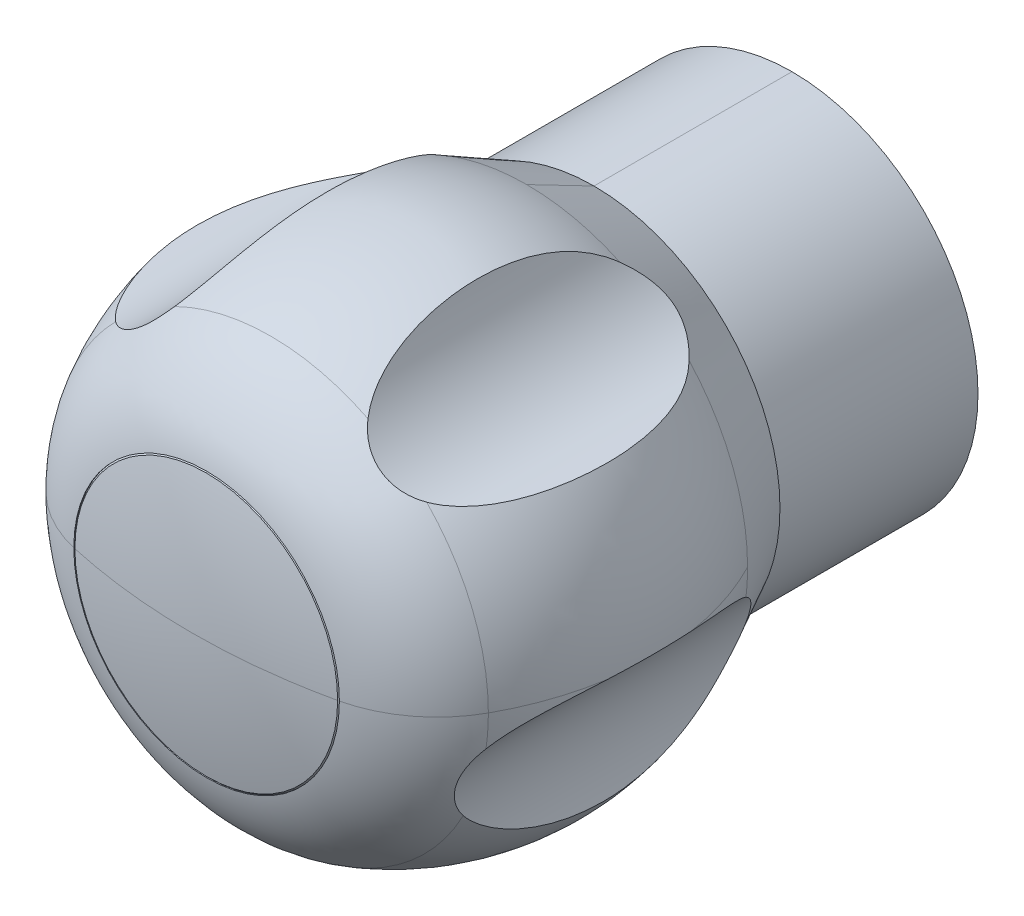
ISO-10303-21;
HEADER;
FILE_DESCRIPTION(('STEP AP214'),'2;1');
FILE_NAME('part.step','',(''),(''),'','','');
FILE_SCHEMA(('AUTOMOTIVE_DESIGN { 1 0 10303 214 1 1 1 1 }'));
ENDSEC;
DATA;
#1=APPLICATION_CONTEXT('core data for automotive mechanical design processes');
#2=APPLICATION_PROTOCOL_DEFINITION('international standard','automotive_design',2000,#1);
#3=PRODUCT_CONTEXT('',#1,'mechanical');
#4=PRODUCT('Part','Part','',(#3));
#5=PRODUCT_RELATED_PRODUCT_CATEGORY('part','',(#4));
#6=PRODUCT_DEFINITION_FORMATION('','',#4);
#7=PRODUCT_DEFINITION_CONTEXT('part definition',#1,'design');
#8=PRODUCT_DEFINITION('design','',#6,#7);
#9=PRODUCT_DEFINITION_SHAPE('','',#8);
#10=(LENGTH_UNIT() NAMED_UNIT(*) SI_UNIT(.MILLI.,.METRE.));
#11=(NAMED_UNIT(*) PLANE_ANGLE_UNIT() SI_UNIT($,.RADIAN.));
#12=(NAMED_UNIT(*) SI_UNIT($,.STERADIAN.) SOLID_ANGLE_UNIT());
#13=UNCERTAINTY_MEASURE_WITH_UNIT(LENGTH_MEASURE(1.E-05),#10,'distance_accuracy_value','');
#14=(GEOMETRIC_REPRESENTATION_CONTEXT(3) GLOBAL_UNCERTAINTY_ASSIGNED_CONTEXT((#13)) GLOBAL_UNIT_ASSIGNED_CONTEXT((#10,
#11,#12)) REPRESENTATION_CONTEXT('',''));
#15=CARTESIAN_POINT('',(0.,0.,0.));
#16=DIRECTION('',(0.,0.,1.));
#17=DIRECTION('',(1.,0.,0.));
#18=AXIS2_PLACEMENT_3D('',#15,#16,#17);
#19=CARTESIAN_POINT('',(0.,0.,-0.499999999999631));
#20=DIRECTION('',(0.,0.,1.));
#21=DIRECTION('',(0.,1.,0.));
#22=AXIS2_PLACEMENT_3D('',#19,#20,#21);
#23=SPHERICAL_SURFACE('',#22,60.5);
#24=CARTESIAN_POINT('',(0.,0.,58.5716338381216));
#25=DIRECTION('',(0.,0.,-1.));
#26=DIRECTION('',(0.,1.,0.));
#27=AXIS2_PLACEMENT_3D('',#24,#25,#26);
#28=CIRCLE('',#27,13.068744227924);
#29=CARTESIAN_POINT('',(0.,-13.068744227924,58.5716338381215));
#30=VERTEX_POINT('',#29);
#31=CARTESIAN_POINT('',(-13.0687442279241,-5.9981704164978E-11,58.5716338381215));
#32=VERTEX_POINT('',#31);
#33=EDGE_CURVE('E421',#30,#32,#28,.T.);
#34=ORIENTED_EDGE('',*,*,#33,.F.);
#35=CARTESIAN_POINT('',(0.,0.,58.5716338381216));
#36=DIRECTION('',(0.,0.,-1.));
#37=DIRECTION('',(0.,1.,0.));
#38=AXIS2_PLACEMENT_3D('',#35,#36,#37);
#39=CIRCLE('',#38,13.068744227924);
#40=CARTESIAN_POINT('',(13.068744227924,-2.99962703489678E-11,58.5716338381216));
#41=VERTEX_POINT('',#40);
#42=EDGE_CURVE('E220',#41,#30,#39,.T.);
#43=ORIENTED_EDGE('',*,*,#42,.F.);
#44=CARTESIAN_POINT('',(0.,0.,60.0000000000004));
#45=CARTESIAN_POINT('',(0.548857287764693,-5.03823967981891E-12,60.0000019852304));
#46=CARTESIAN_POINT('',(1.09771448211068,-1.00764785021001E-11,59.9925312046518));
#47=CARTESIAN_POINT('',(2.1950223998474,-2.01492249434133E-11,59.9626583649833));
#48=CARTESIAN_POINT('',(2.74347312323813,-2.51837325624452E-11,59.9402563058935));
#49=CARTESIAN_POINT('',(3.83956181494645,-3.52452871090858E-11,59.8805351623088));
#50=CARTESIAN_POINT('',(4.38719978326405,-4.02723340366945E-11,59.8432160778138));
#51=CARTESIAN_POINT('',(5.48125736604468,-5.03152440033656E-11,59.7536891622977));
#52=CARTESIAN_POINT('',(6.0276769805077,-5.5331107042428E-11,59.7014813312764));
#53=CARTESIAN_POINT('',(7.11889312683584,-6.5347934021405E-11,59.5822153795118));
#54=CARTESIAN_POINT('',(7.66368965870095,-7.03488979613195E-11,59.5151572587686));
#55=CARTESIAN_POINT('',(8.75125615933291,-8.03322229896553E-11,59.3662406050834));
#56=CARTESIAN_POINT('',(9.29402612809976,-8.53145840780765E-11,59.2843820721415));
#57=CARTESIAN_POINT('',(10.3771373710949,-9.52570120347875E-11,59.1059245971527));
#58=CARTESIAN_POINT('',(10.9174786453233,-1.00217078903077E-10,59.0093256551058));
#59=CARTESIAN_POINT('',(11.9953327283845,-1.1011124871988E-10,58.8014612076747));
#60=CARTESIAN_POINT('',(12.5328455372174,-1.15045351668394E-10,58.6901957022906));
#61=CARTESIAN_POINT('',(13.0687442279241,-1.19964637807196E-10,58.5716338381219));
#62=B_SPLINE_CURVE_WITH_KNOTS('',3,(#44,#45,#46,#47,#48,#49,#50,#51,#52,#53,#54,#55,#56,#57,#58,
#59,#60,#61),.UNSPECIFIED.,.F.,.F.,(4,2,2,2,2,2,2,2,4),(0.,1.64652088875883,3.29304177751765,
4.93956266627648,6.5860835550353,8.23260444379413,9.87912533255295,11.5256462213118,
13.1721671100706),.UNSPECIFIED.);
#63=CARTESIAN_POINT('',(0.,0.,60.));
#64=VERTEX_POINT('',#63);
#65=EDGE_CURVE('E211',#64,#41,#62,.T.);
#66=ORIENTED_EDGE('',*,*,#65,.F.);
#67=CARTESIAN_POINT('',(0.,0.,-0.499999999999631));
#68=DIRECTION('',(9.17859660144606E-12,-1.,0.));
#69=DIRECTION('',(0.,0.,1.));
#70=AXIS2_PLACEMENT_3D('',#67,#68,#69);
#71=CIRCLE('',#70,60.5);
#72=EDGE_CURVE('E218',#32,#64,#71,.F.);
#73=ORIENTED_EDGE('',*,*,#72,.F.);
#74=EDGE_LOOP('',(#34,#43,#66,#73));
#75=FACE_BOUND('',#74,.T.);
#76=ADVANCED_FACE('F14',(#75),#23,.T.);
#77=CARTESIAN_POINT('',(0.,0.,-0.499999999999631));
#78=DIRECTION('',(0.,0.,1.));
#79=DIRECTION('',(0.,1.,0.));
#80=AXIS2_PLACEMENT_3D('',#77,#78,#79);
#81=SPHERICAL_SURFACE('',#80,60.5);
#82=CARTESIAN_POINT('',(0.,0.,58.5716338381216));
#83=DIRECTION('',(0.,0.,-1.));
#84=DIRECTION('',(0.,1.,0.));
#85=AXIS2_PLACEMENT_3D('',#82,#83,#84);
#86=CIRCLE('',#85,13.068744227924);
#87=CARTESIAN_POINT('',(0.,13.068744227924,58.5716338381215));
#88=VERTEX_POINT('',#87);
#89=EDGE_CURVE('E441',#88,#41,#86,.T.);
#90=ORIENTED_EDGE('',*,*,#89,.F.);
#91=CARTESIAN_POINT('',(0.,0.,58.5716338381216));
#92=DIRECTION('',(0.,0.,-1.));
#93=DIRECTION('',(0.,1.,0.));
#94=AXIS2_PLACEMENT_3D('',#91,#92,#93);
#95=CIRCLE('',#94,13.068744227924);
#96=EDGE_CURVE('E227',#32,#88,#95,.T.);
#97=ORIENTED_EDGE('',*,*,#96,.F.);
#98=ORIENTED_EDGE('',*,*,#72,.T.);
#99=ORIENTED_EDGE('',*,*,#65,.T.);
#100=EDGE_LOOP('',(#90,#97,#98,#99));
#101=FACE_BOUND('',#100,.T.);
#102=ADVANCED_FACE('F225',(#101),#81,.T.);
#103=CARTESIAN_POINT('',(0.,0.,58.4302124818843));
#104=DIRECTION('',(0.,0.,-1.));
#105=DIRECTION('',(-1.,0.,0.));
#106=AXIS2_PLACEMENT_3D('',#103,#104,#105);
#107=CONICAL_SURFACE('',#106,13.2101655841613,0.785398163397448);
#108=DIRECTION('',(0.,0.707106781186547,0.707106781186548));
#109=VECTOR('',#108,1.);
#110=CARTESIAN_POINT('',(0.,-13.1394549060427,58.5009231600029));
#111=LINE('',#110,#109);
#112=CARTESIAN_POINT('',(0.,-13.2101655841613,58.4302124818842));
#113=VERTEX_POINT('',#112);
#114=EDGE_CURVE('E418',#113,#30,#111,.T.);
#115=ORIENTED_EDGE('',*,*,#114,.F.);
#116=CARTESIAN_POINT('',(0.,0.,58.4302124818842));
#117=DIRECTION('',(0.,0.,1.));
#118=DIRECTION('',(1.,0.,0.));
#119=AXIS2_PLACEMENT_3D('',#116,#117,#118);
#120=CIRCLE('',#119,13.2101655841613);
#121=CARTESIAN_POINT('',(0.,13.2101655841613,58.4302124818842));
#122=VERTEX_POINT('',#121);
#123=EDGE_CURVE('E410',#113,#122,#120,.T.);
#124=ORIENTED_EDGE('',*,*,#123,.T.);
#125=DIRECTION('',(0.,-0.707106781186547,0.707106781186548));
#126=VECTOR('',#125,1.);
#127=CARTESIAN_POINT('',(0.,13.1394549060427,58.5009231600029));
#128=LINE('',#127,#126);
#129=EDGE_CURVE('E415',#88,#122,#128,.F.);
#130=ORIENTED_EDGE('',*,*,#129,.F.);
#131=ORIENTED_EDGE('',*,*,#89,.T.);
#132=ORIENTED_EDGE('',*,*,#42,.T.);
#133=EDGE_LOOP('',(#115,#124,#130,#131,#132));
#134=FACE_BOUND('',#133,.T.);
#135=ADVANCED_FACE('F429',(#134),#107,.T.);
#136=CARTESIAN_POINT('',(0.,0.,58.4302124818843));
#137=DIRECTION('',(0.,0.,-1.));
#138=DIRECTION('',(-1.,0.,0.));
#139=AXIS2_PLACEMENT_3D('',#136,#137,#138);
#140=CONICAL_SURFACE('',#139,13.2101655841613,0.785398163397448);
#141=ORIENTED_EDGE('',*,*,#33,.T.);
#142=ORIENTED_EDGE('',*,*,#96,.T.);
#143=ORIENTED_EDGE('',*,*,#129,.T.);
#144=CARTESIAN_POINT('',(0.,0.,58.4302124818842));
#145=DIRECTION('',(0.,0.,1.));
#146=DIRECTION('',(1.,0.,0.));
#147=AXIS2_PLACEMENT_3D('',#144,#145,#146);
#148=CIRCLE('',#147,13.2101655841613);
#149=EDGE_CURVE('E412',#122,#113,#148,.T.);
#150=ORIENTED_EDGE('',*,*,#149,.T.);
#151=ORIENTED_EDGE('',*,*,#114,.T.);
#152=EDGE_LOOP('',(#141,#142,#143,#150,#151));
#153=FACE_BOUND('',#152,.T.);
#154=ADVANCED_FACE('F882',(#153),#140,.T.);
#155=CARTESIAN_POINT('',(0.,0.,58.4848652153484));
#156=DIRECTION('',(0.,0.,1.));
#157=DIRECTION('',(1.,0.,0.));
#158=AXIS2_PLACEMENT_3D('',#155,#156,#157);
#159=CYLINDRICAL_SURFACE('',#158,13.2101655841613);
#160=ORIENTED_EDGE('',*,*,#123,.F.);
#161=DIRECTION('',(0.,0.,1.));
#162=VECTOR('',#161,1.);
#163=CARTESIAN_POINT('',(0.,-13.2101655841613,58.4848652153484));
#164=LINE('',#163,#162);
#165=CARTESIAN_POINT('',(0.,-13.2101655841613,58.5395179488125));
#166=VERTEX_POINT('',#165);
#167=EDGE_CURVE('E173',#113,#166,#164,.T.);
#168=ORIENTED_EDGE('',*,*,#167,.T.);
#169=CARTESIAN_POINT('',(0.,0.,58.5395179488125));
#170=DIRECTION('',(0.,0.,-1.));
#171=DIRECTION('',(-1.,0.,0.));
#172=AXIS2_PLACEMENT_3D('',#169,#170,#171);
#173=CIRCLE('',#172,13.2101655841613);
#174=CARTESIAN_POINT('',(13.2101655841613,0.,58.5395179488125));
#175=VERTEX_POINT('',#174);
#176=EDGE_CURVE('E390',#175,#166,#173,.T.);
#177=ORIENTED_EDGE('',*,*,#176,.F.);
#178=CARTESIAN_POINT('',(0.,0.,58.5395179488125));
#179=DIRECTION('',(0.,0.,-1.));
#180=DIRECTION('',(-1.,0.,0.));
#181=AXIS2_PLACEMENT_3D('',#178,#179,#180);
#182=CIRCLE('',#181,13.2101655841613);
#183=CARTESIAN_POINT('',(0.,13.2101655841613,58.5395179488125));
#184=VERTEX_POINT('',#183);
#185=EDGE_CURVE('E392',#184,#175,#182,.T.);
#186=ORIENTED_EDGE('',*,*,#185,.F.);
#187=DIRECTION('',(0.,0.,1.));
#188=VECTOR('',#187,1.);
#189=CARTESIAN_POINT('',(0.,13.2101655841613,58.4848652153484));
#190=LINE('',#189,#188);
#191=EDGE_CURVE('E404',#184,#122,#190,.F.);
#192=ORIENTED_EDGE('',*,*,#191,.T.);
#193=EDGE_LOOP('',(#160,#168,#177,#186,#192));
#194=FACE_BOUND('',#193,.T.);
#195=ADVANCED_FACE('F874',(#194),#159,.F.);
#196=CARTESIAN_POINT('',(0.,0.,58.4848652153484));
#197=DIRECTION('',(0.,0.,1.));
#198=DIRECTION('',(1.,0.,0.));
#199=AXIS2_PLACEMENT_3D('',#196,#197,#198);
#200=CYLINDRICAL_SURFACE('',#199,13.2101655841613);
#201=CARTESIAN_POINT('',(0.,0.,58.5395179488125));
#202=DIRECTION('',(0.,0.,-1.));
#203=DIRECTION('',(-1.,0.,0.));
#204=AXIS2_PLACEMENT_3D('',#201,#202,#203);
#205=CIRCLE('',#204,13.2101655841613);
#206=CARTESIAN_POINT('',(-13.2101655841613,0.,58.5395179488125));
#207=VERTEX_POINT('',#206);
#208=EDGE_CURVE('E395',#207,#184,#205,.T.);
#209=ORIENTED_EDGE('',*,*,#208,.F.);
#210=CARTESIAN_POINT('',(0.,0.,58.5395179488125));
#211=DIRECTION('',(0.,0.,-1.));
#212=DIRECTION('',(-1.,0.,0.));
#213=AXIS2_PLACEMENT_3D('',#210,#211,#212);
#214=CIRCLE('',#213,13.2101655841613);
#215=EDGE_CURVE('E398',#166,#207,#214,.T.);
#216=ORIENTED_EDGE('',*,*,#215,.F.);
#217=ORIENTED_EDGE('',*,*,#167,.F.);
#218=ORIENTED_EDGE('',*,*,#149,.F.);
#219=ORIENTED_EDGE('',*,*,#191,.F.);
#220=EDGE_LOOP('',(#209,#216,#217,#218,#219));
#221=FACE_BOUND('',#220,.T.);
#222=ADVANCED_FACE('F867',(#221),#200,.F.);
#223=CARTESIAN_POINT('',(2.,0.,39.12));
#224=DIRECTION('',(0.,1.,0.));
#225=DIRECTION('',(-1.,0.,0.));
#226=AXIS2_PLACEMENT_3D('',#223,#224,#225);
#227=CIRCLE('',#226,27.);
#228=TRIMMED_CURVE('',#227,(PARAMETER_VALUE(-1.49665434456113)),
(PARAMETER_VALUE(1.49665434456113)),.T.,.PARAMETER.);
#229=CARTESIAN_POINT('',(0.,0.,39.12));
#230=DIRECTION('',(0.,0.,-1.));
#231=AXIS1_PLACEMENT('',#229,#230);
#232=SURFACE_OF_REVOLUTION('',#228,#231);
#233=CARTESIAN_POINT('',(-24.4817349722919,0.,44.3847614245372));
#234=CARTESIAN_POINT('',(-24.4400037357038,-0.029552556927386,44.5946738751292));
#235=CARTESIAN_POINT('',(-24.3957791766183,-0.0612374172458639,44.8037990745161));
#236=CARTESIAN_POINT('',(-24.3021998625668,-0.129334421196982,45.2210940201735));
#237=CARTESIAN_POINT('',(-24.252823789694,-0.165766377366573,45.4292557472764));
#238=CARTESIAN_POINT('',(-24.1490113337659,-0.243681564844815,45.8440160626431));
#239=CARTESIAN_POINT('',(-24.0945609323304,-0.28517889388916,46.0506085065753));
#240=CARTESIAN_POINT('',(-23.9807066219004,-0.373591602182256,46.461617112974));
#241=CARTESIAN_POINT('',(-23.921295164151,-0.420515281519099,46.6660294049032));
#242=CARTESIAN_POINT('',(-23.797655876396,-0.520181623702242,47.0720679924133));
#243=CARTESIAN_POINT('',(-23.7334259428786,-0.572926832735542,47.2736930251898));
#244=CARTESIAN_POINT('',(-23.6030305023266,-0.682403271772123,47.6653886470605));
#245=CARTESIAN_POINT('',(-23.5370539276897,-0.738880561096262,47.8555929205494));
#246=CARTESIAN_POINT('',(-23.4009810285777,-0.858048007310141,48.2323524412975));
#247=CARTESIAN_POINT('',(-23.3308883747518,-0.920732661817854,48.418910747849));
#248=CARTESIAN_POINT('',(-23.1867626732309,-1.05281939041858,48.7878300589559));
#249=CARTESIAN_POINT('',(-23.1127341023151,-1.12221390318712,48.9701955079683));
#250=CARTESIAN_POINT('',(-22.9609317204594,-1.26829775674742,49.3301548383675));
#251=CARTESIAN_POINT('',(-22.8831617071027,-1.34497977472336,49.5077532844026));
#252=CARTESIAN_POINT('',(-22.7240724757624,-1.50632136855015,49.8575882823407));
#253=CARTESIAN_POINT('',(-22.6427546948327,-1.59097773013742,50.0298269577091));
#254=CARTESIAN_POINT('',(-22.5158209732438,-1.72718267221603,50.2886707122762));
#255=CARTESIAN_POINT('',(-22.4713732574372,-1.77560844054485,50.3775041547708));
#256=CARTESIAN_POINT('',(-22.3816155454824,-1.87502055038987,50.5532834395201));
#257=CARTESIAN_POINT('',(-22.3363055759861,-1.92600681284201,50.6402293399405));
#258=CARTESIAN_POINT('',(-22.2448970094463,-2.03064183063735,50.8120477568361));
#259=CARTESIAN_POINT('',(-22.1987986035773,-2.08428994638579,50.8969207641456));
#260=CARTESIAN_POINT('',(-22.1058883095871,-2.19436088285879,51.0644070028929));
#261=CARTESIAN_POINT('',(-22.0590766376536,-2.25078287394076,51.1470208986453));
#262=CARTESIAN_POINT('',(-21.9639864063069,-2.36754419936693,51.3112325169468));
#263=CARTESIAN_POINT('',(-21.915696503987,-2.42793471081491,51.3927873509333));
#264=CARTESIAN_POINT('',(-21.8185417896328,-2.55185887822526,51.5531504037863));
#265=CARTESIAN_POINT('',(-21.7696768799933,-2.61539307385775,51.6319581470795));
#266=CARTESIAN_POINT('',(-21.6714581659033,-2.74576322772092,51.7866078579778));
#267=CARTESIAN_POINT('',(-21.6221040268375,-2.81260159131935,51.8624475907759));
#268=CARTESIAN_POINT('',(-21.5230007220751,-2.9497548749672,52.0109198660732));
#269=CARTESIAN_POINT('',(-21.4732510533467,-3.02007514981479,52.083547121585));
#270=CARTESIAN_POINT('',(-21.4234114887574,-3.09213952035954,52.154357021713));
#271=B_SPLINE_CURVE_WITH_KNOTS('',3,(#233,#234,#235,#236,#237,#238,#239,#240,#241,#242,#243,
#244,#245,#246,#247,#248,#249,#250,#251,#252,#253,#254,#255,#256,#257,#258,#259,#260,#261,#262,
#263,#264,#265,#266,#267,#268,#269,#270),.UNSPECIFIED.,.F.,.F.,(4,2,2,2,2,2,2,2,2,2,2,2,2,2,2,2,
2,2,4),(0.,0.648139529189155,1.29907639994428,1.95186810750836,2.6056718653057,3.2597627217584,
3.88689053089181,4.51346732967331,5.13934609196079,5.76460246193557,6.38960787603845,
6.72109117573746,7.05256424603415,7.38395805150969,7.71525333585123,8.05232974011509,
8.38946421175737,8.72684783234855,9.06476748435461),.UNSPECIFIED.);
#272=CARTESIAN_POINT('',(-24.4817349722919,0.,44.3847614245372));
#273=VERTEX_POINT('',#272);
#274=CARTESIAN_POINT('',(-21.4234114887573,-3.09213952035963,52.154357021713));
#275=VERTEX_POINT('',#274);
#276=EDGE_CURVE('E164',#273,#275,#271,.T.);
#277=ORIENTED_EDGE('',*,*,#276,.T.);
#278=CARTESIAN_POINT('',(0.,0.,52.1543570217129));
#279=DIRECTION('',(0.,0.,-1.));
#280=DIRECTION('',(-1.,0.,0.));
#281=AXIS2_PLACEMENT_3D('',#278,#279,#280);
#282=CIRCLE('',#281,21.6454126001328);
#283=CARTESIAN_POINT('',(-21.6454126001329,0.,52.154357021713));
#284=VERTEX_POINT('',#283);
#285=EDGE_CURVE('E401',#284,#275,#282,.F.);
#286=ORIENTED_EDGE('',*,*,#285,.F.);
#287=CARTESIAN_POINT('',(2.,0.,39.12));
#288=DIRECTION('',(0.,1.,0.));
#289=DIRECTION('',(-1.,0.,0.));
#290=AXIS2_PLACEMENT_3D('',#287,#288,#289);
#291=CIRCLE('',#290,27.);
#292=EDGE_CURVE('E659',#273,#284,#291,.T.);
#293=ORIENTED_EDGE('',*,*,#292,.F.);
#294=EDGE_LOOP('',(#277,#286,#293));
#295=FACE_BOUND('',#294,.T.);
#296=ADVANCED_FACE('F373',(#295),#232,.F.);
#297=CARTESIAN_POINT('',(-10.2605843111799,0.,45.8785554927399));
#298=DIRECTION('',(0.,1.,0.));
#299=DIRECTION('',(-1.,0.,0.));
#300=AXIS2_PLACEMENT_3D('',#297,#298,#299);
#301=CIRCLE('',#300,13.);
#302=TRIMMED_CURVE('',#301,(PARAMETER_VALUE(-2.4804248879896)),
(PARAMETER_VALUE(2.4804248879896)),.T.,.PARAMETER.);
#303=CARTESIAN_POINT('',(0.,0.,45.8785554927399));
#304=DIRECTION('',(0.,0.,-1.));
#305=AXIS1_PLACEMENT('',#303,#304);
#306=SURFACE_OF_REVOLUTION('',#302,#305);
#307=CARTESIAN_POINT('',(-9.56099766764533,19.4193514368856,52.1543570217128));
#308=CARTESIAN_POINT('',(-9.63389189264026,19.3237676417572,52.251527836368));
#309=CARTESIAN_POINT('',(-9.7103478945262,19.2263967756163,52.3443214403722));
#310=CARTESIAN_POINT('',(-9.87044612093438,19.0289394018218,52.5204601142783));
#311=CARTESIAN_POINT('',(-9.9540919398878,18.9288515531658,52.6038004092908));
#312=CARTESIAN_POINT('',(-10.128754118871,18.7266910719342,52.760413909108));
#313=CARTESIAN_POINT('',(-10.2197865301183,18.6246145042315,52.8336642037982));
#314=CARTESIAN_POINT('',(-10.4088873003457,18.4197264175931,52.9691935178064));
#315=CARTESIAN_POINT('',(-10.5069544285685,18.3169150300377,53.0314744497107));
#316=CARTESIAN_POINT('',(-10.7101848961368,18.1112362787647,53.1446860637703));
#317=CARTESIAN_POINT('',(-10.8153715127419,18.0083699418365,53.1955769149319));
#318=CARTESIAN_POINT('',(-11.0320598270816,17.8040137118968,53.2852401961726));
#319=CARTESIAN_POINT('',(-11.1435613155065,17.7025237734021,53.3240130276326));
#320=CARTESIAN_POINT('',(-11.3720796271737,17.5021069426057,53.3890184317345));
#321=CARTESIAN_POINT('',(-11.4890882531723,17.4031765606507,53.4152690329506));
#322=CARTESIAN_POINT('',(-11.727978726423,17.2087078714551,53.4550569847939));
#323=CARTESIAN_POINT('',(-11.8498602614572,17.113169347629,53.4685951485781));
#324=CARTESIAN_POINT('',(-12.0910734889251,16.9312652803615,53.4824572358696));
#325=CARTESIAN_POINT('',(-12.2102034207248,16.844681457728,53.4834372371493));
#326=CARTESIAN_POINT('',(-12.451137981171,16.6759906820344,53.4738618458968));
#327=CARTESIAN_POINT('',(-12.5729425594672,16.5938836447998,53.4633066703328));
#328=CARTESIAN_POINT('',(-12.818331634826,16.4346456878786,53.4307457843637));
#329=CARTESIAN_POINT('',(-12.9419168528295,16.3575168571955,53.4087353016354));
#330=CARTESIAN_POINT('',(-13.1898238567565,16.2086803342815,53.3534531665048));
#331=CARTESIAN_POINT('',(-13.3141456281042,16.1369725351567,53.3201817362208));
#332=CARTESIAN_POINT('',(-13.5607644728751,16.0002234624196,53.2432150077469));
#333=CARTESIAN_POINT('',(-13.6830653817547,15.9351024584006,53.1996732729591));
#334=CARTESIAN_POINT('',(-13.9264477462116,15.8105314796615,53.1022925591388));
#335=CARTESIAN_POINT('',(-14.0475291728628,15.751081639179,53.0484533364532));
#336=CARTESIAN_POINT('',(-14.2874880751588,15.6379001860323,52.9309569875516));
#337=CARTESIAN_POINT('',(-14.4063665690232,15.5841658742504,52.8673045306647));
#338=CARTESIAN_POINT('',(-14.6410872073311,15.4823035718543,52.7307008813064));
#339=CARTESIAN_POINT('',(-14.7569302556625,15.4341738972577,52.6577524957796));
#340=CARTESIAN_POINT('',(-14.9668946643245,15.3504659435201,52.5152911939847));
#341=CARTESIAN_POINT('',(-15.0615666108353,15.3141041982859,52.4470427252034));
#342=CARTESIAN_POINT('',(-15.2476007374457,15.2451315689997,52.3048798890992));
#343=CARTESIAN_POINT('',(-15.3389701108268,15.2125121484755,52.2309790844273));
#344=CARTESIAN_POINT('',(-15.4286041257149,15.1816356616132,52.1543570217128));
#345=B_SPLINE_CURVE_WITH_KNOTS('',3,(#307,#308,#309,#310,#311,#312,#313,#314,#315,#316,#317,
#318,#319,#320,#321,#322,#323,#324,#325,#326,#327,#328,#329,#330,#331,#332,#333,#334,#335,#336,
#337,#338,#339,#340,#341,#342,#343,#344),.UNSPECIFIED.,.F.,.F.,(4,2,2,2,2,2,2,2,2,2,2,2,2,2,2,2,
2,2,4),(0.,0.463648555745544,0.92753026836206,1.39244848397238,1.85728555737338,
2.32372360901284,2.79014620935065,3.25589524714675,3.72161449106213,4.16289750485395,
4.60417221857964,5.04563091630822,5.48708090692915,5.92230753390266,6.35754446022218,
6.79257492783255,7.22747434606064,7.59396712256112,7.95960654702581),.UNSPECIFIED.);
#346=CARTESIAN_POINT('',(-9.56099766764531,19.4193514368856,52.1543570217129));
#347=VERTEX_POINT('',#346);
#348=CARTESIAN_POINT('',(-15.4286041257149,15.1816356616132,52.1543570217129));
#349=VERTEX_POINT('',#348);
#350=EDGE_CURVE('E742',#347,#349,#345,.T.);
#351=ORIENTED_EDGE('',*,*,#350,.T.);
#352=CARTESIAN_POINT('',(0.,0.,52.154357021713));
#353=DIRECTION('',(0.,0.,-1.));
#354=DIRECTION('',(-1.,0.,0.));
#355=AXIS2_PLACEMENT_3D('',#352,#353,#354);
#356=CIRCLE('',#355,21.6454126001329);
#357=EDGE_CURVE('E662',#284,#349,#356,.T.);
#358=ORIENTED_EDGE('',*,*,#357,.F.);
#359=CARTESIAN_POINT('',(-10.2605843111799,0.,45.8785554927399));
#360=DIRECTION('',(0.,1.,0.));
#361=DIRECTION('',(-1.,0.,0.));
#362=AXIS2_PLACEMENT_3D('',#359,#360,#361);
#363=CIRCLE('',#362,13.);
#364=EDGE_CURVE('E394',#207,#284,#363,.F.);
#365=ORIENTED_EDGE('',*,*,#364,.F.);
#366=ORIENTED_EDGE('',*,*,#208,.T.);
#367=ORIENTED_EDGE('',*,*,#185,.T.);
#368=CARTESIAN_POINT('',(10.2605843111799,0.,45.8785554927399));
#369=DIRECTION('',(0.,-1.,0.));
#370=DIRECTION('',(1.,0.,0.));
#371=AXIS2_PLACEMENT_3D('',#368,#369,#370);
#372=CIRCLE('',#371,13.);
#373=CARTESIAN_POINT('',(21.6454126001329,0.,52.154357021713));
#374=VERTEX_POINT('',#373);
#375=EDGE_CURVE('E387',#374,#175,#372,.T.);
#376=ORIENTED_EDGE('',*,*,#375,.F.);
#377=CARTESIAN_POINT('',(0.,0.,52.154357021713));
#378=DIRECTION('',(0.,0.,-1.));
#379=DIRECTION('',(-1.,0.,0.));
#380=AXIS2_PLACEMENT_3D('',#377,#378,#379);
#381=CIRCLE('',#380,21.6454126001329);
#382=CARTESIAN_POINT('',(15.5143899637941,15.093958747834,52.1543570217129));
#383=VERTEX_POINT('',#382);
#384=EDGE_CURVE('E762',#383,#374,#381,.T.);
#385=ORIENTED_EDGE('',*,*,#384,.F.);
#386=CARTESIAN_POINT('',(15.5143899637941,15.093958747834,52.1543570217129));
#387=CARTESIAN_POINT('',(15.4009588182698,15.1337482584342,52.251527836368));
#388=CARTESIAN_POINT('',(15.2847274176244,15.1763729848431,52.3443214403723));
#389=CARTESIAN_POINT('',(15.0474612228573,15.2676177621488,52.5204601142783));
#390=CARTESIAN_POINT('',(14.926424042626,15.3162408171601,52.6038004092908));
#391=CARTESIAN_POINT('',(14.680184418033,15.4198833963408,52.7604139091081));
#392=CARTESIAN_POINT('',(14.554973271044,15.474916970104,52.8336642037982));
#393=CARTESIAN_POINT('',(14.3016777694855,15.591448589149,52.9691935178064));
#394=CARTESIAN_POINT('',(14.1735939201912,15.6529455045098,53.0314744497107));
#395=CARTESIAN_POINT('',(13.9151801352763,15.7826709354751,53.1446860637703));
#396=CARTESIAN_POINT('',(13.7848439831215,15.8509219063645,53.1955769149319));
#397=CARTESIAN_POINT('',(13.5235292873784,15.9938551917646,53.2852401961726));
#398=CARTESIAN_POINT('',(13.3925507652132,16.0685372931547,53.3240130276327));
#399=CARTESIAN_POINT('',(13.131326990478,16.2239389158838,53.3890184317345));
#400=CARTESIAN_POINT('',(13.0010809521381,16.3046495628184,53.4152690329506));
#401=CARTESIAN_POINT('',(12.7423090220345,16.471753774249,53.455056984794));
#402=CARTESIAN_POINT('',(12.6137830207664,16.5581469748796,53.4685951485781));
#403=CARTESIAN_POINT('',(12.3662429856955,16.7313429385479,53.4824572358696));
#404=CARTESIAN_POINT('',(12.2470837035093,16.8178863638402,53.4834372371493));
#405=CARTESIAN_POINT('',(12.0121963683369,16.9949004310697,53.4738618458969));
#406=CARTESIAN_POINT('',(11.896468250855,17.0853709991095,53.4633066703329));
#407=CARTESIAN_POINT('',(11.6691945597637,17.2695426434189,53.4307457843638));
#408=CARTESIAN_POINT('',(11.5576507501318,17.3632450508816,53.4087353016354));
#409=CARTESIAN_POINT('',(11.3394913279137,17.5530256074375,53.3534531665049));
#410=CARTESIAN_POINT('',(11.2328756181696,17.6491037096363,53.3201817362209));
#411=CARTESIAN_POINT('',(11.0266101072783,17.841394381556,53.243215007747));
#412=CARTESIAN_POINT('',(10.9268832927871,17.9375859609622,53.1996732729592));
#413=CARTESIAN_POINT('',(10.7331999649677,18.1305617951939,53.1022925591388));
#414=CARTESIAN_POINT('',(10.6392435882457,18.2273460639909,53.0484533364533));
#415=CARTESIAN_POINT('',(10.4574502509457,18.4205855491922,52.9309569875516));
#416=CARTESIAN_POINT('',(10.3696104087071,18.5170408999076,52.8673045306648));
#417=CARTESIAN_POINT('',(10.2002009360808,18.7087963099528,52.7307008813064));
#418=CARTESIAN_POINT('',(10.1186294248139,18.8040967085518,52.6577524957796));
#419=CARTESIAN_POINT('',(9.97413585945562,18.9779175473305,52.5152911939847));
#420=CARTESIAN_POINT('',(9.91029854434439,19.0567195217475,52.4470427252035));
#421=CARTESIAN_POINT('',(9.78721396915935,19.2123347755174,52.3048798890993));
#422=CARTESIAN_POINT('',(9.72795636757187,19.2891522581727,52.2309790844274));
#423=CARTESIAN_POINT('',(9.6708926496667,19.3648579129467,52.1543570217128));
#424=B_SPLINE_CURVE_WITH_KNOTS('',3,(#386,#387,#388,#389,#390,#391,#392,#393,#394,#395,#396,
#397,#398,#399,#400,#401,#402,#403,#404,#405,#406,#407,#408,#409,#410,#411,#412,#413,#414,#415,
#416,#417,#418,#419,#420,#421,#422,#423),.UNSPECIFIED.,.F.,.F.,(4,2,2,2,2,2,2,2,2,2,2,2,2,2,2,2,
2,2,4),(0.,0.463648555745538,0.927530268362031,1.39244848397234,1.85728555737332,
2.3237236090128,2.79014620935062,3.25589524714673,3.72161449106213,4.16289750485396,
4.60417221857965,5.04563091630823,5.48708090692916,5.92230753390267,6.3575444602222,
6.79257492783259,7.22747434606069,7.5939671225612,7.95960654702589),.UNSPECIFIED.);
#425=CARTESIAN_POINT('',(9.67089264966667,19.3648579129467,52.1543570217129));
#426=VERTEX_POINT('',#425);
#427=EDGE_CURVE('E351',#383,#426,#424,.T.);
#428=ORIENTED_EDGE('',*,*,#427,.T.);
#429=CARTESIAN_POINT('',(0.,0.,52.154357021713));
#430=DIRECTION('',(0.,0.,-1.));
#431=DIRECTION('',(-1.,0.,0.));
#432=AXIS2_PLACEMENT_3D('',#429,#430,#431);
#433=CIRCLE('',#432,21.6454126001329);
#434=EDGE_CURVE('E358',#347,#426,#433,.T.);
#435=ORIENTED_EDGE('',*,*,#434,.F.);
#436=EDGE_LOOP('',(#351,#358,#365,#366,#367,#376,#385,#428,#435));
#437=FACE_BOUND('',#436,.T.);
#438=ADVANCED_FACE('F366',(#437),#306,.F.);
#439=CARTESIAN_POINT('',(2.,0.,39.12));
#440=DIRECTION('',(0.,1.,0.));
#441=DIRECTION('',(-1.,0.,0.));
#442=AXIS2_PLACEMENT_3D('',#439,#440,#441);
#443=CIRCLE('',#442,27.);
#444=TRIMMED_CURVE('',#443,(PARAMETER_VALUE(-1.49665434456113)),
(PARAMETER_VALUE(1.49665434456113)),.T.,.PARAMETER.);
#445=CARTESIAN_POINT('',(0.,0.,39.12));
#446=DIRECTION('',(0.,0.,-1.));
#447=AXIS1_PLACEMENT('',#445,#446);
#448=SURFACE_OF_REVOLUTION('',#444,#447);
#449=CARTESIAN_POINT('',(0.,0.,52.154357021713));
#450=DIRECTION('',(0.,0.,-1.));
#451=DIRECTION('',(-1.,0.,0.));
#452=AXIS2_PLACEMENT_3D('',#449,#450,#451);
#453=CIRCLE('',#452,21.6454126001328);
#454=CARTESIAN_POINT('',(21.4055444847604,-3.21349528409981,52.1543570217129));
#455=VERTEX_POINT('',#454);
#456=EDGE_CURVE('E391',#455,#374,#453,.F.);
#457=ORIENTED_EDGE('',*,*,#456,.F.);
#458=CARTESIAN_POINT('',(21.4055444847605,-3.21349528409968,52.154357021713));
#459=CARTESIAN_POINT('',(21.4821786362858,-3.10403098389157,52.0463597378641));
#460=CARTESIAN_POINT('',(21.5585603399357,-2.99863182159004,51.9341684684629));
#461=CARTESIAN_POINT('',(21.7100645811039,-2.79596733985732,51.7028673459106));
#462=CARTESIAN_POINT('',(21.785191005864,-2.69867034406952,51.5837878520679));
#463=CARTESIAN_POINT('',(21.933933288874,-2.51148979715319,51.3394962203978));
#464=CARTESIAN_POINT('',(22.0075516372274,-2.42159313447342,51.2142955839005));
#465=CARTESIAN_POINT('',(22.1530624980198,-2.24861008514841,50.9584090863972));
#466=CARTESIAN_POINT('',(22.2249556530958,-2.16552113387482,50.8277253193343));
#467=CARTESIAN_POINT('',(22.3650680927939,-2.00760574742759,50.5647215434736));
#468=CARTESIAN_POINT('',(22.4333341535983,-1.93262860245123,50.4325165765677));
#469=CARTESIAN_POINT('',(22.5678429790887,-1.78826507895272,50.16393768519));
#470=CARTESIAN_POINT('',(22.6340841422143,-1.71888305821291,50.0275606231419));
#471=CARTESIAN_POINT('',(22.7643627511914,-1.58536111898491,49.7511188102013));
#472=CARTESIAN_POINT('',(22.8283988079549,-1.52122447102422,49.6110518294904));
#473=CARTESIAN_POINT('',(22.954095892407,-1.39788449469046,49.3276989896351));
#474=CARTESIAN_POINT('',(23.0157566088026,-1.33868181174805,49.184412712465));
#475=CARTESIAN_POINT('',(23.1494004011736,-1.21282128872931,48.8642842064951));
#476=CARTESIAN_POINT('',(23.220798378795,-1.14724616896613,48.6867716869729));
#477=CARTESIAN_POINT('',(23.3597515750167,-1.02235910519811,48.3281258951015));
#478=CARTESIAN_POINT('',(23.4273074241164,-0.963046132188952,48.1469932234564));
#479=CARTESIAN_POINT('',(23.5584775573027,-0.850175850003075,47.7814822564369));
#480=CARTESIAN_POINT('',(23.6220907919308,-0.796620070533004,47.5971031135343));
#481=CARTESIAN_POINT('',(23.7452765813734,-0.694829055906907,47.2254585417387));
#482=CARTESIAN_POINT('',(23.8048473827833,-0.646596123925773,47.0381919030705));
#483=CARTESIAN_POINT('',(23.9198543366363,-0.555072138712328,46.6611165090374));
#484=CARTESIAN_POINT('',(23.9752888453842,-0.511783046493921,46.4713067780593));
#485=CARTESIAN_POINT('',(24.0839985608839,-0.428229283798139,46.0820959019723));
#486=CARTESIAN_POINT('',(24.1371060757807,-0.388147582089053,45.8826087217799));
#487=CARTESIAN_POINT('',(24.2386798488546,-0.312628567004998,45.481619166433));
#488=CARTESIAN_POINT('',(24.2871467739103,-0.277190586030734,45.2801170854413));
#489=CARTESIAN_POINT('',(24.3793626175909,-0.210671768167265,44.8754700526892));
#490=CARTESIAN_POINT('',(24.4231146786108,-0.179588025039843,44.6723262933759));
#491=CARTESIAN_POINT('',(24.5058384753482,-0.121520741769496,44.2647686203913));
#492=CARTESIAN_POINT('',(24.5448163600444,-0.0945319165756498,44.0603567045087));
#493=CARTESIAN_POINT('',(24.617948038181,-0.0444348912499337,43.6506305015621));
#494=CARTESIAN_POINT('',(24.6521114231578,-0.0213189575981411,43.445318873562));
#495=CARTESIAN_POINT('',(24.6838914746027,0.,43.2394581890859));
#496=B_SPLINE_CURVE_WITH_KNOTS('',3,(#458,#459,#460,#461,#462,#463,#464,#465,#466,#467,#468,
#469,#470,#471,#472,#473,#474,#475,#476,#477,#478,#479,#480,#481,#482,#483,#484,#485,#486,#487,
#488,#489,#490,#491,#492,#493,#494,#495),.UNSPECIFIED.,.F.,.F.,(4,2,2,2,2,2,2,2,2,2,2,2,2,2,2,2,
2,2,4),(0.,0.51523408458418,1.02834866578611,1.54053363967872,2.05252476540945,2.55219588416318,
3.05225248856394,3.55261854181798,4.05304994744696,4.65964107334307,5.26613236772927,
5.87278441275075,6.47969793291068,7.08685136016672,7.71760531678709,8.34826849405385,
8.97850870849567,9.60792846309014,10.2360759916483),.UNSPECIFIED.);
#497=CARTESIAN_POINT('',(24.6838914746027,0.,43.2394581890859));
#498=VERTEX_POINT('',#497);
#499=EDGE_CURVE('E550',#455,#498,#496,.T.);
#500=ORIENTED_EDGE('',*,*,#499,.T.);
#501=CARTESIAN_POINT('',(-2.,0.,39.12));
#502=DIRECTION('',(0.,-1.,0.));
#503=DIRECTION('',(1.,0.,0.));
#504=AXIS2_PLACEMENT_3D('',#501,#502,#503);
#505=CIRCLE('',#504,27.);
#506=EDGE_CURVE('E765',#374,#498,#505,.F.);
#507=ORIENTED_EDGE('',*,*,#506,.F.);
#508=EDGE_LOOP('',(#457,#500,#507));
#509=FACE_BOUND('',#508,.T.);
#510=ADVANCED_FACE('F372',(#509),#448,.F.);
#511=CARTESIAN_POINT('',(-10.2605843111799,0.,45.8785554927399));
#512=DIRECTION('',(0.,1.,0.));
#513=DIRECTION('',(-1.,0.,0.));
#514=AXIS2_PLACEMENT_3D('',#511,#512,#513);
#515=CIRCLE('',#514,13.);
#516=TRIMMED_CURVE('',#515,(PARAMETER_VALUE(-2.4804248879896)),
(PARAMETER_VALUE(2.4804248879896)),.T.,.PARAMETER.);
#517=CARTESIAN_POINT('',(0.,0.,45.8785554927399));
#518=DIRECTION('',(0.,0.,-1.));
#519=AXIS1_PLACEMENT('',#517,#518);
#520=SURFACE_OF_REVOLUTION('',#516,#519);
#521=ORIENTED_EDGE('',*,*,#176,.T.);
#522=ORIENTED_EDGE('',*,*,#215,.T.);
#523=ORIENTED_EDGE('',*,*,#364,.T.);
#524=ORIENTED_EDGE('',*,*,#285,.T.);
#525=CARTESIAN_POINT('',(-21.4234114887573,-3.09213952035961,52.1543570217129));
#526=CARTESIAN_POINT('',(-21.3550314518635,-3.19100306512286,52.251527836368));
#527=CARTESIAN_POINT('',(-21.2860524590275,-3.29380629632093,52.3443214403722));
#528=CARTESIAN_POINT('',(-21.1477324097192,-3.50708644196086,52.5204601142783));
#529=CARTESIAN_POINT('',(-21.078391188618,-3.61756718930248,52.6038004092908));
#530=CARTESIAN_POINT('',(-20.9400987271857,-3.84615181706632,52.760413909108));
#531=CARTESIAN_POINT('',(-20.8711487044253,-3.96427217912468,52.8336642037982));
#532=CARTESIAN_POINT('',(-20.7347239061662,-4.20743159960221,52.9691935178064));
#533=CARTESIAN_POINT('',(-20.6672488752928,-4.33246944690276,53.0314744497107));
#534=CARTESIAN_POINT('',(-20.5344384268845,-4.58931133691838,53.1446860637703));
#535=CARTESIAN_POINT('',(-20.4691111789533,-4.72113720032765,53.1955769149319));
#536=CARTESIAN_POINT('',(-20.3417172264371,-4.99036958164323,53.2852401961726));
#537=CARTESIAN_POINT('',(-20.2796504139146,-5.12777591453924,53.3240130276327));
#538=CARTESIAN_POINT('',(-20.1596587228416,-5.407041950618,53.3890184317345));
#539=CARTESIAN_POINT('',(-20.1017279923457,-5.54889493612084,53.4152690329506));
#540=CARTESIAN_POINT('',(-19.9905984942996,-5.836187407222,53.455056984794));
#541=CARTESIAN_POINT('',(-19.9373994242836,-5.98162666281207,53.4685951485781));
#542=CARTESIAN_POINT('',(-19.8389373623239,-6.26724552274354,53.4824572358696));
#543=CARTESIAN_POINT('',(-19.7934044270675,-6.4073006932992,53.4834372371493));
#544=CARTESIAN_POINT('',(-19.7074228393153,-6.68857139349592,53.4738618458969));
#545=CARTESIAN_POINT('',(-19.6669740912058,-6.8297869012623,53.4633066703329));
#546=CARTESIAN_POINT('',(-19.5913591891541,-7.11237301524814,53.4307457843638));
#547=CARTESIAN_POINT('',(-19.5561952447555,-7.2537436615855,53.4087353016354));
#548=CARTESIAN_POINT('',(-19.4912507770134,-7.53551024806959,53.3534531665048));
#549=CARTESIAN_POINT('',(-19.4614701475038,-7.67590620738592,53.3201817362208));
#550=CARTESIAN_POINT('',(-19.4076234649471,-7.95271245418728,53.2432150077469));
#551=CARTESIAN_POINT('',(-19.3834827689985,-8.08915102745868,53.1996732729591));
#552=CARTESIAN_POINT('',(-19.3402180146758,-8.35911596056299,53.1022925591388));
#553=CARTESIAN_POINT('',(-19.3210940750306,-8.49264225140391,53.0484533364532));
#554=CARTESIAN_POINT('',(-19.2876034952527,-8.75583172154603,52.9309569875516));
#555=CARTESIAN_POINT('',(-19.2732346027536,-8.88549670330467,52.8673045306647));
#556=CARTESIAN_POINT('',(-19.2488904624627,-9.140206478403,52.7307008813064));
#557=CARTESIAN_POINT('',(-19.238913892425,-9.26525265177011,52.6577524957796));
#558=CARTESIAN_POINT('',(-19.2241854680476,-9.49080785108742,52.5152911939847));
#559=CARTESIAN_POINT('',(-19.2188586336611,-9.59208261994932,52.4470427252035));
#560=CARTESIAN_POINT('',(-19.2107494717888,-9.79032530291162,52.3048798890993));
#561=CARTESIAN_POINT('',(-19.2079612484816,-9.88730269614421,52.2309790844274));
#562=CARTESIAN_POINT('',(-19.2062943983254,-9.98209106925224,52.1543570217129));
#563=B_SPLINE_CURVE_WITH_KNOTS('',3,(#525,#526,#527,#528,#529,#530,#531,#532,#533,#534,#535,
#536,#537,#538,#539,#540,#541,#542,#543,#544,#545,#546,#547,#548,#549,#550,#551,#552,#553,#554,
#555,#556,#557,#558,#559,#560,#561,#562),.UNSPECIFIED.,.F.,.F.,(4,2,2,2,2,2,2,2,2,2,2,2,2,2,2,2,
2,2,4),(0.,0.463648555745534,0.927530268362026,1.39244848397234,1.85728555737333,
2.3237236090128,2.79014620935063,3.25589524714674,3.72161449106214,4.16289750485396,
4.60417221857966,5.04563091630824,5.48708090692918,5.92230753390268,6.3575444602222,
6.79257492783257,7.22747434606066,7.59396712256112,7.95960654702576),.UNSPECIFIED.);
#564=CARTESIAN_POINT('',(-19.2062943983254,-9.98209106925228,52.1543570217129));
#565=VERTEX_POINT('',#564);
#566=EDGE_CURVE('E584',#275,#565,#563,.T.);
#567=ORIENTED_EDGE('',*,*,#566,.T.);
#568=CARTESIAN_POINT('',(0.,0.,52.154357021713));
#569=DIRECTION('',(0.,0.,-1.));
#570=DIRECTION('',(-1.,0.,0.));
#571=AXIS2_PLACEMENT_3D('',#568,#569,#570);
#572=CIRCLE('',#571,21.6454126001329);
#573=CARTESIAN_POINT('',(-3.6793987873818,-21.3303987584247,52.154357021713));
#574=VERTEX_POINT('',#573);
#575=EDGE_CURVE('E407',#574,#565,#572,.T.);
#576=ORIENTED_EDGE('',*,*,#575,.F.);
#577=CARTESIAN_POINT('',(-3.67939878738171,-21.3303987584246,52.1543570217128));
#578=CARTESIAN_POINT('',(-3.56424337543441,-21.2959159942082,52.251527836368));
#579=CARTESIAN_POINT('',(-3.44515601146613,-21.262081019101,52.3443214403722));
#580=CARTESIAN_POINT('',(-3.19957129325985,-21.1964380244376,52.5204601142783));
#581=CARTESIAN_POINT('',(-3.07307024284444,-21.1646310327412,52.6038004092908));
#582=CARTESIAN_POINT('',(-2.81293862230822,-21.1037436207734,52.760413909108));
#583=CARTESIAN_POINT('',(-2.67929275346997,-21.0746694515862,52.8336642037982));
#584=CARTESIAN_POINT('',(-2.40587682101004,-21.0200621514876,52.9691935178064));
#585=CARTESIAN_POINT('',(-2.26610783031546,-20.994528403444,53.0314744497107));
#586=CARTESIAN_POINT('',(-1.98079599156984,-20.9475866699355,53.1446860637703));
#587=CARTESIAN_POINT('',(-1.83523491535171,-20.9261931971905,53.1955769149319));
#588=CARTESIAN_POINT('',(-1.53981280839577,-20.888231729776,53.2852401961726));
#589=CARTESIAN_POINT('',(-1.38995192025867,-20.8716635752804,53.3240130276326));
#590=CARTESIAN_POINT('',(-1.0872746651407,-20.8438426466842,53.3890184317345));
#591=CARTESIAN_POINT('',(-0.934462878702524,-20.8325822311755,53.4152690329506));
#592=CARTESIAN_POINT('',(-0.626890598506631,-20.8156700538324,53.4550569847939));
#593=CARTESIAN_POINT('',(-0.47213023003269,-20.8100179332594,53.4685951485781));
#594=CARTESIAN_POINT('',(-0.170064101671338,-20.8046360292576,53.4824572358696));
#595=CARTESIAN_POINT('',(-0.0227932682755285,-20.8046110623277,53.4834372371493));
#596=CARTESIAN_POINT('',(0.271280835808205,-20.8097551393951,53.4738618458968));
#597=CARTESIAN_POINT('',(0.418084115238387,-20.8149240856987,53.4633066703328));
#598=CARTESIAN_POINT('',(0.710205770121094,-20.8303339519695,53.4307457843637));
#599=CARTESIAN_POINT('',(0.855523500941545,-20.8405769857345,53.4087353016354));
#600=CARTESIAN_POINT('',(1.14356839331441,-20.8658817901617,53.3534531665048));
#601=CARTESIAN_POINT('',(1.28629560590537,-20.8809434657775,53.3201817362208));
#602=CARTESIAN_POINT('',(1.56619353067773,-20.9152700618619,53.2432150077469));
#603=CARTESIAN_POINT('',(1.70341421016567,-20.9344727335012,53.1996732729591));
#604=CARTESIAN_POINT('',(1.97353566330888,-20.9767492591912,53.1022925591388));
#605=CARTESIAN_POINT('',(2.10643633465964,-20.99982320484,53.0484533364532));
#606=CARTESIAN_POINT('',(2.36709355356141,-21.0493017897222,52.9309569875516));
#607=CARTESIAN_POINT('',(2.49485251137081,-21.0757048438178,52.8673045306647));
#608=CARTESIAN_POINT('',(2.7446186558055,-21.1312618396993,52.7307008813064));
#609=CARTESIAN_POINT('',(2.86662756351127,-21.1604149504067,52.6577524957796));
#610=CARTESIAN_POINT('',(3.08569463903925,-21.2161077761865,52.5152911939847));
#611=CARTESIAN_POINT('',(3.18365875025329,-21.2423372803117,52.4470427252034));
#612=CARTESIAN_POINT('',(3.37470461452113,-21.2958853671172,52.3048798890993));
#613=CARTESIAN_POINT('',(3.46779720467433,-21.323201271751,52.2309790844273));
#614=CARTESIAN_POINT('',(3.55846138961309,-21.3509072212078,52.1543570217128));
#615=B_SPLINE_CURVE_WITH_KNOTS('',3,(#577,#578,#579,#580,#581,#582,#583,#584,#585,#586,#587,
#588,#589,#590,#591,#592,#593,#594,#595,#596,#597,#598,#599,#600,#601,#602,#603,#604,#605,#606,
#607,#608,#609,#610,#611,#612,#613,#614),.UNSPECIFIED.,.F.,.F.,(4,2,2,2,2,2,2,2,2,2,2,2,2,2,2,2,
2,2,4),(0.,0.463648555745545,0.927530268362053,1.39244848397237,1.85728555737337,
2.32372360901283,2.79014620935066,3.25589524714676,3.72161449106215,4.16289750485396,
4.60417221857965,5.04563091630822,5.48708090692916,5.92230753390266,6.35754446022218,
6.79257492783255,7.22747434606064,7.59396712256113,7.95960654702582),.UNSPECIFIED.);
#616=CARTESIAN_POINT('',(3.55846138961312,-21.3509072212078,52.1543570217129));
#617=VERTEX_POINT('',#616);
#618=EDGE_CURVE('E526',#574,#617,#615,.T.);
#619=ORIENTED_EDGE('',*,*,#618,.T.);
#620=CARTESIAN_POINT('',(0.,0.,52.154357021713));
#621=DIRECTION('',(0.,0.,-1.));
#622=DIRECTION('',(-1.,0.,0.));
#623=AXIS2_PLACEMENT_3D('',#620,#621,#622);
#624=CIRCLE('',#623,21.6454126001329);
#625=CARTESIAN_POINT('',(19.1494179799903,-10.0907719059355,52.1543570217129));
#626=VERTEX_POINT('',#625);
#627=EDGE_CURVE('E492',#626,#617,#624,.T.);
#628=ORIENTED_EDGE('',*,*,#627,.F.);
#629=CARTESIAN_POINT('',(19.1494179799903,-10.0907719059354,52.1543570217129));
#630=CARTESIAN_POINT('',(19.1522079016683,-9.97059684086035,52.251527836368));
#631=CARTESIAN_POINT('',(19.1568289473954,-9.8468824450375,52.3443214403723));
#632=CARTESIAN_POINT('',(19.1702886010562,-9.59303269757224,52.5204601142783));
#633=CARTESIAN_POINT('',(19.1791293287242,-9.46289414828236,52.6038004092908));
#634=CARTESIAN_POINT('',(19.2016070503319,-9.19667903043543,52.760413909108));
#635=CARTESIAN_POINT('',(19.2152547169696,-9.06058984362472,52.8336642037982));
#636=CARTESIAN_POINT('',(19.2478102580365,-8.78368125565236,52.9691935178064));
#637=CARTESIAN_POINT('',(19.2667172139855,-8.64286268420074,53.0314744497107));
#638=CARTESIAN_POINT('',(19.3102391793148,-8.35700920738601,53.1446860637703));
#639=CARTESIAN_POINT('',(19.3348736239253,-8.21196145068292,53.1955769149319));
#640=CARTESIAN_POINT('',(19.3900605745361,-7.91926759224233,53.2852401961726));
#641=CARTESIAN_POINT('',(19.4206128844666,-7.7716215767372,53.3240130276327));
#642=CARTESIAN_POINT('',(19.487686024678,-7.47516126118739,53.3890184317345));
#643=CARTESIAN_POINT('',(19.5241981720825,-7.32634895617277,53.4152690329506));
#644=CARTESIAN_POINT('',(19.6031587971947,-7.0286041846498,53.455056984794));
#645=CARTESIAN_POINT('',(19.6456068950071,-6.87967172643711,53.4685951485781));
#646=CARTESIAN_POINT('',(19.7338319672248,-6.59072666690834,53.4824572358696));
#647=CARTESIAN_POINT('',(19.7793174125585,-6.45065606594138,53.4834372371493));
#648=CARTESIAN_POINT('',(19.8750836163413,-6.1725645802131,53.4738618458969));
#649=CARTESIAN_POINT('',(19.9253642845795,-6.03454365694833,53.4633066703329));
#650=CARTESIAN_POINT('',(20.0302904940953,-5.76148136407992,53.4307457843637));
#651=CARTESIAN_POINT('',(20.0849378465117,-5.62644126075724,53.4087353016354));
#652=CARTESIAN_POINT('',(20.1980149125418,-5.36031390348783,53.3534531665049));
#653=CARTESIAN_POINT('',(20.256444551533,-5.22922657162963,53.3201817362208));
#654=CARTESIAN_POINT('',(20.3755842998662,-4.97363532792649,53.2432150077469));
#655=CARTESIAN_POINT('',(20.4362506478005,-4.84906465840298,53.1996732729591));
#656=CARTESIAN_POINT('',(20.5599301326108,-4.60522805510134,53.1022925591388));
#657=CARTESIAN_POINT('',(20.622943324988,-4.48596224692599,53.0484533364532));
#658=CARTESIAN_POINT('',(20.7505477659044,-4.2533522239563,52.9309569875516));
#659=CARTESIAN_POINT('',(20.8151382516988,-4.14000522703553,52.8673045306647));
#660=CARTESIAN_POINT('',(20.9451580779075,-3.91963156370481,52.7307008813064));
#661=CARTESIAN_POINT('',(21.0105871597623,-3.81260300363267,52.6577524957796));
#662=CARTESIAN_POINT('',(21.1312496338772,-3.62146786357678,52.5152911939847));
#663=CARTESIAN_POINT('',(21.1864679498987,-3.53640381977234,52.4470427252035));
#664=CARTESIAN_POINT('',(21.2964316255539,-3.37125567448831,52.3048798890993));
#665=CARTESIAN_POINT('',(21.3511777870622,-3.29116043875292,52.2309790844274));
#666=CARTESIAN_POINT('',(21.4055444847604,-3.21349528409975,52.1543570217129));
#667=B_SPLINE_CURVE_WITH_KNOTS('',3,(#629,#630,#631,#632,#633,#634,#635,#636,#637,#638,#639,
#640,#641,#642,#643,#644,#645,#646,#647,#648,#649,#650,#651,#652,#653,#654,#655,#656,#657,#658,
#659,#660,#661,#662,#663,#664,#665,#666),.UNSPECIFIED.,.F.,.F.,(4,2,2,2,2,2,2,2,2,2,2,2,2,2,2,2,
2,2,4),(0.,0.463648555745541,0.927530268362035,1.39244848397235,1.85728555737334,
2.32372360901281,2.79014620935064,3.25589524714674,3.72161449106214,4.16289750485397,
4.60417221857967,5.04563091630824,5.48708090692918,5.92230753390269,6.35754446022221,
6.79257492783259,7.22747434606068,7.59396712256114,7.95960654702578),.UNSPECIFIED.);
#668=EDGE_CURVE('E556',#626,#455,#667,.T.);
#669=ORIENTED_EDGE('',*,*,#668,.T.);
#670=ORIENTED_EDGE('',*,*,#456,.T.);
#671=ORIENTED_EDGE('',*,*,#375,.T.);
#672=EDGE_LOOP('',(#521,#522,#523,#524,#567,#576,#619,#628,#669,#670,#671));
#673=FACE_BOUND('',#672,.T.);
#674=ADVANCED_FACE('F567',(#673),#520,.F.);
#675=CARTESIAN_POINT('',(2.,0.,39.12));
#676=DIRECTION('',(0.,1.,0.));
#677=DIRECTION('',(-1.,0.,0.));
#678=AXIS2_PLACEMENT_3D('',#675,#676,#677);
#679=CIRCLE('',#678,27.);
#680=TRIMMED_CURVE('',#679,(PARAMETER_VALUE(-1.49665434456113)),
(PARAMETER_VALUE(1.49665434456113)),.T.,.PARAMETER.);
#681=CARTESIAN_POINT('',(0.,0.,39.12));
#682=DIRECTION('',(0.,0.,-1.));
#683=AXIS1_PLACEMENT('',#681,#682);
#684=SURFACE_OF_REVOLUTION('',#680,#683);
#685=CARTESIAN_POINT('',(0.,0.,26.6921745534));
#686=DIRECTION('',(0.,0.,1.));
#687=DIRECTION('',(0.,1.,0.));
#688=AXIS2_PLACEMENT_3D('',#685,#686,#687);
#689=CIRCLE('',#688,21.9697549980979);
#690=CARTESIAN_POINT('',(-4.31940637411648,-21.5409578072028,26.6921745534));
#691=VERTEX_POINT('',#690);
#692=CARTESIAN_POINT('',(-19.212592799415,-10.655815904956,26.6921745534));
#693=VERTEX_POINT('',#692);
#694=EDGE_CURVE('E676',#691,#693,#689,.F.);
#695=ORIENTED_EDGE('',*,*,#694,.F.);
#696=CARTESIAN_POINT('',(-4.31940637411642,-21.5409578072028,26.6921745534));
#697=CARTESIAN_POINT('',(-4.4043912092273,-21.5714818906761,26.7821243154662));
#698=CARTESIAN_POINT('',(-4.48732109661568,-21.6023021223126,26.8738806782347));
#699=CARTESIAN_POINT('',(-4.64919539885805,-21.6643480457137,27.0606740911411));
#700=CARTESIAN_POINT('',(-4.72814075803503,-21.6955736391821,27.1557103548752));
#701=CARTESIAN_POINT('',(-4.9586411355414,-21.789354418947,27.4445484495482));
#702=CARTESIAN_POINT('',(-5.10452494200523,-21.8522559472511,27.6427903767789));
#703=CARTESIAN_POINT('',(-5.38200898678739,-21.9776927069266,28.0487629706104));
#704=CARTESIAN_POINT('',(-5.51362240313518,-22.0402282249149,28.2564846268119));
#705=CARTESIAN_POINT('',(-5.76262409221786,-22.1634577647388,28.6779738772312));
#706=CARTESIAN_POINT('',(-5.88013488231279,-22.2241635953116,28.89166592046));
#707=CARTESIAN_POINT('',(-6.10341694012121,-22.3436378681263,29.3258636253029));
#708=CARTESIAN_POINT('',(-6.20917722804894,-22.4024044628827,29.5463754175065));
#709=CARTESIAN_POINT('',(-6.40974874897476,-22.5173451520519,29.9930811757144));
#710=CARTESIAN_POINT('',(-6.50455511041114,-22.5735180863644,30.2192776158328));
#711=CARTESIAN_POINT('',(-6.72107527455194,-22.7053243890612,30.7709959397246));
#712=CARTESIAN_POINT('',(-6.83769557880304,-22.779395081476,31.0988970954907));
#713=CARTESIAN_POINT('',(-7.05243026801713,-22.9200965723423,31.7622021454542));
#714=CARTESIAN_POINT('',(-7.1505449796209,-22.9867275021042,32.0976059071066));
#715=CARTESIAN_POINT('',(-7.32987058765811,-23.1116714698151,32.7744623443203));
#716=CARTESIAN_POINT('',(-7.41107901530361,-23.1699832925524,33.1159158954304));
#717=CARTESIAN_POINT('',(-7.55821254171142,-23.2778381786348,33.8052091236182));
#718=CARTESIAN_POINT('',(-7.62406219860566,-23.3273376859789,34.1530716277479));
#719=CARTESIAN_POINT('',(-7.74100254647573,-23.4166703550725,34.8524215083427));
#720=CARTESIAN_POINT('',(-7.79209601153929,-23.456505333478,35.2039081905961));
#721=CARTESIAN_POINT('',(-7.88032025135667,-23.526103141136,35.9094862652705));
#722=CARTESIAN_POINT('',(-7.91745550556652,-23.5558692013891,36.263576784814));
#723=CARTESIAN_POINT('',(-7.9836401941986,-23.6093149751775,37.0351158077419));
#724=CARTESIAN_POINT('',(-8.01017697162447,-23.6310490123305,37.4529209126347));
#725=CARTESIAN_POINT('',(-8.03655485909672,-23.6527166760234,38.0792235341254));
#726=CARTESIAN_POINT('',(-8.04310984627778,-23.6581170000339,38.2872875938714));
#727=CARTESIAN_POINT('',(-8.05184281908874,-23.6653203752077,38.7035637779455));
#728=CARTESIAN_POINT('',(-8.05402093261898,-23.6671235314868,38.911775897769));
#729=CARTESIAN_POINT('',(-8.0540243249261,-23.6671226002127,39.12));
#730=B_SPLINE_CURVE_WITH_KNOTS('',3,(#696,#697,#698,#699,#700,#701,#702,#703,#704,#705,#706,
#707,#708,#709,#710,#711,#712,#713,#714,#715,#716,#717,#718,#719,#720,#721,#722,#723,#724,#725,
#726,#727,#728,#729),.UNSPECIFIED.,.F.,.F.,(4,2,2,2,2,2,2,2,2,2,2,2,2,2,2,2,4),(0.,
0.382298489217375,0.764505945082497,1.52592099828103,2.28662682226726,3.04015413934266,
3.79437974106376,4.54893949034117,5.61564914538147,6.68233997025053,7.74918645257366,
8.82116780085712,9.89294749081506,10.96438293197,12.2212989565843,12.8459461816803,
13.4705751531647),.UNSPECIFIED.);
#731=CARTESIAN_POINT('',(-8.0540243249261,-23.6671226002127,39.12));
#732=VERTEX_POINT('',#731);
#733=EDGE_CURVE('E686',#691,#732,#730,.T.);
#734=ORIENTED_EDGE('',*,*,#733,.T.);
#735=CARTESIAN_POINT('',(-8.0540243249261,-23.6671226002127,39.12));
#736=CARTESIAN_POINT('',(-8.05401415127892,-23.6671276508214,39.3814510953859));
#737=CARTESIAN_POINT('',(-8.05058400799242,-23.6642819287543,39.6429036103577));
#738=CARTESIAN_POINT('',(-8.03680567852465,-23.6529206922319,40.1657037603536));
#739=CARTESIAN_POINT('',(-8.02645218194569,-23.644400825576,40.4270511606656));
#740=CARTESIAN_POINT('',(-7.99874254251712,-23.6217180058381,40.9492493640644));
#741=CARTESIAN_POINT('',(-7.98138322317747,-23.6075524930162,41.2100998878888));
#742=CARTESIAN_POINT('',(-7.9395120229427,-23.5736483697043,41.7309098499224));
#743=CARTESIAN_POINT('',(-7.91499890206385,-23.5539087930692,41.9908691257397));
#744=CARTESIAN_POINT('',(-7.85813899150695,-23.5085758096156,42.5139352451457));
#745=CARTESIAN_POINT('',(-7.82566584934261,-23.4828883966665,42.7770202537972));
#746=CARTESIAN_POINT('',(-7.75284057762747,-23.4260015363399,43.3014519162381));
#747=CARTESIAN_POINT('',(-7.71248987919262,-23.3948030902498,43.5627988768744));
#748=CARTESIAN_POINT('',(-7.6235666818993,-23.3270786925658,44.0833343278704));
#749=CARTESIAN_POINT('',(-7.57499612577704,-23.290554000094,44.3425233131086));
#750=CARTESIAN_POINT('',(-7.46921061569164,-23.21239959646,44.8583166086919));
#751=CARTESIAN_POINT('',(-7.4119970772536,-23.1707707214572,45.1149213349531));
#752=CARTESIAN_POINT('',(-7.29354774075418,-23.0863337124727,45.6038935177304));
#753=CARTESIAN_POINT('',(-7.23304065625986,-23.0439106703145,45.8365039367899));
#754=CARTESIAN_POINT('',(-7.10388036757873,-22.9552515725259,46.2986990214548));
#755=CARTESIAN_POINT('',(-7.03522796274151,-22.9090158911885,46.528283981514));
#756=CARTESIAN_POINT('',(-6.88925242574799,-22.8130260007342,46.9839413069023));
#757=CARTESIAN_POINT('',(-6.81192934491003,-22.7632718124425,47.2100136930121));
#758=CARTESIAN_POINT('',(-6.64871738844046,-22.6610366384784,47.656145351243));
#759=CARTESIAN_POINT('',(-6.56290713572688,-22.6085825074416,47.8762394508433));
#760=CARTESIAN_POINT('',(-6.38152298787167,-22.5009742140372,48.31171737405));
#761=CARTESIAN_POINT('',(-6.28594868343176,-22.445819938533,48.5271009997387));
#762=CARTESIAN_POINT('',(-6.08428484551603,-22.3332948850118,48.9523754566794));
#763=CARTESIAN_POINT('',(-5.9781932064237,-22.2759236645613,49.1622651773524));
#764=CARTESIAN_POINT('',(-5.77290259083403,-22.1690516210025,49.5418451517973));
#765=CARTESIAN_POINT('',(-5.67539372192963,-22.1197902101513,49.7125165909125));
#766=CARTESIAN_POINT('',(-5.47196859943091,-22.0205806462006,50.0485027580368));
#767=CARTESIAN_POINT('',(-5.36605520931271,-21.9706327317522,50.2138192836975));
#768=CARTESIAN_POINT('',(-5.14534214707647,-21.8705715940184,50.5381701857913));
#769=CARTESIAN_POINT('',(-5.03054978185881,-21.8204585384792,50.697209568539));
#770=CARTESIAN_POINT('',(-4.7898711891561,-21.7199574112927,51.0101766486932));
#771=CARTESIAN_POINT('',(-4.66385836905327,-21.6695744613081,51.1640089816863));
#772=CARTESIAN_POINT('',(-4.40138832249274,-21.5698824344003,51.4631714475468));
#773=CARTESIAN_POINT('',(-4.26492226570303,-21.5205743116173,51.6084942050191));
#774=CARTESIAN_POINT('',(-3.98068758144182,-21.423813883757,51.8893521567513));
#775=CARTESIAN_POINT('',(-3.83288148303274,-21.376368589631,52.0248517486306));
#776=CARTESIAN_POINT('',(-3.67939878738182,-21.3303987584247,52.154357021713));
#777=B_SPLINE_CURVE_WITH_KNOTS('',3,(#735,#736,#737,#738,#739,#740,#741,#742,#743,#744,#745,
#746,#747,#748,#749,#750,#751,#752,#753,#754,#755,#756,#757,#758,#759,#760,#761,#762,#763,#764,
#765,#766,#767,#768,#769,#770,#771,#772,#773,#774,#775,#776),.UNSPECIFIED.,.F.,.F.,(4,2,2,2,2,2,
2,2,2,2,2,2,2,2,2,2,2,2,2,2,4),(0.,0.784317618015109,1.56923751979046,2.3545137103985,
3.13992609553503,3.93872016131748,4.73736924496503,5.53582983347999,6.33415979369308,
7.06618574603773,7.79813991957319,8.53008976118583,9.25580121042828,9.98154309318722,
10.7074305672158,11.3151331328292,11.922629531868,12.529631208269,13.1446569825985,
13.7602081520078,14.3778889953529),.UNSPECIFIED.);
#778=EDGE_CURVE('E683',#732,#574,#777,.T.);
#779=ORIENTED_EDGE('',*,*,#778,.T.);
#780=ORIENTED_EDGE('',*,*,#575,.T.);
#781=CARTESIAN_POINT('',(-19.2062943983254,-9.98209106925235,52.154357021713));
#782=CARTESIAN_POINT('',(-19.203205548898,-10.1591956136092,52.0111692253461));
#783=CARTESIAN_POINT('',(-19.2039304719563,-10.3302216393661,51.8606855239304));
#784=CARTESIAN_POINT('',(-19.2116434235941,-10.6596530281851,51.5479752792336));
#785=CARTESIAN_POINT('',(-19.2186041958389,-10.8181100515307,51.385802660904));
#786=CARTESIAN_POINT('',(-19.2374109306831,-11.1233120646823,51.051459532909));
#787=CARTESIAN_POINT('',(-19.2492516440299,-11.2700694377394,50.8792999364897));
#788=CARTESIAN_POINT('',(-19.2765126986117,-11.5505752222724,50.5288764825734));
#789=CARTESIAN_POINT('',(-19.2918815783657,-11.6844747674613,50.3507291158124));
#790=CARTESIAN_POINT('',(-19.3253684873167,-11.942121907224,49.9872342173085));
#791=CARTESIAN_POINT('',(-19.3434893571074,-12.0658588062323,49.801879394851));
#792=CARTESIAN_POINT('',(-19.3816753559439,-12.3035710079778,49.4251071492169));
#793=CARTESIAN_POINT('',(-19.4017414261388,-12.4175415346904,49.2336868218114));
#794=CARTESIAN_POINT('',(-19.4515144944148,-12.6805181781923,48.7669664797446));
#795=CARTESIAN_POINT('',(-19.481828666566,-12.8249672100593,48.4891581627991));
#796=CARTESIAN_POINT('',(-19.5432949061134,-13.0966089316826,47.9253991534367));
#797=CARTESIAN_POINT('',(-19.574446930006,-13.2238025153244,47.6394488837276));
#798=CARTESIAN_POINT('',(-19.6362959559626,-13.4620571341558,47.0608511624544));
#799=CARTESIAN_POINT('',(-19.6669929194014,-13.5731168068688,46.7682031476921));
#800=CARTESIAN_POINT('',(-19.7271434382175,-13.7809919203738,46.1747261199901));
#801=CARTESIAN_POINT('',(-19.7565829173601,-13.8776665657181,45.8738465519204));
#802=CARTESIAN_POINT('',(-19.8130231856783,-14.0563544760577,45.2676000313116));
#803=CARTESIAN_POINT('',(-19.8400243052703,-14.1383697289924,44.9622336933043));
#804=CARTESIAN_POINT('',(-19.8908727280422,-14.2884445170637,44.347863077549));
#805=CARTESIAN_POINT('',(-19.9147202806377,-14.3565051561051,44.0388590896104));
#806=CARTESIAN_POINT('',(-19.9547050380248,-14.468113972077,43.4742558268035));
#807=CARTESIAN_POINT('',(-19.9714562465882,-14.513869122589,43.2191324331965));
#808=CARTESIAN_POINT('',(-20.0022127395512,-14.5966584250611,42.7073361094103));
#809=CARTESIAN_POINT('',(-20.0162183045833,-14.6336934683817,42.4506633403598));
#810=CARTESIAN_POINT('',(-20.0412850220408,-14.6992507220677,41.936096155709));
#811=CARTESIAN_POINT('',(-20.0523462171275,-14.7277730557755,41.678201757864));
#812=CARTESIAN_POINT('',(-20.0712389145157,-14.7761146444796,41.1651789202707));
#813=CARTESIAN_POINT('',(-20.0791140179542,-14.7960516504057,40.9100631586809));
#814=CARTESIAN_POINT('',(-20.0917526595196,-14.8279105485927,40.3992576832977));
#815=CARTESIAN_POINT('',(-20.0965162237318,-14.8398325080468,40.1435679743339));
#816=CARTESIAN_POINT('',(-20.1028797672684,-14.85571471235,39.6319183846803));
#817=CARTESIAN_POINT('',(-20.104479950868,-14.8596754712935,39.3759585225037));
#818=CARTESIAN_POINT('',(-20.1044726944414,-14.8596829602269,39.12));
#819=B_SPLINE_CURVE_WITH_KNOTS('',3,(#781,#782,#783,#784,#785,#786,#787,#788,#789,#790,#791,
#792,#793,#794,#795,#796,#797,#798,#799,#800,#801,#802,#803,#804,#805,#806,#807,#808,#809,#810,
#811,#812,#813,#814,#815,#816,#817,#818),.UNSPECIFIED.,.F.,.F.,(4,2,2,2,2,2,2,2,2,2,2,2,2,2,2,2,
2,2,4),(0.,0.682797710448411,1.36262545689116,2.04172382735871,2.71148408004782,
3.38194041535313,4.05272277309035,4.99578547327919,5.93879930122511,6.88189271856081,
7.83368276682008,8.78534364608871,9.73692921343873,10.515971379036,11.2949338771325,
12.0738850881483,12.8417832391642,13.609674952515,14.377517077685),.UNSPECIFIED.);
#820=CARTESIAN_POINT('',(-20.1044726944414,-14.8596829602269,39.12));
#821=VERTEX_POINT('',#820);
#822=EDGE_CURVE('E594',#565,#821,#819,.T.);
#823=ORIENTED_EDGE('',*,*,#822,.T.);
#824=CARTESIAN_POINT('',(-20.1044726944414,-14.8596829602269,39.12));
#825=CARTESIAN_POINT('',(-20.1044805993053,-14.8596747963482,38.8585181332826));
#826=CARTESIAN_POINT('',(-20.1028102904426,-14.8555415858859,38.5970348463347));
#827=CARTESIAN_POINT('',(-20.0961672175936,-14.8389602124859,38.0741715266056));
#828=CARTESIAN_POINT('',(-20.0911918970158,-14.8265056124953,37.8127917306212));
#829=CARTESIAN_POINT('',(-20.0779899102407,-14.7932088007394,37.2905278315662));
#830=CARTESIAN_POINT('',(-20.0697617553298,-14.772362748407,37.0296440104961));
#831=CARTESIAN_POINT('',(-20.0501663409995,-14.7221613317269,36.5087672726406));
#832=CARTESIAN_POINT('',(-20.0387985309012,-14.6928044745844,36.2487745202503));
#833=CARTESIAN_POINT('',(-20.0128663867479,-14.6248554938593,35.725706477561));
#834=CARTESIAN_POINT('',(-19.9982515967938,-14.5861166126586,35.4626527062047));
#835=CARTESIAN_POINT('',(-19.9661632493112,-14.4994604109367,34.9382840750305));
#836=CARTESIAN_POINT('',(-19.948690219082,-14.4515447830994,34.6769689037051));
#837=CARTESIAN_POINT('',(-19.9111652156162,-14.3462647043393,34.1564977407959));
#838=CARTESIAN_POINT('',(-19.89111386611,-14.288902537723,33.897341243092));
#839=CARTESIAN_POINT('',(-19.8487727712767,-14.1643950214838,33.3816156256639));
#840=CARTESIAN_POINT('',(-19.8264834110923,-14.0972513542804,33.1250460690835));
#841=CARTESIAN_POINT('',(-19.7805086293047,-13.9541261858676,32.6197243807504));
#842=CARTESIAN_POINT('',(-19.7568571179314,-13.8783334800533,32.3709157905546));
#843=CARTESIAN_POINT('',(-19.7082565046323,-13.716500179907,31.8767835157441));
#844=CARTESIAN_POINT('',(-19.6833074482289,-13.6304599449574,31.6314597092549));
#845=CARTESIAN_POINT('',(-19.6326566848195,-13.4476089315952,31.1448750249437));
#846=CARTESIAN_POINT('',(-19.6069548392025,-13.3507961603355,30.9036149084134));
#847=CARTESIAN_POINT('',(-19.5556594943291,-13.1466519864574,30.4278433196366));
#848=CARTESIAN_POINT('',(-19.5300667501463,-13.0394100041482,30.1932935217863));
#849=CARTESIAN_POINT('',(-19.4795467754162,-12.8131664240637,29.7298883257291));
#850=CARTESIAN_POINT('',(-19.4546194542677,-12.6941664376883,29.5010321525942));
#851=CARTESIAN_POINT('',(-19.4063287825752,-12.4437405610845,29.0501184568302));
#852=CARTESIAN_POINT('',(-19.3829648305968,-12.3123194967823,28.8280583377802));
#853=CARTESIAN_POINT('',(-19.3493340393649,-12.1018209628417,28.4955302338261));
#854=CARTESIAN_POINT('',(-19.3381144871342,-12.0275076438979,28.382124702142));
#855=CARTESIAN_POINT('',(-19.3165814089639,-11.8751434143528,28.1577918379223));
#856=CARTESIAN_POINT('',(-19.3062676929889,-11.7970932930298,28.0468639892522));
#857=CARTESIAN_POINT('',(-19.2867397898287,-11.6371563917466,27.827755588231));
#858=CARTESIAN_POINT('',(-19.2775252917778,-11.555270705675,27.7195742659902));
#859=CARTESIAN_POINT('',(-19.2603509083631,-11.3870059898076,27.5055474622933));
#860=CARTESIAN_POINT('',(-19.2523992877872,-11.3006019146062,27.3997209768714));
#861=CARTESIAN_POINT('',(-19.2380540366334,-11.123647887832,27.1914185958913));
#862=CARTESIAN_POINT('',(-19.2316608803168,-11.0330966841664,27.0889437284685));
#863=CARTESIAN_POINT('',(-19.2206928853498,-10.8476892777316,26.8876702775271));
#864=CARTESIAN_POINT('',(-19.2161199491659,-10.7528286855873,26.7888756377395));
#865=CARTESIAN_POINT('',(-19.212592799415,-10.655815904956,26.6921745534));
#866=B_SPLINE_CURVE_WITH_KNOTS('',3,(#824,#825,#826,#827,#828,#829,#830,#831,#832,#833,#834,
#835,#836,#837,#838,#839,#840,#841,#842,#843,#844,#845,#846,#847,#848,#849,#850,#851,#852,#853,
#854,#855,#856,#857,#858,#859,#860,#861,#862,#863,#864,#865),.UNSPECIFIED.,.F.,.F.,(4,2,2,2,2,2,
2,2,2,2,2,2,2,2,2,2,2,2,2,2,4),(0.,0.784409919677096,1.56942732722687,2.35480442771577,
3.14031936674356,3.93902056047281,4.73757457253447,5.53593576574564,6.33415980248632,
7.11745364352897,7.9007200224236,8.68413154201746,9.46133584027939,10.2384337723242,
11.0152310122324,11.4233124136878,11.831307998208,12.2391879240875,12.6496360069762,
13.0602088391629,13.471209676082),.UNSPECIFIED.);
#867=EDGE_CURVE('E596',#821,#693,#866,.T.);
#868=ORIENTED_EDGE('',*,*,#867,.T.);
#869=EDGE_LOOP('',(#695,#734,#779,#780,#823,#868));
#870=FACE_BOUND('',#869,.T.);
#871=ADVANCED_FACE('F572',(#870),#684,.F.);
#872=CARTESIAN_POINT('',(-31.7043573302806,-10.2021432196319,0.));
#873=DIRECTION('',(0.,0.,-1.));
#874=DIRECTION('',(-1.,0.,0.));
#875=AXIS2_PLACEMENT_3D('',#872,#873,#874);
#876=CYLINDRICAL_SURFACE('',#875,12.5);
#877=CARTESIAN_POINT('',(-24.4817349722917,-1.34004471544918E-13,33.8552385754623));
#878=CARTESIAN_POINT('',(-24.5160685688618,0.0243030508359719,34.0279348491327));
#879=CARTESIAN_POINT('',(-24.5487159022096,0.047158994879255,34.2011674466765));
#880=CARTESIAN_POINT('',(-24.6105453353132,0.0900510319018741,34.5481747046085));
#881=CARTESIAN_POINT('',(-24.6397353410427,0.110093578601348,34.721947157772));
#882=CARTESIAN_POINT('',(-24.6946709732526,0.147513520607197,35.0700139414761));
#883=CARTESIAN_POINT('',(-24.7204223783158,0.164895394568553,35.244306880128));
#884=CARTESIAN_POINT('',(-24.7684962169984,0.197119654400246,35.5934002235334));
#885=CARTESIAN_POINT('',(-24.7908224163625,0.211964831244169,35.7681998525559));
#886=CARTESIAN_POINT('',(-24.8320550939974,0.239220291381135,36.118294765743));
#887=CARTESIAN_POINT('',(-24.850963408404,0.251631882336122,36.2935897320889));
#888=CARTESIAN_POINT('',(-24.8853622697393,0.27410268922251,36.6446485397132));
#889=CARTESIAN_POINT('',(-24.9008531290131,0.284162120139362,36.8204123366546));
#890=CARTESIAN_POINT('',(-24.9284184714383,0.301995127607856,37.1724287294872));
#891=CARTESIAN_POINT('',(-24.9404909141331,0.309767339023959,37.3486815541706));
#892=CARTESIAN_POINT('',(-24.9612121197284,0.323071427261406,37.7016751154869));
#893=CARTESIAN_POINT('',(-24.9698569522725,0.328600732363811,37.8784161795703));
#894=CARTESIAN_POINT('',(-24.9837099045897,0.337447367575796,38.2323862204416));
#895=CARTESIAN_POINT('',(-24.9889122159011,0.340760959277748,38.4096155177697));
#896=CARTESIAN_POINT('',(-24.9958620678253,0.34518315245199,38.7645631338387));
#897=CARTESIAN_POINT('',(-24.9976019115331,0.346286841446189,38.9422816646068));
#898=CARTESIAN_POINT('',(-24.9976015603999,0.346289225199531,39.12));
#899=B_SPLINE_CURVE_WITH_KNOTS('',3,(#877,#878,#879,#880,#881,#882,#883,#884,#885,#886,#887,
#888,#889,#890,#891,#892,#893,#894,#895,#896,#897,#898),.UNSPECIFIED.,.F.,.F.,(4,2,2,2,2,2,2,2,
2,2,4),(0.,0.533217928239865,1.0651919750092,1.59626047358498,2.12674085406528,2.65693540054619,
3.18708146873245,3.71754331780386,4.24861168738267,4.78057384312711,5.31371721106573),.UNSPECIFIED.);
#900=CARTESIAN_POINT('',(-24.4817349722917,-1.19946775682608E-13,33.8552385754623));
#901=VERTEX_POINT('',#900);
#902=CARTESIAN_POINT('',(-24.9976015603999,0.346289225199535,39.12));
#903=VERTEX_POINT('',#902);
#904=EDGE_CURVE('E640',#901,#903,#899,.T.);
#905=ORIENTED_EDGE('',*,*,#904,.F.);
#906=CARTESIAN_POINT('',(-21.8214382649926,-2.54852245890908,26.6921745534));
#907=CARTESIAN_POINT('',(-21.9048210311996,-2.44087682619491,26.8278248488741));
#908=CARTESIAN_POINT('',(-21.9873875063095,-2.33787041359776,26.9675597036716));
#909=CARTESIAN_POINT('',(-22.1501967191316,-2.14085382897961,27.253680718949));
#910=CARTESIAN_POINT('',(-22.2304464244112,-2.04681416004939,27.4000425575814));
#911=CARTESIAN_POINT('',(-22.3883922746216,-1.86685187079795,27.6986253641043));
#912=CARTESIAN_POINT('',(-22.4660919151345,-1.78091780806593,27.8508376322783));
#913=CARTESIAN_POINT('',(-22.618740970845,-1.61644778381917,28.1604758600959));
#914=CARTESIAN_POINT('',(-22.6936910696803,-1.53790997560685,28.3179005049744));
#915=CARTESIAN_POINT('',(-22.8392039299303,-1.3891033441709,28.6342376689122));
#916=CARTESIAN_POINT('',(-22.9098233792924,-1.31870442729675,28.7930631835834));
#917=CARTESIAN_POINT('',(-23.0480646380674,-1.18394383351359,29.1146607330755));
#918=CARTESIAN_POINT('',(-23.1156845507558,-1.11958594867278,29.2774351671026));
#919=CARTESIAN_POINT('',(-23.2477600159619,-0.99648659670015,29.6064399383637));
#920=CARTESIAN_POINT('',(-23.3122142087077,-0.937747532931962,29.7726717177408));
#921=CARTESIAN_POINT('',(-23.4378028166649,-0.825514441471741,30.1081138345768));
#922=CARTESIAN_POINT('',(-23.4989374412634,-0.772020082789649,30.2773239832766));
#923=CARTESIAN_POINT('',(-23.6213738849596,-0.666825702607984,30.6286655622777));
#924=CARTESIAN_POINT('',(-23.6824638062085,-0.615428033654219,30.8109612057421));
#925=CARTESIAN_POINT('',(-23.8006840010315,-0.517731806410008,31.1780915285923));
#926=CARTESIAN_POINT('',(-23.8578158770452,-0.471431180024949,31.3629251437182));
#927=CARTESIAN_POINT('',(-23.9680619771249,-0.383553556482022,31.7348738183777));
#928=CARTESIAN_POINT('',(-24.0211766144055,-0.341976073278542,31.9219886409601));
#929=CARTESIAN_POINT('',(-24.1241429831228,-0.262593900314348,32.3012434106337));
#930=CARTESIAN_POINT('',(-24.1739291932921,-0.224859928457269,32.4934159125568));
#931=CARTESIAN_POINT('',(-24.269239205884,-0.153632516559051,32.8796107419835));
#932=CARTESIAN_POINT('',(-24.3147626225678,-0.120139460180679,33.0736332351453));
#933=CARTESIAN_POINT('',(-24.4014958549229,-0.0571419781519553,33.4632867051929));
#934=CARTESIAN_POINT('',(-24.4427056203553,-0.0276375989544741,33.6589177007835));
#935=CARTESIAN_POINT('',(-24.4817349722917,-1.03057416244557E-13,33.8552385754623));
#936=B_SPLINE_CURVE_WITH_KNOTS('',3,(#906,#907,#908,#909,#910,#911,#912,#913,#914,#915,#916,
#917,#918,#919,#920,#921,#922,#923,#924,#925,#926,#927,#928,#929,#930,#931,#932,#933,#934,#935),
.UNSPECIFIED.,.F.,.F.,(4,2,2,2,2,2,2,2,2,2,2,2,2,2,4),(0.,0.57640128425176,1.15083582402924,
1.7244469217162,2.29791441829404,2.86034060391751,3.42311750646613,3.98613406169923,
4.54911506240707,5.14601948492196,5.7426808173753,6.33928069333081,6.94539217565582,
7.55155845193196,8.15773178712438),.UNSPECIFIED.);
#937=CARTESIAN_POINT('',(-21.8214382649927,-2.54852245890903,26.6921745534));
#938=VERTEX_POINT('',#937);
#939=EDGE_CURVE('E647',#938,#901,#936,.T.);
#940=ORIENTED_EDGE('',*,*,#939,.F.);
#941=CARTESIAN_POINT('',(-19.212592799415,-10.6558159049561,26.6921745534));
#942=CARTESIAN_POINT('',(-19.2070889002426,-10.5033070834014,26.540275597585));
#943=CARTESIAN_POINT('',(-19.2041857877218,-10.3472684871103,26.391610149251));
#944=CARTESIAN_POINT('',(-19.2045472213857,-10.0266901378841,26.1024499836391));
#945=CARTESIAN_POINT('',(-19.2078367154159,-9.86211860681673,25.9619906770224));
#946=CARTESIAN_POINT('',(-19.2217496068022,-9.52081730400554,25.6894683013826));
#947=CARTESIAN_POINT('',(-19.2325207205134,-9.34390839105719,25.5576339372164));
#948=CARTESIAN_POINT('',(-19.2628488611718,-8.98065761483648,25.3093271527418));
#949=CARTESIAN_POINT('',(-19.2823909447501,-8.79433227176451,25.1928290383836));
#950=CARTESIAN_POINT('',(-19.3348925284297,-8.38729174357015,24.9657889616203));
#951=CARTESIAN_POINT('',(-19.3692506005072,-8.16522950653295,24.8579237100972));
#952=CARTESIAN_POINT('',(-19.4528909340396,-7.71131718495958,24.6759106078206));
#953=CARTESIAN_POINT('',(-19.5020870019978,-7.47953011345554,24.6015740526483));
#954=CARTESIAN_POINT('',(-19.588084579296,-7.12627121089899,24.5204308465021));
#955=CARTESIAN_POINT('',(-19.6190357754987,-7.00676194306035,24.4983999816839));
#956=CARTESIAN_POINT('',(-19.6849000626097,-6.7673180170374,24.4655517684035));
#957=CARTESIAN_POINT('',(-19.7198112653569,-6.64738358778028,24.4547291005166));
#958=CARTESIAN_POINT('',(-19.7934024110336,-6.40809119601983,24.4447055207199));
#959=CARTESIAN_POINT('',(-19.8320849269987,-6.28873368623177,24.4455125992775));
#960=CARTESIAN_POINT('',(-19.9128044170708,-6.05184570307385,24.4587107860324));
#961=CARTESIAN_POINT('',(-19.9548412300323,-5.93431514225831,24.4711013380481));
#962=CARTESIAN_POINT('',(-20.0747991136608,-5.61403793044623,24.5207084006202));
#963=CARTESIAN_POINT('',(-20.1557881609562,-5.41415769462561,24.5696193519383));
#964=CARTESIAN_POINT('',(-20.3239279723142,-5.02714591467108,24.6971774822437));
#965=CARTESIAN_POINT('',(-20.411082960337,-4.84002328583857,24.7758452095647));
#966=CARTESIAN_POINT('',(-20.6455326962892,-4.36605906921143,25.0141503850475));
#967=CARTESIAN_POINT('',(-20.7960851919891,-4.09076888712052,25.1935614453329));
#968=CARTESIAN_POINT('',(-21.0248955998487,-3.70432198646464,25.4934960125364));
#969=CARTESIAN_POINT('',(-21.1018285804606,-3.57968571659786,25.5988662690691));
#970=CARTESIAN_POINT('',(-21.256362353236,-3.33848004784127,25.8180348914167));
#971=CARTESIAN_POINT('',(-21.3339629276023,-3.22190812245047,25.9318305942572));
#972=CARTESIAN_POINT('',(-21.4800267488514,-3.00995522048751,26.1518782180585));
#973=CARTESIAN_POINT('',(-21.5484477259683,-2.91372550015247,26.257352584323));
#974=CARTESIAN_POINT('',(-21.6850427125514,-2.72708136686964,26.4720318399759));
#975=CARTESIAN_POINT('',(-21.753215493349,-2.63663362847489,26.581208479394));
#976=CARTESIAN_POINT('',(-21.8214382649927,-2.54852245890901,26.6921745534));
#977=B_SPLINE_CURVE_WITH_KNOTS('',3,(#941,#942,#943,#944,#945,#946,#947,#948,#949,#950,#951,
#952,#953,#954,#955,#956,#957,#958,#959,#960,#961,#962,#963,#964,#965,#966,#967,#968,#969,#970,
#971,#972,#973,#974,#975,#976),.UNSPECIFIED.,.F.,.F.,(4,2,2,2,2,2,2,2,2,2,2,2,2,2,2,2,2,4),(0.,
0.646116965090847,1.29484248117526,1.95675457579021,2.6175432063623,3.36301648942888,
4.10424012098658,4.47996302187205,4.85550752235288,5.23131006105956,5.60709455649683,
6.26744605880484,6.92825439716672,8.00588325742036,8.54699156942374,9.0879295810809,
9.56276198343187,10.034550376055),.UNSPECIFIED.);
#978=EDGE_CURVE('E623',#693,#938,#977,.T.);
#979=ORIENTED_EDGE('',*,*,#978,.F.);
#980=ORIENTED_EDGE('',*,*,#867,.F.);
#981=ORIENTED_EDGE('',*,*,#822,.F.);
#982=ORIENTED_EDGE('',*,*,#566,.F.);
#983=ORIENTED_EDGE('',*,*,#276,.F.);
#984=CARTESIAN_POINT('',(-24.9976015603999,0.346289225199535,39.12));
#985=CARTESIAN_POINT('',(-24.9976019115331,0.346286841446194,39.2977183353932));
#986=CARTESIAN_POINT('',(-24.9958620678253,0.345183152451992,39.4754368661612));
#987=CARTESIAN_POINT('',(-24.9889122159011,0.340760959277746,39.8303844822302));
#988=CARTESIAN_POINT('',(-24.9837099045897,0.337447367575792,40.0076137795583));
#989=CARTESIAN_POINT('',(-24.9698569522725,0.328600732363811,40.3615838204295));
#990=CARTESIAN_POINT('',(-24.9612121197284,0.323071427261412,40.538324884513));
#991=CARTESIAN_POINT('',(-24.9404909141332,0.309767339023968,40.8913184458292));
#992=CARTESIAN_POINT('',(-24.9284184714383,0.301995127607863,41.0675712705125));
#993=CARTESIAN_POINT('',(-24.9008531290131,0.284162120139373,41.4195876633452));
#994=CARTESIAN_POINT('',(-24.8853622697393,0.274102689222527,41.5953514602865));
#995=CARTESIAN_POINT('',(-24.8509634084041,0.251631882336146,41.9464102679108));
#996=CARTESIAN_POINT('',(-24.8320550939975,0.239220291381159,42.1217052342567));
#997=CARTESIAN_POINT('',(-24.7908224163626,0.2119648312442,42.4718001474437));
#998=CARTESIAN_POINT('',(-24.7684962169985,0.197119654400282,42.6465997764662));
#999=CARTESIAN_POINT('',(-24.7204223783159,0.164895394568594,42.9956931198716));
#1000=CARTESIAN_POINT('',(-24.6946709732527,0.147513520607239,43.1699860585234));
#1001=CARTESIAN_POINT('',(-24.6397353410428,0.110093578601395,43.5180528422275));
#1002=CARTESIAN_POINT('',(-24.6105453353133,0.0900510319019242,43.691825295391));
#1003=CARTESIAN_POINT('',(-24.5487159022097,0.0471589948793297,44.038832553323));
#1004=CARTESIAN_POINT('',(-24.5160685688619,0.0243030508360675,44.2120651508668));
#1005=CARTESIAN_POINT('',(-24.4817349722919,0.,44.3847614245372));
#1006=B_SPLINE_CURVE_WITH_KNOTS('',3,(#984,#985,#986,#987,#988,#989,#990,#991,#992,#993,#994,
#995,#996,#997,#998,#999,#1000,#1001,#1002,#1003,#1004,#1005),.UNSPECIFIED.,.F.,.F.,(4,2,2,2,2,
2,2,2,2,2,4),(0.,0.533143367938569,1.06510552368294,1.59617389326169,2.12663574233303,
2.65678181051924,3.1869763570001,3.71745673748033,4.24852523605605,4.78049928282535,
5.31371721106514),.UNSPECIFIED.);
#1007=EDGE_CURVE('E632',#903,#273,#1006,.T.);
#1008=ORIENTED_EDGE('',*,*,#1007,.F.);
#1009=EDGE_LOOP('',(#905,#940,#979,#980,#981,#982,#983,#1008));
#1010=FACE_BOUND('',#1009,.T.);
#1011=ADVANCED_FACE('F591',(#1010),#876,.F.);
#1012=CARTESIAN_POINT('',(2.,0.,39.12));
#1013=DIRECTION('',(0.,1.,0.));
#1014=DIRECTION('',(-1.,0.,0.));
#1015=AXIS2_PLACEMENT_3D('',#1012,#1013,#1014);
#1016=CIRCLE('',#1015,27.);
#1017=TRIMMED_CURVE('',#1016,(PARAMETER_VALUE(-1.49665434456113)),
(PARAMETER_VALUE(1.49665434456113)),.T.,.PARAMETER.);
#1018=CARTESIAN_POINT('',(0.,0.,39.12));
#1019=DIRECTION('',(0.,0.,-1.));
#1020=AXIS1_PLACEMENT('',#1018,#1019);
#1021=SURFACE_OF_REVOLUTION('',#1017,#1020);
#1022=CARTESIAN_POINT('',(0.,0.,26.6921745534));
#1023=DIRECTION('',(0.,0.,1.));
#1024=DIRECTION('',(0.,1.,0.));
#1025=AXIS2_PLACEMENT_3D('',#1022,#1023,#1024);
#1026=CIRCLE('',#1025,21.9697549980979);
#1027=CARTESIAN_POINT('',(-21.9697549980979,0.,26.6921745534));
#1028=VERTEX_POINT('',#1027);
#1029=EDGE_CURVE('E671',#938,#1028,#1026,.F.);
#1030=ORIENTED_EDGE('',*,*,#1029,.F.);
#1031=ORIENTED_EDGE('',*,*,#939,.T.);
#1032=CARTESIAN_POINT('',(2.,0.,39.12));
#1033=DIRECTION('',(0.,1.,0.));
#1034=DIRECTION('',(-1.,0.,0.));
#1035=AXIS2_PLACEMENT_3D('',#1032,#1033,#1034);
#1036=CIRCLE('',#1035,27.);
#1037=EDGE_CURVE('E667',#1028,#901,#1036,.T.);
#1038=ORIENTED_EDGE('',*,*,#1037,.F.);
#1039=EDGE_LOOP('',(#1030,#1031,#1038));
#1040=FACE_BOUND('',#1039,.T.);
#1041=ADVANCED_FACE('F614',(#1040),#1021,.F.);
#1042=CARTESIAN_POINT('',(2.,0.,39.12));
#1043=DIRECTION('',(0.,1.,0.));
#1044=DIRECTION('',(-1.,0.,0.));
#1045=AXIS2_PLACEMENT_3D('',#1042,#1043,#1044);
#1046=CIRCLE('',#1045,27.);
#1047=TRIMMED_CURVE('',#1046,(PARAMETER_VALUE(-1.49665434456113)),
(PARAMETER_VALUE(1.49665434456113)),.T.,.PARAMETER.);
#1048=CARTESIAN_POINT('',(0.,0.,39.12));
#1049=DIRECTION('',(0.,0.,-1.));
#1050=AXIS1_PLACEMENT('',#1048,#1049);
#1051=SURFACE_OF_REVOLUTION('',#1047,#1050);
#1052=ORIENTED_EDGE('',*,*,#904,.T.);
#1053=ORIENTED_EDGE('',*,*,#1007,.T.);
#1054=ORIENTED_EDGE('',*,*,#292,.T.);
#1055=ORIENTED_EDGE('',*,*,#357,.T.);
#1056=CARTESIAN_POINT('',(-15.4286041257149,15.1816356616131,52.154357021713));
#1057=CARTESIAN_POINT('',(-15.5960860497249,15.1239696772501,52.0111692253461));
#1058=CARTESIAN_POINT('',(-15.7589654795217,15.0718091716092,51.8606855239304));
#1059=CARTESIAN_POINT('',(-16.0746567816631,14.9773447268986,51.5479752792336));
#1060=CARTESIAN_POINT('',(-16.2275093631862,14.9349989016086,51.385802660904));
#1061=CARTESIAN_POINT('',(-16.523585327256,14.8585725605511,51.051459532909));
#1062=CARTESIAN_POINT('',(-16.666818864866,14.8244832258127,50.8792999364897));
#1063=CARTESIAN_POINT('',(-16.942019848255,14.7637289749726,50.5288764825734));
#1064=CARTESIAN_POINT('',(-17.0741151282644,14.7369684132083,50.3507291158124));
#1065=CARTESIAN_POINT('',(-17.3295001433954,14.6891990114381,49.9872342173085));
#1066=CARTESIAN_POINT('',(-17.4527805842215,14.6681961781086,49.801879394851));
#1067=CARTESIAN_POINT('',(-17.6906584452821,14.6310561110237,49.4251071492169));
#1068=CARTESIAN_POINT('',(-17.8052516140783,14.6149212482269,49.2336868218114));
#1069=CARTESIAN_POINT('',(-18.0707379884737,14.580993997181,48.7669664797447));
#1070=CARTESIAN_POINT('',(-18.2174847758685,14.5651872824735,48.4891581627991));
#1071=CARTESIAN_POINT('',(-18.4948255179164,14.5397032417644,47.9253991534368));
#1072=CARTESIAN_POINT('',(-18.6254203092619,14.5300255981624,47.6394488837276));
#1073=CARTESIAN_POINT('',(-18.871126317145,14.5152227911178,47.0608511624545));
#1074=CARTESIAN_POINT('',(-18.9862362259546,14.5100980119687,46.7682031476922));
#1075=CARTESIAN_POINT('',(-19.2025247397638,14.5030676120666,46.1747261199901));
#1076=CARTESIAN_POINT('',(-19.3035650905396,14.501192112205,45.8738465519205));
#1077=CARTESIAN_POINT('',(-19.4909483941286,14.4996523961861,45.2676000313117));
#1078=CARTESIAN_POINT('',(-19.5772933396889,14.4999878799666,44.9622336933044));
#1079=CARTESIAN_POINT('',(-19.7357359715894,14.5019719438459,44.3478630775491));
#1080=CARTESIAN_POINT('',(-19.8078347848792,14.5036204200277,44.0388590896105));
#1081=CARTESIAN_POINT('',(-19.9263370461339,14.5071591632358,43.4742558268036));
#1082=CARTESIAN_POINT('',(-19.9750291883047,14.5089513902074,43.2191324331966));
#1083=CARTESIAN_POINT('',(-20.0632707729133,14.512619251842,42.7073361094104));
#1084=CARTESIAN_POINT('',(-20.1028211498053,14.5144948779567,42.4506633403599));
#1085=CARTESIAN_POINT('',(-20.1729158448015,14.5180764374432,41.9360961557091));
#1086=CARTESIAN_POINT('',(-20.203460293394,14.5197823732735,41.6782017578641));
#1087=CARTESIAN_POINT('',(-20.2552740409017,14.5228120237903,41.1651789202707));
#1088=CARTESIAN_POINT('',(-20.2766688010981,14.5241408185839,40.910063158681));
#1089=CARTESIAN_POINT('',(-20.3108739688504,14.5263159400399,40.3992576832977));
#1090=CARTESIAN_POINT('',(-20.3236844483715,14.5271622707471,40.1435679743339));
#1091=CARTESIAN_POINT('',(-20.3407557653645,14.5283064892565,39.6319183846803));
#1092=CARTESIAN_POINT('',(-20.3450171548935,14.528604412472,39.3759585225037));
#1093=CARTESIAN_POINT('',(-20.3450220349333,14.5285951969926,39.12));
#1094=B_SPLINE_CURVE_WITH_KNOTS('',3,(#1056,#1057,#1058,#1059,#1060,#1061,#1062,#1063,#1064,
#1065,#1066,#1067,#1068,#1069,#1070,#1071,#1072,#1073,#1074,#1075,#1076,#1077,#1078,#1079,#1080,
#1081,#1082,#1083,#1084,#1085,#1086,#1087,#1088,#1089,#1090,#1091,#1092,#1093),.UNSPECIFIED.,
.F.,.F.,(4,2,2,2,2,2,2,2,2,2,2,2,2,2,2,2,2,2,4),(0.,0.682797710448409,1.36262545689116,
2.04172382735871,2.71148408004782,3.38194041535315,4.05272277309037,4.99578547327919,
5.93879930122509,6.88189271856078,7.83368276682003,8.78534364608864,9.73692921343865,
10.515971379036,11.2949338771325,12.0738850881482,12.8417832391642,13.609674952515,
14.377517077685),.UNSPECIFIED.);
#1095=CARTESIAN_POINT('',(-20.3450220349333,14.5285951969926,39.12));
#1096=VERTEX_POINT('',#1095);
#1097=EDGE_CURVE('E719',#349,#1096,#1094,.T.);
#1098=ORIENTED_EDGE('',*,*,#1097,.T.);
#1099=CARTESIAN_POINT('',(-20.3450220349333,14.5285951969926,39.12));
#1100=CARTESIAN_POINT('',(-20.3450167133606,14.5286052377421,38.8585181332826));
#1101=CARTESIAN_POINT('',(-20.3405696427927,14.5282939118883,38.5970348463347));
#1102=CARTESIAN_POINT('',(-20.3227469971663,14.5270999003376,38.0741715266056));
#1103=CARTESIAN_POINT('',(-20.3093645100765,14.5262167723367,37.8127917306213));
#1104=CARTESIAN_POINT('',(-20.2736177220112,14.5239502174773,37.2905278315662));
#1105=CARTESIAN_POINT('',(-20.2512493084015,14.5225665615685,37.0296440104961));
#1106=CARTESIAN_POINT('',(-20.1974496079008,14.519443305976,36.5087672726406));
#1107=CARTESIAN_POINT('',(-20.1660167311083,14.5177036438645,36.2487745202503));
#1108=CARTESIAN_POINT('',(-20.0933799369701,14.5140380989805,35.725706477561));
#1109=CARTESIAN_POINT('',(-20.0520208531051,14.5121095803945,35.4626527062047));
#1110=CARTESIAN_POINT('',(-19.9596900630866,14.5083699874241,34.9382840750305));
#1111=CARTESIAN_POINT('',(-19.9087201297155,14.506558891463,34.6769689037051));
#1112=CARTESIAN_POINT('',(-19.7969969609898,14.5034038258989,34.1564977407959));
#1113=CARTESIAN_POINT('',(-19.736246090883,14.5020597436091,33.897341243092));
#1114=CARTESIAN_POINT('',(-19.604748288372,14.5002659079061,33.3816156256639));
#1115=CARTESIAN_POINT('',(-19.5340030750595,14.4998160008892,33.1250460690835));
#1116=CARTESIAN_POINT('',(-19.3836759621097,14.5003194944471,32.6197243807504));
#1117=CARTESIAN_POINT('',(-19.3042840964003,14.5012468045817,32.3709157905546));
#1118=CARTESIAN_POINT('',(-19.1353530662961,14.5050341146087,31.8767835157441));
#1119=CARTESIAN_POINT('',(-19.0458142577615,14.5078940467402,31.6314597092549));
#1120=CARTESIAN_POINT('',(-18.8562606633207,14.5162263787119,31.1448750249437));
#1121=CARTESIAN_POINT('',(-18.756243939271,14.5216992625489,30.9036149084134));
#1122=CARTESIAN_POINT('',(-18.5462401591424,14.5359985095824,30.4278433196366));
#1123=CARTESIAN_POINT('',(-18.4363383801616,14.5447979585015,30.1932935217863));
#1124=CARTESIAN_POINT('',(-18.2055564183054,14.5666637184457,29.7298883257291));
#1125=CARTESIAN_POINT('',(-18.0846777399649,14.5797294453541,29.5010321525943));
#1126=CARTESIAN_POINT('',(-17.8315859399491,14.6111881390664,29.0501184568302));
#1127=CARTESIAN_POINT('',(-17.6993772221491,14.6295790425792,28.8280583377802));
#1128=CARTESIAN_POINT('',(-17.4887887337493,14.6626418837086,28.4955302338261));
#1129=CARTESIAN_POINT('',(-17.4146455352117,14.6749355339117,28.3821247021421));
#1130=CARTESIAN_POINT('',(-17.2630844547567,14.7015394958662,28.1577918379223));
#1131=CARTESIAN_POINT('',(-17.1856672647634,14.7158493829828,28.0468639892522));
#1132=CARTESIAN_POINT('',(-17.0275237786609,14.7467004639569,27.827755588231));
#1133=CARTESIAN_POINT('',(-16.9467984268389,14.7632410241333,27.7195742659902));
#1134=CARTESIAN_POINT('',(-16.7814619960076,14.7989038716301,27.5055474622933));
#1135=CARTESIAN_POINT('',(-16.6968296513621,14.8180417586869,27.3997209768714));
#1136=CARTESIAN_POINT('',(-16.5241034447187,14.8590804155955,27.1914185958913));
#1137=CARTESIAN_POINT('',(-16.4360085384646,14.8809820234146,27.0889437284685));
#1138=CARTESIAN_POINT('',(-16.2562863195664,14.9278448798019,26.8876702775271));
#1139=CARTESIAN_POINT('',(-16.164655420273,14.9528092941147,26.7888756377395));
#1140=CARTESIAN_POINT('',(-16.0713008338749,14.9794333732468,26.6921745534));
#1141=B_SPLINE_CURVE_WITH_KNOTS('',3,(#1099,#1100,#1101,#1102,#1103,#1104,#1105,#1106,#1107,
#1108,#1109,#1110,#1111,#1112,#1113,#1114,#1115,#1116,#1117,#1118,#1119,#1120,#1121,#1122,#1123,
#1124,#1125,#1126,#1127,#1128,#1129,#1130,#1131,#1132,#1133,#1134,#1135,#1136,#1137,#1138,#1139,
#1140),.UNSPECIFIED.,.F.,.F.,(4,2,2,2,2,2,2,2,2,2,2,2,2,2,2,2,2,2,2,2,4),(0.,0.784409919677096,
1.56942732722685,2.35480442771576,3.14031936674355,3.93902056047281,4.73757457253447,
5.53593576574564,6.33415980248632,7.11745364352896,7.9007200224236,8.68413154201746,
9.46133584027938,10.2384337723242,11.0152310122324,11.4233124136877,11.831307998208,
12.2391879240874,12.6496360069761,13.0602088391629,13.471209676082),.UNSPECIFIED.);
#1142=CARTESIAN_POINT('',(-16.0713008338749,14.9794333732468,26.6921745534));
#1143=VERTEX_POINT('',#1142);
#1144=EDGE_CURVE('E733',#1096,#1143,#1141,.T.);
#1145=ORIENTED_EDGE('',*,*,#1144,.T.);
#1146=CARTESIAN_POINT('',(0.,0.,26.6921745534));
#1147=DIRECTION('',(0.,0.,1.));
#1148=DIRECTION('',(0.,1.,0.));
#1149=AXIS2_PLACEMENT_3D('',#1146,#1147,#1148);
#1150=CIRCLE('',#1149,21.9697549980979);
#1151=EDGE_CURVE('E673',#1028,#1143,#1150,.F.);
#1152=ORIENTED_EDGE('',*,*,#1151,.F.);
#1153=ORIENTED_EDGE('',*,*,#1037,.T.);
#1154=EDGE_LOOP('',(#1052,#1053,#1054,#1055,#1098,#1145,#1152,#1153));
#1155=FACE_BOUND('',#1154,.T.);
#1156=ADVANCED_FACE('F712',(#1155),#1051,.F.);
#1157=CARTESIAN_POINT('',(-19.5,27.,0.));
#1158=DIRECTION('',(0.,0.,-1.));
#1159=DIRECTION('',(-1.,0.,0.));
#1160=AXIS2_PLACEMENT_3D('',#1157,#1158,#1159);
#1161=CYLINDRICAL_SURFACE('',#1160,12.5);
#1162=CARTESIAN_POINT('',(-9.16698415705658,19.9658843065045,26.6921745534));
#1163=CARTESIAN_POINT('',(-9.11617158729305,20.0405316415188,26.7821243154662));
#1164=CARTESIAN_POINT('',(-9.06719557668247,20.1142106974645,26.8738806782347));
#1165=CARTESIAN_POINT('',(-8.97270619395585,20.2595542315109,27.0606740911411));
#1166=CARTESIAN_POINT('',(-8.9271920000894,20.3312191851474,27.1557103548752));
#1167=CARTESIAN_POINT('',(-8.79583623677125,20.542574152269,27.4445484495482));
#1168=CARTESIAN_POINT('',(-8.71478634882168,20.6792109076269,27.6427903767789));
#1169=CARTESIAN_POINT('',(-8.56402691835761,20.9437924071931,28.0487629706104));
#1170=CARTESIAN_POINT('',(-8.49430688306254,21.0717451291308,28.2564846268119));
#1171=CARTESIAN_POINT('',(-8.36529279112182,21.317799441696,28.6779738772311));
#1172=CARTESIAN_POINT('',(-8.30590655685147,21.4359825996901,28.89166592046));
#1173=CARTESIAN_POINT('',(-8.19549279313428,21.6638812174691,29.3258636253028));
#1174=CARTESIAN_POINT('',(-8.14447306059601,21.7735887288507,29.5463754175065));
#1175=CARTESIAN_POINT('',(-8.0497677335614,21.9844706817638,29.9930811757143));
#1176=CARTESIAN_POINT('',(-8.00608539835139,22.0856413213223,30.2192776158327));
#1177=CARTESIAN_POINT('',(-7.90839070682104,22.3195422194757,30.7709959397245));
#1178=CARTESIAN_POINT('',(-7.8575805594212,22.448014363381,31.0988970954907));
#1179=CARTESIAN_POINT('',(-7.76655880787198,22.6880621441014,31.7622021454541));
#1180=CARTESIAN_POINT('',(-7.72634701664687,22.7996380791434,32.0976059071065));
#1181=CARTESIAN_POINT('',(-7.65470977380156,23.0061248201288,32.7744623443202));
#1182=CARTESIAN_POINT('',(-7.62328560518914,23.1010331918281,33.1159158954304));
#1183=CARTESIAN_POINT('',(-7.56764759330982,23.2747725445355,33.8052091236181));
#1184=CARTESIAN_POINT('',(-7.54346918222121,23.353523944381,34.1530716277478));
#1185=CARTESIAN_POINT('',(-7.50137087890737,23.4945314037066,34.8524215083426));
#1186=CARTESIAN_POINT('',(-7.48344981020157,23.55679056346,35.2039081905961));
#1187=CARTESIAN_POINT('',(-7.45298346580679,23.664953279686,35.9094862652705));
#1188=CARTESIAN_POINT('',(-7.4404364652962,23.7108620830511,36.2635767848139));
#1189=CARTESIAN_POINT('',(-7.41830656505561,23.7930030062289,37.0351158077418));
#1190=CARTESIAN_POINT('',(-7.40961280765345,23.8261841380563,37.4529209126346));
#1191=CARTESIAN_POINT('',(-7.40100858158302,23.8592181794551,38.0792235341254));
#1192=CARTESIAN_POINT('',(-7.39887971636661,23.8674400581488,38.2872875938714));
#1193=CARTESIAN_POINT('',(-7.39604863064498,23.8784008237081,38.7035637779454));
#1194=CARTESIAN_POINT('',(-7.39534636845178,23.8811398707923,38.911775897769));
#1195=CARTESIAN_POINT('',(-7.3953430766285,23.8811411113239,39.12));
#1196=B_SPLINE_CURVE_WITH_KNOTS('',3,(#1162,#1163,#1164,#1165,#1166,#1167,#1168,#1169,#1170,
#1171,#1172,#1173,#1174,#1175,#1176,#1177,#1178,#1179,#1180,#1181,#1182,#1183,#1184,#1185,#1186,
#1187,#1188,#1189,#1190,#1191,#1192,#1193,#1194,#1195),.UNSPECIFIED.,.F.,.F.,(4,2,2,2,2,2,2,2,2,
2,2,2,2,2,2,2,4),(0.,0.382298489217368,0.764505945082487,1.52592099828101,2.28662682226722,
3.04015413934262,3.79437974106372,4.54893949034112,5.61564914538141,6.68233997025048,
7.74918645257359,8.82116780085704,9.89294749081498,10.9643829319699,12.2212989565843,
12.8459461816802,13.4705751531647),.UNSPECIFIED.);
#1197=CARTESIAN_POINT('',(-9.16698415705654,19.9658843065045,26.6921745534));
#1198=VERTEX_POINT('',#1197);
#1199=CARTESIAN_POINT('',(-7.3953430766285,23.8811411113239,39.12));
#1200=VERTEX_POINT('',#1199);
#1201=EDGE_CURVE('E728',#1198,#1200,#1196,.T.);
#1202=ORIENTED_EDGE('',*,*,#1201,.F.);
#1203=CARTESIAN_POINT('',(-16.071300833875,14.9794333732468,26.6921745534));
#1204=CARTESIAN_POINT('',(-15.9245555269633,15.0213266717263,26.5402755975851));
#1205=CARTESIAN_POINT('',(-15.7752568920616,15.0667842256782,26.3916101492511));
#1206=CARTESIAN_POINT('',(-15.4704804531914,15.166192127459,26.1024499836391));
#1207=CARTESIAN_POINT('',(-15.3149801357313,15.2201760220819,25.9619906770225));
#1208=CARTESIAN_POINT('',(-14.994682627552,15.3388758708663,25.6894683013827));
#1209=CARTESIAN_POINT('',(-14.8297607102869,15.4037876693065,25.5576339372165));
#1210=CARTESIAN_POINT('',(-14.4936606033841,15.5448821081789,25.3093271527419));
#1211=CARTESIAN_POINT('',(-14.3224935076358,15.6210454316,25.1928290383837));
#1212=CARTESIAN_POINT('',(-13.9515988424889,15.7967598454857,24.9657889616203));
#1213=CARTESIAN_POINT('',(-13.7510223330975,15.8980573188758,24.8579237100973));
#1214=CARTESIAN_POINT('',(-13.3451723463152,16.1178706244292,24.6759106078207));
#1215=CARTESIAN_POINT('',(-13.1399321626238,16.2362850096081,24.6015740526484));
#1216=CARTESIAN_POINT('',(-12.8305376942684,16.4272365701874,24.5204308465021));
#1217=CARTESIAN_POINT('',(-12.7264420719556,16.4936033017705,24.498399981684));
#1218=CARTESIAN_POINT('',(-12.5190705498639,16.6302362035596,24.4655517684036));
#1219=CARTESIAN_POINT('',(-12.4157942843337,16.700500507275,24.4547291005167));
#1220=CARTESIAN_POINT('',(-12.2109546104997,16.8444352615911,24.4447055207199));
#1221=CARTESIAN_POINT('',(-12.1093924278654,16.9181080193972,24.4455125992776));
#1222=CARTESIAN_POINT('',(-11.9090422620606,17.0680792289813,24.4587107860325));
#1223=CARTESIAN_POINT('',(-11.8102541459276,17.144377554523,24.4711013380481));
#1224=CARTESIAN_POINT('',(-11.5427214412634,17.3574353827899,24.5207084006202));
#1225=CARTESIAN_POINT('',(-11.3776510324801,17.4962269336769,24.5696193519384));
#1226=CARTESIAN_POINT('',(-11.061539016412,17.7757306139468,24.6971774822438));
#1227=CARTESIAN_POINT('',(-10.9105071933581,17.9164440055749,24.7758452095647));
#1228=CARTESIAN_POINT('',(-10.5321893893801,18.2858819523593,25.0141503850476));
#1229=CARTESIAN_POINT('',(-10.3168961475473,18.5141352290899,25.193561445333));
#1230=CARTESIAN_POINT('',(-10.0200696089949,18.8511655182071,25.4934960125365));
#1231=CARTESIAN_POINT('',(-9.92530707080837,18.9628478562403,25.5988662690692));
#1232=CARTESIAN_POINT('',(-9.74366040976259,19.1843548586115,25.8180348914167));
#1233=CARTESIAN_POINT('',(-9.65677381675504,19.2941800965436,25.9318305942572));
#1234=CARTESIAN_POINT('',(-9.50033083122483,19.4985920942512,26.1518782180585));
#1235=CARTESIAN_POINT('',(-9.4299541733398,19.593400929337,26.2573525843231));
#1236=CARTESIAN_POINT('',(-9.29465522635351,19.7809866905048,26.4720318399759));
#1237=CARTESIAN_POINT('',(-9.22970086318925,19.873772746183,26.581208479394));
#1238=CARTESIAN_POINT('',(-9.16698415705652,19.9658843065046,26.6921745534));
#1239=B_SPLINE_CURVE_WITH_KNOTS('',3,(#1203,#1204,#1205,#1206,#1207,#1208,#1209,#1210,#1211,
#1212,#1213,#1214,#1215,#1216,#1217,#1218,#1219,#1220,#1221,#1222,#1223,#1224,#1225,#1226,#1227,
#1228,#1229,#1230,#1231,#1232,#1233,#1234,#1235,#1236,#1237,#1238),.UNSPECIFIED.,.F.,.F.,(4,2,2,
2,2,2,2,2,2,2,2,2,2,2,2,2,2,4),(0.,0.646116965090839,1.29484248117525,1.9567545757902,
2.61754320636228,3.36301648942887,4.10424012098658,4.47996302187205,4.85550752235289,
5.23131006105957,5.60709455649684,6.26744605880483,6.92825439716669,8.00588325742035,
8.54699156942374,9.08792958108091,9.56276198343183,10.0345503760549),.UNSPECIFIED.);
#1240=EDGE_CURVE('E701',#1143,#1198,#1239,.T.);
#1241=ORIENTED_EDGE('',*,*,#1240,.F.);
#1242=ORIENTED_EDGE('',*,*,#1144,.F.);
#1243=ORIENTED_EDGE('',*,*,#1097,.F.);
#1244=ORIENTED_EDGE('',*,*,#350,.F.);
#1245=CARTESIAN_POINT('',(-7.39534307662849,23.8811411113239,39.12));
#1246=CARTESIAN_POINT('',(-7.3953542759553,23.8811392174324,39.3814510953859));
#1247=CARTESIAN_POINT('',(-7.396456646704,23.8768207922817,39.6429036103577));
#1248=CARTESIAN_POINT('',(-7.40092558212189,23.8595306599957,40.1657037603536));
#1249=CARTESIAN_POINT('',(-7.40429388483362,23.8465523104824,40.4270511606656));
#1250=CARTESIAN_POINT('',(-7.41337882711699,23.8119142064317,40.9492493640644));
#1251=CARTESIAN_POINT('',(-7.41909653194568,23.7902505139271,41.2100998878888));
#1252=CARTESIAN_POINT('',(-7.43304270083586,23.7382102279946,41.7309098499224));
#1253=CARTESIAN_POINT('',(-7.44127160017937,23.7078321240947,41.9908691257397));
#1254=CARTESIAN_POINT('',(-7.46062617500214,23.6377355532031,42.5139352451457));
#1255=CARTESIAN_POINT('',(-7.47179881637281,23.5978667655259,42.7770202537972));
#1256=CARTESIAN_POINT('',(-7.4972784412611,23.5090387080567,43.3014519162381));
#1257=CARTESIAN_POINT('',(-7.5115848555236,23.460081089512,43.5627988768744));
#1258=CARTESIAN_POINT('',(-7.54371783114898,23.3530231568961,44.0833343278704));
#1259=CARTESIAN_POINT('',(-7.56154356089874,23.2949250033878,44.3425233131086));
#1260=CARTESIAN_POINT('',(-7.60118783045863,23.1695175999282,44.8583166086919));
#1261=CARTESIAN_POINT('',(-7.62300571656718,23.1022098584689,45.1149213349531));
#1262=CARTESIAN_POINT('',(-7.6692024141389,22.9642761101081,45.6038935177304));
#1263=CARTESIAN_POINT('',(-7.69321803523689,22.894389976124,45.8365039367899));
#1264=CARTESIAN_POINT('',(-7.74559839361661,22.7467447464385,46.2986990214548));
#1265=CARTESIAN_POINT('',(-7.77396270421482,22.6689864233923,46.528283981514));
#1266=CARTESIAN_POINT('',(-7.83563795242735,22.5055267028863,46.9839413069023));
#1267=CARTESIAN_POINT('',(-7.86894886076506,22.4198253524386,47.2100136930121));
#1268=CARTESIAN_POINT('',(-7.94089777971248,22.2411817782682,47.656145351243));
#1269=CARTESIAN_POINT('',(-7.97948796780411,22.1483074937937,47.8762394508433));
#1270=CARTESIAN_POINT('',(-8.06298025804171,21.9546356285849,48.31171737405));
#1271=CARTESIAN_POINT('',(-8.10788262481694,21.8538377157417,48.5271009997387));
#1272=CARTESIAN_POINT('',(-8.20489152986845,21.6442680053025,48.9523754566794));
#1273=CARTESIAN_POINT('',(-8.2569995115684,21.53549461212,49.1622651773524));
#1274=CARTESIAN_POINT('',(-8.36026529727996,21.3283665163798,49.5418451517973));
#1275=CARTESIAN_POINT('',(-8.4101964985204,21.2311989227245,49.7125165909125));
#1276=CARTESIAN_POINT('',(-8.51645696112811,21.0313664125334,50.0485027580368));
#1277=CARTESIAN_POINT('',(-8.57278404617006,20.9287033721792,50.2138192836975));
#1278=CARTESIAN_POINT('',(-8.69253020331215,20.7180203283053,50.5381701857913));
#1279=CARTESIAN_POINT('',(-8.75594346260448,20.6100047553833,50.697209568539));
#1280=CARTESIAN_POINT('',(-8.89158345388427,20.3872303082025,51.0101766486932));
#1281=CARTESIAN_POINT('',(-8.96391561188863,20.272401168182,51.1640089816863));
#1282=CARTESIAN_POINT('',(-9.11766083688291,20.0374726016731,51.4631714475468));
#1283=CARTESIAN_POINT('',(-9.19908160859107,19.9173687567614,51.6084942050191));
#1284=CARTESIAN_POINT('',(-9.3721579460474,19.6720189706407,51.8893521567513));
#1285=CARTESIAN_POINT('',(-9.46384794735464,19.5467566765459,52.0248517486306));
#1286=CARTESIAN_POINT('',(-9.56099766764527,19.4193514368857,52.154357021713));
#1287=B_SPLINE_CURVE_WITH_KNOTS('',3,(#1245,#1246,#1247,#1248,#1249,#1250,#1251,#1252,#1253,
#1254,#1255,#1256,#1257,#1258,#1259,#1260,#1261,#1262,#1263,#1264,#1265,#1266,#1267,#1268,#1269,
#1270,#1271,#1272,#1273,#1274,#1275,#1276,#1277,#1278,#1279,#1280,#1281,#1282,#1283,#1284,#1285,
#1286),.UNSPECIFIED.,.F.,.F.,(4,2,2,2,2,2,2,2,2,2,2,2,2,2,2,2,2,2,2,2,4),(0.,0.784317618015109,
1.56923751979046,2.35451371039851,3.13992609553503,3.93872016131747,4.73736924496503,
5.53582983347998,6.33415979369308,7.06618574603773,7.79813991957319,8.53008976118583,
9.25580121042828,9.98154309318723,10.7074305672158,11.3151331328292,11.922629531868,
12.529631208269,13.1446569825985,13.7602081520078,14.3778889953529),.UNSPECIFIED.);
#1288=EDGE_CURVE('E359',#1200,#347,#1287,.T.);
#1289=ORIENTED_EDGE('',*,*,#1288,.F.);
#1290=EDGE_LOOP('',(#1202,#1241,#1242,#1243,#1244,#1289));
#1291=FACE_BOUND('',#1290,.T.);
#1292=ADVANCED_FACE('F708',(#1291),#1161,.F.);
#1293=CARTESIAN_POINT('',(0.,3.875,0.));
#1294=DIRECTION('',(0.,0.,-1.));
#1295=DIRECTION('',(-1.,0.,0.));
#1296=AXIS2_PLACEMENT_3D('',#1293,#1294,#1295);
#1297=PLANE('',#1296);
#1298=CARTESIAN_POINT('',(0.,0.,0.));
#1299=DIRECTION('',(0.,0.,-1.));
#1300=DIRECTION('',(-1.,0.,0.));
#1301=AXIS2_PLACEMENT_3D('',#1298,#1299,#1300);
#1302=CIRCLE('',#1301,5.64999999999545);
#1303=CARTESIAN_POINT('',(-5.64999999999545,0.,0.));
#1304=VERTEX_POINT('',#1303);
#1305=EDGE_CURVE('E23',#1304,#1304,#1302,.F.);
#1306=ORIENTED_EDGE('',*,*,#1305,.T.);
#1307=EDGE_LOOP('',(#1306));
#1308=FACE_BOUND('',#1307,.T.);
#1309=CARTESIAN_POINT('',(0.,0.,0.));
#1310=DIRECTION('',(0.,0.,1.));
#1311=DIRECTION('',(1.,0.,0.));
#1312=AXIS2_PLACEMENT_3D('',#1309,#1310,#1311);
#1313=CIRCLE('',#1312,7.75);
#1314=CARTESIAN_POINT('',(0.,-7.75,0.));
#1315=VERTEX_POINT('',#1314);
#1316=CARTESIAN_POINT('',(0.,7.75,0.));
#1317=VERTEX_POINT('',#1316);
#1318=EDGE_CURVE('E487',#1315,#1317,#1313,.T.);
#1319=ORIENTED_EDGE('',*,*,#1318,.F.);
#1320=CARTESIAN_POINT('',(0.,0.,0.));
#1321=DIRECTION('',(0.,0.,1.));
#1322=DIRECTION('',(1.,0.,0.));
#1323=AXIS2_PLACEMENT_3D('',#1320,#1321,#1322);
#1324=CIRCLE('',#1323,7.75);
#1325=EDGE_CURVE('E304',#1317,#1315,#1324,.T.);
#1326=ORIENTED_EDGE('',*,*,#1325,.F.);
#1327=EDGE_LOOP('',(#1319,#1326));
#1328=FACE_BOUND('',#1327,.T.);
#1329=ADVANCED_FACE('F711',(#1308,#1328),#1297,.T.);
#1330=CARTESIAN_POINT('',(2.,0.,39.12));
#1331=DIRECTION('',(0.,1.,0.));
#1332=DIRECTION('',(-1.,0.,0.));
#1333=AXIS2_PLACEMENT_3D('',#1330,#1331,#1332);
#1334=CIRCLE('',#1333,27.);
#1335=TRIMMED_CURVE('',#1334,(PARAMETER_VALUE(-1.49665434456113)),
(PARAMETER_VALUE(1.49665434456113)),.T.,.PARAMETER.);
#1336=CARTESIAN_POINT('',(0.,0.,39.12));
#1337=DIRECTION('',(0.,0.,-1.));
#1338=AXIS1_PLACEMENT('',#1336,#1337);
#1339=SURFACE_OF_REVOLUTION('',#1335,#1338);
#1340=ORIENTED_EDGE('',*,*,#1288,.T.);
#1341=ORIENTED_EDGE('',*,*,#434,.T.);
#1342=CARTESIAN_POINT('',(9.67089264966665,19.3648579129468,52.154357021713));
#1343=CARTESIAN_POINT('',(9.5642942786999,19.5063229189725,52.011169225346));
#1344=CARTESIAN_POINT('',(9.46435417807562,19.645111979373,51.8606855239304));
#1345=CARTESIAN_POINT('',(9.2769591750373,19.9161611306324,51.5479752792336));
#1346=CARTESIAN_POINT('',(9.18945185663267,20.0484469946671,51.385802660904));
#1347=CARTESIAN_POINT('',(9.02527358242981,20.3064149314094,51.0514595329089));
#1348=CARTESIAN_POINT('',(8.94859110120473,20.4321039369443,50.8792999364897));
#1349=CARTESIAN_POINT('',(8.80576859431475,20.6750615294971,50.5288764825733));
#1350=CARTESIAN_POINT('',(8.7394981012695,20.7924221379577,50.3507291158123));
#1351=CARTESIAN_POINT('',(8.6151483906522,21.020546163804,49.9872342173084));
#1352=CARTESIAN_POINT('',(8.55707775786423,21.1313025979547,49.8018793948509));
#1353=CARTESIAN_POINT('',(8.44824715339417,21.3460609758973,49.4251071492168));
#1354=CARTESIAN_POINT('',(8.39749075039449,21.4500596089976,49.2336868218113));
#1355=CARTESIAN_POINT('',(8.28318421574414,21.6920680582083,48.7669664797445));
#1356=CARTESIAN_POINT('',(8.22280388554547,21.8267480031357,48.489158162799));
#1357=CARTESIAN_POINT('',(8.11286412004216,22.08263972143,47.9253991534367));
#1358=CARTESIAN_POINT('',(8.06330412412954,22.2038521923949,47.6394488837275));
#1359=CARTESIAN_POINT('',(7.97329848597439,22.4329581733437,47.0608511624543));
#1360=CARTESIAN_POINT('',(7.93285361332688,22.5408505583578,46.768203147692));
#1361=CARTESIAN_POINT('',(7.85933047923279,22.7443806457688,46.17472611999));
#1362=CARTESIAN_POINT('',(7.82632358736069,22.8398961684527,45.8738465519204));
#1363=CARTESIAN_POINT('',(7.76695460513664,23.0176324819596,45.2676000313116));
#1364=CARTESIAN_POINT('',(7.74059161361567,23.0998550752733,44.9622336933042));
#1365=CARTESIAN_POINT('',(7.69351710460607,23.2511560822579,44.347863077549));
#1366=CARTESIAN_POINT('',(7.67280514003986,23.3202355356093,44.0388590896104));
#1367=CARTESIAN_POINT('',(7.63955147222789,23.4340314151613,43.4742558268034));
#1368=CARTESIAN_POINT('',(7.62620928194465,23.4808942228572,43.2191324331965));
#1369=CARTESIAN_POINT('',(7.60242947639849,23.5659503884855,42.7073361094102));
#1370=CARTESIAN_POINT('',(7.5919915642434,23.6041446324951,42.4506633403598));
#1371=CARTESIAN_POINT('',(7.57373737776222,23.6719154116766,41.936096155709));
#1372=CARTESIAN_POINT('',(7.56592106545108,23.7014920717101,41.678201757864));
#1373=CARTESIAN_POINT('',(7.55279110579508,23.7517060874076,41.1651789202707));
#1374=CARTESIAN_POINT('',(7.54744352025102,23.7724643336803,40.9100631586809));
#1375=CARTESIAN_POINT('',(7.53894220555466,23.8056675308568,40.3992576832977));
#1376=CARTESIAN_POINT('',(7.53578845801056,23.8181125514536,40.1435679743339));
#1377=CARTESIAN_POINT('',(7.5316013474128,23.8347019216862,39.6319183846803));
#1378=CARTESIAN_POINT('',(7.53056784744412,23.8388468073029,39.3759585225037));
#1379=CARTESIAN_POINT('',(7.53055757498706,23.8388486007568,39.12));
#1380=B_SPLINE_CURVE_WITH_KNOTS('',3,(#1342,#1343,#1344,#1345,#1346,#1347,#1348,#1349,#1350,
#1351,#1352,#1353,#1354,#1355,#1356,#1357,#1358,#1359,#1360,#1361,#1362,#1363,#1364,#1365,#1366,
#1367,#1368,#1369,#1370,#1371,#1372,#1373,#1374,#1375,#1376,#1377,#1378,#1379),.UNSPECIFIED.,
.F.,.F.,(4,2,2,2,2,2,2,2,2,2,2,2,2,2,2,2,2,2,4),(0.,0.682797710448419,1.36262545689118,
2.04172382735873,2.71148408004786,3.38194041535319,4.05272277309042,4.99578547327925,
5.93879930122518,6.88189271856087,7.83368276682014,8.78534364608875,9.73692921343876,
10.5159713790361,11.2949338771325,12.0738850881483,12.8417832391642,13.6096749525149,
14.377517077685),.UNSPECIFIED.);
#1381=CARTESIAN_POINT('',(7.53055757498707,23.8388486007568,39.12));
#1382=VERTEX_POINT('',#1381);
#1383=EDGE_CURVE('E346',#426,#1382,#1380,.T.);
#1384=ORIENTED_EDGE('',*,*,#1383,.T.);
#1385=CARTESIAN_POINT('',(7.53055757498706,23.8388486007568,39.12));
#1386=CARTESIAN_POINT('',(7.53056876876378,23.8388466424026,38.8585181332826));
#1387=CARTESIAN_POINT('',(7.53164690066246,23.834521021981,38.5970348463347));
#1388=CARTESIAN_POINT('',(7.53601882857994,23.8172017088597,38.0741715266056));
#1389=CARTESIAN_POINT('',(7.53931433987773,23.8042013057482,37.8127917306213));
#1390=CARTESIAN_POINT('',(7.54820508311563,23.7695036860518,37.2905278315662));
#1391=CARTESIAN_POINT('',(7.55380136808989,23.747802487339,37.0296440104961));
#1392=CARTESIAN_POINT('',(7.56745599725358,23.6956707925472,36.5087672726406));
#1393=CARTESIAN_POINT('',(7.57551477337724,23.6652387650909,36.2487745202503));
#1394=CARTESIAN_POINT('',(7.59447463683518,23.5950243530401,35.725706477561));
#1395=CARTESIAN_POINT('',(7.60542116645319,23.5550935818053,35.4626527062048));
#1396=CARTESIAN_POINT('',(7.63039638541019,23.4661261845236,34.9382840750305));
#1397=CARTESIAN_POINT('',(7.64442450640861,23.4170912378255,34.6769689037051));
#1398=CARTESIAN_POINT('',(7.67594821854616,23.3098612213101,34.1564977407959));
#1399=CARTESIAN_POINT('',(7.69344297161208,23.251668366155,33.897341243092));
#1400=CARTESIAN_POINT('',(7.73237198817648,23.1260521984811,33.3816156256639));
#1401=CARTESIAN_POINT('',(7.7538055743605,23.0586304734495,33.1250460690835));
#1402=CARTESIAN_POINT('',(7.80073805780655,22.9158164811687,32.6197243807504));
#1403=CARTESIAN_POINT('',(7.82615341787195,22.8405968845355,32.3709157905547));
#1404=CARTESIAN_POINT('',(7.88195792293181,22.6811042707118,31.8767835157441));
#1405=CARTESIAN_POINT('',(7.91234689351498,22.5968315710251,31.6314597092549));
#1406=CARTESIAN_POINT('',(7.97884669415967,22.419130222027,31.1448750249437));
#1407=CARTESIAN_POINT('',(8.01495858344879,22.3256998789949,30.9036149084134));
#1408=CARTESIAN_POINT('',(8.09345271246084,22.1303931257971,30.4278433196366));
#1409=CARTESIAN_POINT('',(8.13578300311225,22.0285895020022,30.1932935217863));
#1410=CARTESIAN_POINT('',(8.22789412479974,21.815859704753,29.7298883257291));
#1411=CARTESIAN_POINT('',(8.27767393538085,21.7049347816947,29.5010321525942));
#1412=CARTESIAN_POINT('',(8.38580259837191,21.4739514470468,29.0501184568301));
#1413=CARTESIAN_POINT('',(8.44414812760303,21.3538965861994,28.8280583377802));
#1414=CARTESIAN_POINT('',(8.54066817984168,21.1638320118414,28.4955302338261));
#1415=CARTESIAN_POINT('',(8.57527164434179,21.0971165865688,28.382124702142));
#1416=CARTESIAN_POINT('',(8.6474084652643,20.9611945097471,28.1577918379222));
#1417=CARTESIAN_POINT('',(8.68494120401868,20.8919883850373,28.0468639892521));
#1418=CARTESIAN_POINT('',(8.76315135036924,20.7511185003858,27.8277555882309));
#1419=CARTESIAN_POINT('',(8.80382786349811,20.6794554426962,27.7195742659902));
#1420=CARTESIAN_POINT('',(8.88883701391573,20.5332315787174,27.5055474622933));
#1421=CARTESIAN_POINT('',(8.93319105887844,20.4586553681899,27.3997209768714));
#1422=CARTESIAN_POINT('',(9.02559647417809,20.3070646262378,27.1914185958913));
#1423=CARTESIAN_POINT('',(9.0736489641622,20.2300493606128,27.0889437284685));
#1424=CARTESIAN_POINT('',(9.17375540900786,20.0736047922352,26.8876702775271));
#1425=CARTESIAN_POINT('',(9.22581348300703,19.9941730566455,26.7888756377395));
#1426=CARTESIAN_POINT('',(9.27998264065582,19.913614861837,26.6921745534));
#1427=B_SPLINE_CURVE_WITH_KNOTS('',3,(#1385,#1386,#1387,#1388,#1389,#1390,#1391,#1392,#1393,
#1394,#1395,#1396,#1397,#1398,#1399,#1400,#1401,#1402,#1403,#1404,#1405,#1406,#1407,#1408,#1409,
#1410,#1411,#1412,#1413,#1414,#1415,#1416,#1417,#1418,#1419,#1420,#1421,#1422,#1423,#1424,#1425,
#1426),.UNSPECIFIED.,.F.,.F.,(4,2,2,2,2,2,2,2,2,2,2,2,2,2,2,2,2,2,2,2,4),(0.,0.784409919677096,
1.56942732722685,2.35480442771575,3.14031936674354,3.9390205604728,4.73757457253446,
5.53593576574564,6.33415980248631,7.11745364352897,7.90072002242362,8.68413154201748,
9.46133584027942,10.2384337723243,11.0152310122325,11.4233124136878,11.831307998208,
12.2391879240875,12.6496360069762,13.0602088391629,13.471209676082),.UNSPECIFIED.);
#1428=CARTESIAN_POINT('',(9.27998264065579,19.913614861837,26.6921745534));
#1429=VERTEX_POINT('',#1428);
#1430=EDGE_CURVE('E340',#1382,#1429,#1427,.T.);
#1431=ORIENTED_EDGE('',*,*,#1430,.T.);
#1432=CARTESIAN_POINT('',(0.,0.,26.6921745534));
#1433=DIRECTION('',(0.,0.,1.));
#1434=DIRECTION('',(0.,1.,0.));
#1435=AXIS2_PLACEMENT_3D('',#1432,#1433,#1434);
#1436=CIRCLE('',#1435,21.9697549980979);
#1437=CARTESIAN_POINT('',(0.,21.9697549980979,26.6921745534));
#1438=VERTEX_POINT('',#1437);
#1439=EDGE_CURVE('E303',#1438,#1429,#1436,.F.);
#1440=ORIENTED_EDGE('',*,*,#1439,.F.);
#1441=CARTESIAN_POINT('',(0.,0.,26.6921745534));
#1442=DIRECTION('',(0.,0.,1.));
#1443=DIRECTION('',(0.,1.,0.));
#1444=AXIS2_PLACEMENT_3D('',#1441,#1442,#1443);
#1445=CIRCLE('',#1444,21.9697549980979);
#1446=EDGE_CURVE('E707',#1198,#1438,#1445,.F.);
#1447=ORIENTED_EDGE('',*,*,#1446,.F.);
#1448=ORIENTED_EDGE('',*,*,#1201,.T.);
#1449=EDGE_LOOP('',(#1340,#1341,#1384,#1431,#1440,#1447,#1448));
#1450=FACE_BOUND('',#1449,.T.);
#1451=ADVANCED_FACE('F312',(#1450),#1339,.F.);
#1452=CARTESIAN_POINT('',(19.6526945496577,26.889060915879,0.));
#1453=DIRECTION('',(0.,0.,-1.));
#1454=DIRECTION('',(-1.,0.,0.));
#1455=AXIS2_PLACEMENT_3D('',#1452,#1453,#1454);
#1456=CYLINDRICAL_SURFACE('',#1455,12.5);
#1457=ORIENTED_EDGE('',*,*,#1383,.F.);
#1458=ORIENTED_EDGE('',*,*,#427,.F.);
#1459=CARTESIAN_POINT('',(20.4270281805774,14.413067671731,39.12));
#1460=CARTESIAN_POINT('',(20.4270229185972,14.4130777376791,39.3814510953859));
#1461=CARTESIAN_POINT('',(20.4225752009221,14.4127916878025,39.6429036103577));
#1462=CARTESIAN_POINT('',(20.404750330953,14.4116989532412,40.1657037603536));
#1463=CARTESIAN_POINT('',(20.3913663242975,14.4108918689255,40.4270511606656));
#1464=CARTESIAN_POINT('',(20.3556161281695,14.4088283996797,40.9492493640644));
#1465=CARTESIAN_POINT('',(20.3332458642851,14.4075718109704,41.2100998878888));
#1466=CARTESIAN_POINT('',(20.2794430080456,14.4047540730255,41.7309098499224));
#1467=CARTESIAN_POINT('',(20.2480088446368,14.4031928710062,41.9908691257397));
#1468=CARTESIAN_POINT('',(20.1753621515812,14.3999391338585,42.5139352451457));
#1469=CARTESIAN_POINT('',(20.1339921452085,14.398244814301,42.7770202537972));
#1470=CARTESIAN_POINT('',(20.0416380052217,14.3950279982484,43.3014519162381));
#1471=CARTESIAN_POINT('',(19.9906556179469,14.3935054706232,43.5627988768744));
#1472=CARTESIAN_POINT('',(19.8789078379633,14.3909830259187,44.0833343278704));
#1473=CARTESIAN_POINT('',(19.8181447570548,14.3899829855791,44.3425233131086));
#1474=CARTESIAN_POINT('',(19.6866244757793,14.3889339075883,44.8583166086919));
#1475=CARTESIAN_POINT('',(19.6158689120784,14.3888847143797,45.1149213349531));
#1476=CARTESIAN_POINT('',(19.4704105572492,14.3901965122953,45.6038935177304));
#1477=CARTESIAN_POINT('',(19.3965236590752,14.3914407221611,45.8365039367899));
#1478=CARTESIAN_POINT('',(19.2399182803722,14.3956325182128,46.2986990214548));
#1479=CARTESIAN_POINT('',(19.1572006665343,14.3985799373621,46.528283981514));
#1480=CARTESIAN_POINT('',(18.9826825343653,14.4067247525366,46.9839413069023));
#1481=CARTESIAN_POINT('',(18.8908820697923,14.4119221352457,47.2100136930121));
#1482=CARTESIAN_POINT('',(18.6987484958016,14.4251457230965,47.656145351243));
#1483=CARTESIAN_POINT('',(18.5984947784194,14.433147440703,47.8762394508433));
#1484=CARTESIAN_POINT('',(18.3885013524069,14.4527054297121,48.31171737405));
#1485=CARTESIAN_POINT('',(18.2787612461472,14.4642618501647,48.5271009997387));
#1486=CARTESIAN_POINT('',(18.0494712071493,14.4917621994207,48.9523754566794));
#1487=CARTESIAN_POINT('',(17.9299193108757,14.5077070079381,49.1622651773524));
#1488=CARTESIAN_POINT('',(17.7010179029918,14.5419125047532,49.5418451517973));
#1489=CARTESIAN_POINT('',(17.5931764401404,14.5593734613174,49.7125165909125));
#1490=CARTESIAN_POINT('',(17.3702881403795,14.5986815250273,50.0485027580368));
#1491=CARTESIAN_POINT('',(17.2552437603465,14.6205271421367,50.2138192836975));
#1492=CARTESIAN_POINT('',(17.0178686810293,14.6693078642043,50.5381701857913));
#1493=CARTESIAN_POINT('',(16.8955439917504,14.6962388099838,50.697209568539));
#1494=CARTESIAN_POINT('',(16.6417578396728,14.7563990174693,51.0101766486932));
#1495=CARTESIAN_POINT('',(16.5101969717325,14.7897068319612,51.1640089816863));
#1496=CARTESIAN_POINT('',(16.2392567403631,14.8633303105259,51.4631714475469));
#1497=CARTESIAN_POINT('',(16.0998707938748,14.9036519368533,51.6084942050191));
#1498=CARTESIAN_POINT('',(15.8130457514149,14.99244006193,51.8893521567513));
#1499=CARTESIAN_POINT('',(15.6655804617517,15.0409342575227,52.0248517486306));
#1500=CARTESIAN_POINT('',(15.5143899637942,15.093958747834,52.154357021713));
#1501=B_SPLINE_CURVE_WITH_KNOTS('',3,(#1459,#1460,#1461,#1462,#1463,#1464,#1465,#1466,#1467,
#1468,#1469,#1470,#1471,#1472,#1473,#1474,#1475,#1476,#1477,#1478,#1479,#1480,#1481,#1482,#1483,
#1484,#1485,#1486,#1487,#1488,#1489,#1490,#1491,#1492,#1493,#1494,#1495,#1496,#1497,#1498,#1499,
#1500),.UNSPECIFIED.,.F.,.F.,(4,2,2,2,2,2,2,2,2,2,2,2,2,2,2,2,2,2,2,2,4),(0.,0.784317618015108,
1.56923751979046,2.35451371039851,3.13992609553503,3.93872016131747,4.73736924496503,
5.53582983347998,6.33415979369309,7.06618574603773,7.7981399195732,8.53008976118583,
9.25580121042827,9.98154309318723,10.7074305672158,11.3151331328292,11.922629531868,
12.529631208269,13.1446569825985,13.7602081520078,14.3778889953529),.UNSPECIFIED.);
#1502=CARTESIAN_POINT('',(20.4270281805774,14.413067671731,39.12));
#1503=VERTEX_POINT('',#1502);
#1504=EDGE_CURVE('E334',#1503,#383,#1501,.T.);
#1505=ORIENTED_EDGE('',*,*,#1504,.F.);
#1506=CARTESIAN_POINT('',(16.1559304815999,14.888117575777,26.6921745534));
#1507=CARTESIAN_POINT('',(16.2426262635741,14.8628592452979,26.7821243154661));
#1508=CARTESIAN_POINT('',(16.3278336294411,14.8390483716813,26.8738806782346));
#1509=CARTESIAN_POINT('',(16.4952623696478,14.7940972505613,27.060674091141));
#1510=CARTESIAN_POINT('',(16.5774844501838,14.7729563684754,27.1557103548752));
#1511=CARTESIAN_POINT('',(16.8190861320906,14.7133418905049,27.4445484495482));
#1512=CARTESIAN_POINT('',(16.9740812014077,14.6784819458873,27.6427903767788));
#1513=CARTESIAN_POINT('',(17.272300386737,14.6168613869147,28.0487629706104));
#1514=CARTESIAN_POINT('',(17.4155353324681,14.5900932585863,28.2564846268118));
#1515=CARTESIAN_POINT('',(17.6894144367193,14.543428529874,28.6779738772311));
#1516=CARTESIAN_POINT('',(17.8201646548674,14.5234694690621,28.89166592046));
#1517=CARTESIAN_POINT('',(18.0710288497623,14.4888842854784,29.3258636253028));
#1518=CARTESIAN_POINT('',(18.1911328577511,14.4742631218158,29.5463754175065));
#1519=CARTESIAN_POINT('',(18.4209590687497,14.4493591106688,29.9930811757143));
#1520=CARTESIAN_POINT('',(18.5306766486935,14.4390781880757,30.2192776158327));
#1521=CARTESIAN_POINT('',(18.7833189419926,14.4184443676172,30.7709959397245));
#1522=CARTESIAN_POINT('',(18.9212044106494,14.4098211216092,31.0988970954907));
#1523=CARTESIAN_POINT('',(19.1776306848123,14.3974331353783,31.7622021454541));
#1524=CARTESIAN_POINT('',(19.2961718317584,14.393668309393,32.0976059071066));
#1525=CARTESIAN_POINT('',(19.5146895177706,14.3893451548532,32.7744623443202));
#1526=CARTESIAN_POINT('',(19.6146633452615,14.3887872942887,33.1159158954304));
#1527=CARTESIAN_POINT('',(19.7970923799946,14.3895608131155,33.8052091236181));
#1528=CARTESIAN_POINT('',(19.8794609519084,14.3909012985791,34.1530716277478));
#1529=CARTESIAN_POINT('',(20.0265761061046,14.3944371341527,34.8524215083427));
#1530=CARTESIAN_POINT('',(20.0913260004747,14.3966323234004,35.2039081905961));
#1531=CARTESIAN_POINT('',(20.203609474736,14.4010812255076,35.9094862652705));
#1532=CARTESIAN_POINT('',(20.2511485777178,14.4033349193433,36.2635767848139));
#1533=CARTESIAN_POINT('',(20.3361077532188,14.4076710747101,37.0351158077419));
#1534=CARTESIAN_POINT('',(20.3703514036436,14.409656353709,37.4529209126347));
#1535=CARTESIAN_POINT('',(20.4044274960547,14.4116813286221,38.0792235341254));
#1536=CARTESIAN_POINT('',(20.412904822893,14.4121973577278,38.2872875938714));
#1537=CARTESIAN_POINT('',(20.4242039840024,14.4128918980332,38.7035637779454));
#1538=CARTESIAN_POINT('',(20.4270259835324,14.4130704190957,38.911775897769));
#1539=CARTESIAN_POINT('',(20.4270281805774,14.413067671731,39.12));
#1540=B_SPLINE_CURVE_WITH_KNOTS('',3,(#1506,#1507,#1508,#1509,#1510,#1511,#1512,#1513,#1514,
#1515,#1516,#1517,#1518,#1519,#1520,#1521,#1522,#1523,#1524,#1525,#1526,#1527,#1528,#1529,#1530,
#1531,#1532,#1533,#1534,#1535,#1536,#1537,#1538,#1539),.UNSPECIFIED.,.F.,.F.,(4,2,2,2,2,2,2,2,2,
2,2,2,2,2,2,2,4),(0.,0.382298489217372,0.764505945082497,1.52592099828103,2.28662682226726,
3.04015413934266,3.79437974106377,4.54893949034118,5.61564914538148,6.68233997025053,
7.74918645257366,8.82116780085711,9.89294749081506,10.96438293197,12.2212989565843,
12.8459461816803,13.4705751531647),.UNSPECIFIED.);
#1541=CARTESIAN_POINT('',(16.1559304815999,14.8881175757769,26.6921745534));
#1542=VERTEX_POINT('',#1541);
#1543=EDGE_CURVE('E323',#1542,#1503,#1540,.T.);
#1544=ORIENTED_EDGE('',*,*,#1543,.F.);
#1545=CARTESIAN_POINT('',(9.27998264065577,19.9136148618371,26.6921745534));
#1546=CARTESIAN_POINT('',(9.36517232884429,19.7869975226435,26.540275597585));
#1547=CARTESIAN_POINT('',(9.4545408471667,19.6590532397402,26.391610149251));
#1548=CARTESIAN_POINT('',(9.64326447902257,19.3999123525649,26.1024499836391));
#1549=CARTESIAN_POINT('',(9.74265845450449,19.2687047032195,25.9619906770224));
#1550=CARTESIAN_POINT('',(9.9545260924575,19.0007639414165,25.6894683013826));
#1551=CARTESIAN_POINT('',(10.0672245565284,18.8639727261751,25.5576339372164));
#1552=CARTESIAN_POINT('',(10.3052739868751,18.5879231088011,25.3093271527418));
#1553=CARTESIAN_POINT('',(10.4306031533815,18.4486692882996,25.1928290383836));
#1554=CARTESIAN_POINT('',(10.7123302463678,18.1502262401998,24.9657889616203));
#1555=CARTESIAN_POINT('',(10.8706514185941,17.9907692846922,24.8579237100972));
#1556=CARTESIAN_POINT('',(11.2051208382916,17.6727090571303,24.6759106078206));
#1557=CARTESIAN_POINT('',(11.3811623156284,17.5141061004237,24.6015740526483));
#1558=CARTESIAN_POINT('',(11.6583761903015,17.27886175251,24.520430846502));
#1559=CARTESIAN_POINT('',(11.7536620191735,17.200369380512,24.4983999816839));
#1560=CARTESIAN_POINT('',(11.947688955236,17.0453692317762,24.4655517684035));
#1561=CARTESIAN_POINT('',(12.046428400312,16.9688605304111,24.4547291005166));
#1562=CARTESIAN_POINT('',(12.2466174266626,16.8185247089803,24.4447055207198));
#1563=CARTESIAN_POINT('',(12.3480688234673,16.7446994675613,24.4455125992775));
#1564=CARTESIAN_POINT('',(12.5526115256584,16.6004987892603,24.4587107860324));
#1565=CARTESIAN_POINT('',(12.6557027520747,16.5301231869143,24.471101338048));
#1566=CARTESIAN_POINT('',(12.9410049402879,16.3415229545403,24.5207084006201));
#1567=CARTESIAN_POINT('',(13.1240131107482,16.2274206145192,24.5696193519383));
#1568=CARTESIAN_POINT('',(13.4875208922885,16.0131516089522,24.6971774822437));
#1569=CARTESIAN_POINT('',(13.6680186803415,15.9129946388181,24.7758452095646));
#1570=CARTESIAN_POINT('',(14.1362816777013,15.6673556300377,25.0141503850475));
#1571=CARTESIAN_POINT('',(14.419892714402,15.5331337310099,25.1935614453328));
#1572=CARTESIAN_POINT('',(14.83215201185,15.3549830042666,25.4934960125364));
#1573=CARTESIAN_POINT('',(14.9676514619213,15.2993702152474,25.5988662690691));
#1574=CARTESIAN_POINT('',(15.234449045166,15.1950634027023,25.8180348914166));
#1575=CARTESIAN_POINT('',(15.3657484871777,15.1463672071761,25.9318305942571));
#1576=CARTESIAN_POINT('',(15.608499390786,15.0607478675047,26.1518782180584));
#1577=CARTESIAN_POINT('',(15.7204155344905,15.0231132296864,26.257352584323));
#1578=CARTESIAN_POINT('',(15.9406298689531,14.9524034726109,26.4720318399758));
#1579=CARTESIAN_POINT('',(16.0489466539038,14.9193006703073,26.581208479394));
#1580=CARTESIAN_POINT('',(16.1559304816,14.8881175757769,26.6921745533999));
#1581=B_SPLINE_CURVE_WITH_KNOTS('',3,(#1545,#1546,#1547,#1548,#1549,#1550,#1551,#1552,#1553,
#1554,#1555,#1556,#1557,#1558,#1559,#1560,#1561,#1562,#1563,#1564,#1565,#1566,#1567,#1568,#1569,
#1570,#1571,#1572,#1573,#1574,#1575,#1576,#1577,#1578,#1579,#1580),.UNSPECIFIED.,.F.,.F.,(4,2,2,
2,2,2,2,2,2,2,2,2,2,2,2,2,2,4),(0.,0.646116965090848,1.29484248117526,1.95675457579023,
2.61754320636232,3.36301648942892,4.10424012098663,4.4799630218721,4.85550752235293,
5.23131006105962,5.60709455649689,6.26744605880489,6.92825439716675,8.00588325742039,
8.54699156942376,9.08792958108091,9.56276198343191,10.0345503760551),.UNSPECIFIED.);
#1582=EDGE_CURVE('E294',#1429,#1542,#1581,.T.);
#1583=ORIENTED_EDGE('',*,*,#1582,.F.);
#1584=ORIENTED_EDGE('',*,*,#1430,.F.);
#1585=EDGE_LOOP('',(#1457,#1458,#1505,#1544,#1583,#1584));
#1586=FACE_BOUND('',#1585,.T.);
#1587=ADVANCED_FACE('F306',(#1586),#1456,.F.);
#1588=CARTESIAN_POINT('',(2.,0.,39.12));
#1589=DIRECTION('',(0.,1.,0.));
#1590=DIRECTION('',(-1.,0.,0.));
#1591=AXIS2_PLACEMENT_3D('',#1588,#1589,#1590);
#1592=CIRCLE('',#1591,27.);
#1593=TRIMMED_CURVE('',#1592,(PARAMETER_VALUE(-1.49665434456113)),
(PARAMETER_VALUE(1.49665434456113)),.T.,.PARAMETER.);
#1594=CARTESIAN_POINT('',(0.,0.,39.12));
#1595=DIRECTION('',(0.,0.,-1.));
#1596=AXIS1_PLACEMENT('',#1594,#1595);
#1597=SURFACE_OF_REVOLUTION('',#1593,#1596);
#1598=CARTESIAN_POINT('',(24.6838914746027,0.,43.2394581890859));
#1599=CARTESIAN_POINT('',(24.7048921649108,0.0140823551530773,43.1034264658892));
#1600=CARTESIAN_POINT('',(24.7248528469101,0.0273771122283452,42.9671532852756));
#1601=CARTESIAN_POINT('',(24.7626616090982,0.0524187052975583,42.6943637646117));
#1602=CARTESIAN_POINT('',(24.780512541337,0.0641676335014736,42.5578480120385));
#1603=CARTESIAN_POINT('',(24.8141097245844,0.0861720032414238,42.2845787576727));
#1604=CARTESIAN_POINT('',(24.8298580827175,0.0964289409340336,42.1478256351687));
#1605=CARTESIAN_POINT('',(24.8592560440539,0.115494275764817,41.8740855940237));
#1606=CARTESIAN_POINT('',(24.872907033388,0.124303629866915,41.7370988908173));
#1607=CARTESIAN_POINT('',(24.8981139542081,0.14051162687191,41.4628949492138));
#1608=CARTESIAN_POINT('',(24.9096705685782,0.147910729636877,41.3256778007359));
#1609=CARTESIAN_POINT('',(24.9306899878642,0.161328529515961,41.0510203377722));
#1610=CARTESIAN_POINT('',(24.9401528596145,0.167347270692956,40.913580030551));
#1611=CARTESIAN_POINT('',(24.9569850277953,0.178028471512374,40.6384708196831));
#1612=CARTESIAN_POINT('',(24.9643535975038,0.182690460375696,40.5008018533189));
#1613=CARTESIAN_POINT('',(24.9769946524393,0.190674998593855,40.2252355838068));
#1614=CARTESIAN_POINT('',(24.9822657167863,0.193996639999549,40.0873381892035));
#1615=CARTESIAN_POINT('',(24.9907071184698,0.199311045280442,39.8113150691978));
#1616=CARTESIAN_POINT('',(24.9938753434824,0.201302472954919,39.6731892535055));
#1617=CARTESIAN_POINT('',(24.9981045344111,0.203959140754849,39.3967089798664));
#1618=CARTESIAN_POINT('',(24.9991626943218,0.204622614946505,39.2583544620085));
#1619=CARTESIAN_POINT('',(24.9991625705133,0.204623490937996,39.12));
#1620=B_SPLINE_CURVE_WITH_KNOTS('',3,(#1598,#1599,#1600,#1601,#1602,#1603,#1604,#1605,#1606,
#1607,#1608,#1609,#1610,#1611,#1612,#1613,#1614,#1615,#1616,#1617,#1618,#1619),.UNSPECIFIED.,
.F.,.F.,(4,2,2,2,2,2,2,2,2,2,4),(0.,0.415077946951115,0.829588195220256,1.24367986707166,
1.65749668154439,2.07117832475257,2.48484676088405,2.89865856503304,3.31275021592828,
3.7272571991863,4.14231503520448),.UNSPECIFIED.);
#1621=CARTESIAN_POINT('',(24.9991625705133,0.204623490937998,39.12));
#1622=VERTEX_POINT('',#1621);
#1623=EDGE_CURVE('E544',#498,#1622,#1620,.T.);
#1624=ORIENTED_EDGE('',*,*,#1623,.T.);
#1625=CARTESIAN_POINT('',(24.9991625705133,0.204623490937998,39.12));
#1626=CARTESIAN_POINT('',(24.9991626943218,0.204622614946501,38.9816455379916));
#1627=CARTESIAN_POINT('',(24.9981045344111,0.203959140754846,38.8432910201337));
#1628=CARTESIAN_POINT('',(24.9938753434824,0.201302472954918,38.5668107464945));
#1629=CARTESIAN_POINT('',(24.9907071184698,0.199311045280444,38.4286849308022));
#1630=CARTESIAN_POINT('',(24.9822657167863,0.193996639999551,38.1526618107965));
#1631=CARTESIAN_POINT('',(24.9769946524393,0.190674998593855,38.0147644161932));
#1632=CARTESIAN_POINT('',(24.9643535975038,0.182690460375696,37.7391981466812));
#1633=CARTESIAN_POINT('',(24.9569850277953,0.178028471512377,37.601529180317));
#1634=CARTESIAN_POINT('',(24.9401528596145,0.167347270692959,37.3264199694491));
#1635=CARTESIAN_POINT('',(24.9306899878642,0.161328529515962,37.1889796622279));
#1636=CARTESIAN_POINT('',(24.9096705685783,0.147910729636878,36.9143221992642));
#1637=CARTESIAN_POINT('',(24.8981139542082,0.140511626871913,36.7771050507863));
#1638=CARTESIAN_POINT('',(24.872907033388,0.124303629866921,36.5029011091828));
#1639=CARTESIAN_POINT('',(24.8592560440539,0.115494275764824,36.3659144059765));
#1640=CARTESIAN_POINT('',(24.8298580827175,0.0964289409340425,36.0921743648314));
#1641=CARTESIAN_POINT('',(24.8141097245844,0.0861720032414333,35.9554212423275));
#1642=CARTESIAN_POINT('',(24.780512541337,0.0641676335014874,35.6821519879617));
#1643=CARTESIAN_POINT('',(24.7626616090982,0.0524187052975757,35.5456362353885));
#1644=CARTESIAN_POINT('',(24.7248528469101,0.027377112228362,35.2728467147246));
#1645=CARTESIAN_POINT('',(24.7048921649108,0.0140823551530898,35.136573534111));
#1646=CARTESIAN_POINT('',(24.6838914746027,0.,35.0005418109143));
#1647=B_SPLINE_CURVE_WITH_KNOTS('',3,(#1625,#1626,#1627,#1628,#1629,#1630,#1631,#1632,#1633,
#1634,#1635,#1636,#1637,#1638,#1639,#1640,#1641,#1642,#1643,#1644,#1645,#1646),.UNSPECIFIED.,
.F.,.F.,(4,2,2,2,2,2,2,2,2,2,4),(0.,0.415057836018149,0.829564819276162,1.24365647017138,
1.65746827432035,2.07113671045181,2.48481835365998,2.89863516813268,3.31272683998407,
3.7272370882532,4.14231503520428),.UNSPECIFIED.);
#1648=CARTESIAN_POINT('',(24.6838914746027,0.,35.0005418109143));
#1649=VERTEX_POINT('',#1648);
#1650=EDGE_CURVE('E537',#1622,#1649,#1647,.T.);
#1651=ORIENTED_EDGE('',*,*,#1650,.T.);
#1652=CARTESIAN_POINT('',(-2.,0.,39.12));
#1653=DIRECTION('',(0.,-1.,0.));
#1654=DIRECTION('',(1.,0.,0.));
#1655=AXIS2_PLACEMENT_3D('',#1652,#1653,#1654);
#1656=CIRCLE('',#1655,27.);
#1657=CARTESIAN_POINT('',(21.9697549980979,0.,26.6921745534));
#1658=VERTEX_POINT('',#1657);
#1659=EDGE_CURVE('E767',#1658,#1649,#1656,.T.);
#1660=ORIENTED_EDGE('',*,*,#1659,.F.);
#1661=CARTESIAN_POINT('',(0.,0.,26.6921745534));
#1662=DIRECTION('',(0.,0.,1.));
#1663=DIRECTION('',(0.,1.,0.));
#1664=AXIS2_PLACEMENT_3D('',#1661,#1662,#1663);
#1665=CIRCLE('',#1664,21.9697549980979);
#1666=EDGE_CURVE('E302',#1542,#1658,#1665,.F.);
#1667=ORIENTED_EDGE('',*,*,#1666,.F.);
#1668=ORIENTED_EDGE('',*,*,#1543,.T.);
#1669=ORIENTED_EDGE('',*,*,#1504,.T.);
#1670=ORIENTED_EDGE('',*,*,#384,.T.);
#1671=ORIENTED_EDGE('',*,*,#506,.T.);
#1672=EDGE_LOOP('',(#1624,#1651,#1660,#1667,#1668,#1669,#1670,#1671));
#1673=FACE_BOUND('',#1672,.T.);
#1674=ADVANCED_FACE('F311',(#1673),#1597,.F.);
#1675=CARTESIAN_POINT('',(2.,0.,39.12));
#1676=DIRECTION('',(0.,1.,0.));
#1677=DIRECTION('',(-1.,0.,0.));
#1678=AXIS2_PLACEMENT_3D('',#1675,#1676,#1677);
#1679=CIRCLE('',#1678,27.);
#1680=TRIMMED_CURVE('',#1679,(PARAMETER_VALUE(-1.49665434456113)),
(PARAMETER_VALUE(1.49665434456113)),.T.,.PARAMETER.);
#1681=CARTESIAN_POINT('',(0.,0.,39.12));
#1682=DIRECTION('',(0.,0.,-1.));
#1683=AXIS1_PLACEMENT('',#1681,#1682);
#1684=SURFACE_OF_REVOLUTION('',#1680,#1683);
#1685=CARTESIAN_POINT('',(24.6838914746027,0.,35.0005418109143));
#1686=CARTESIAN_POINT('',(24.6431112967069,-0.0273663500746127,34.7363741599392));
#1687=CARTESIAN_POINT('',(24.5984036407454,-0.0576792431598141,34.4731035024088));
#1688=CARTESIAN_POINT('',(24.5010611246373,-0.124795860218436,33.9479947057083));
#1689=CARTESIAN_POINT('',(24.4484017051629,-0.161619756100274,33.6861637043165));
#1690=CARTESIAN_POINT('',(24.3352425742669,-0.24226035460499,33.1647887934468));
#1691=CARTESIAN_POINT('',(24.274729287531,-0.286089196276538,32.9052496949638));
#1692=CARTESIAN_POINT('',(24.1460080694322,-0.381344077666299,32.3893252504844));
#1693=CARTESIAN_POINT('',(24.0777957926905,-0.432774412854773,32.1329417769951));
#1694=CARTESIAN_POINT('',(23.9362161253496,-0.542111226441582,31.6324918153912));
#1695=CARTESIAN_POINT('',(23.8630925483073,-0.599748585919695,31.3882977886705));
#1696=CARTESIAN_POINT('',(23.7100268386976,-0.723515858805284,30.9044413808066));
#1697=CARTESIAN_POINT('',(23.6300899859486,-0.789639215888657,30.6647756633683));
#1698=CARTESIAN_POINT('',(23.4636337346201,-0.931235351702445,30.1907905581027));
#1699=CARTESIAN_POINT('',(23.3771201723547,-1.0066998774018,29.9564666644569));
#1700=CARTESIAN_POINT('',(23.197753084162,-1.16800902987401,29.4939914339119));
#1701=CARTESIAN_POINT('',(23.1049025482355,-1.25384877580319,29.2658372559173));
#1702=CARTESIAN_POINT('',(22.9640320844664,-1.38849765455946,28.9358646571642));
#1703=CARTESIAN_POINT('',(22.9183426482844,-1.43281156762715,28.8311961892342));
#1704=CARTESIAN_POINT('',(22.8256883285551,-1.52412139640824,28.6236126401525));
#1705=CARTESIAN_POINT('',(22.7787235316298,-1.57111713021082,28.5206974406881));
#1706=CARTESIAN_POINT('',(22.6835815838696,-1.66791789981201,28.3168000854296));
#1707=CARTESIAN_POINT('',(22.6354047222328,-1.71772226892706,28.2158174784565));
#1708=CARTESIAN_POINT('',(22.5379030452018,-1.8202814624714,28.015965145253));
#1709=CARTESIAN_POINT('',(22.4885785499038,-1.87303546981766,27.917094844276));
#1710=CARTESIAN_POINT('',(22.3880709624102,-1.98249520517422,27.7201292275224));
#1711=CARTESIAN_POINT('',(22.3368709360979,-2.03924934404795,27.6220694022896));
#1712=CARTESIAN_POINT('',(22.233427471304,-2.15614071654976,27.4285223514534));
#1713=CARTESIAN_POINT('',(22.1811838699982,-2.21627848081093,27.3330355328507));
#1714=CARTESIAN_POINT('',(22.0757270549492,-2.34013756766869,27.1448482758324));
#1715=CARTESIAN_POINT('',(22.0225132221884,-2.40386123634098,27.0521497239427));
#1716=CARTESIAN_POINT('',(21.9151971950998,-2.53511791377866,26.8697779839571));
#1717=CARTESIAN_POINT('',(21.861093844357,-2.60265621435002,26.7801092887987));
#1718=CARTESIAN_POINT('',(21.8066455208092,-2.67214254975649,26.6921745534));
#1719=B_SPLINE_CURVE_WITH_KNOTS('',3,(#1685,#1686,#1687,#1688,#1689,#1690,#1691,#1692,#1693,
#1694,#1695,#1696,#1697,#1698,#1699,#1700,#1701,#1702,#1703,#1704,#1705,#1706,#1707,#1708,#1709,
#1710,#1711,#1712,#1713,#1714,#1715,#1716,#1717,#1718),.UNSPECIFIED.,.F.,.F.,(4,2,2,2,2,2,2,2,2,
2,2,2,2,2,2,2,4),(0.,0.806057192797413,1.61465686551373,2.42467328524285,3.23514919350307,
4.01892879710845,4.80210645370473,5.58459703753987,6.36672093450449,6.73418787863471,
7.10162992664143,7.46898511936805,7.83623904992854,8.20915903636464,8.58213766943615,
8.95536322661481,9.32911989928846),.UNSPECIFIED.);
#1720=CARTESIAN_POINT('',(21.8066455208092,-2.67214254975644,26.6921745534));
#1721=VERTEX_POINT('',#1720);
#1722=EDGE_CURVE('E562',#1649,#1721,#1719,.T.);
#1723=ORIENTED_EDGE('',*,*,#1722,.T.);
#1724=CARTESIAN_POINT('',(0.,0.,26.6921745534));
#1725=DIRECTION('',(0.,0.,1.));
#1726=DIRECTION('',(0.,1.,0.));
#1727=AXIS2_PLACEMENT_3D('',#1724,#1725,#1726);
#1728=CIRCLE('',#1727,21.9697549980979);
#1729=EDGE_CURVE('E772',#1658,#1721,#1728,.F.);
#1730=ORIENTED_EDGE('',*,*,#1729,.F.);
#1731=ORIENTED_EDGE('',*,*,#1659,.T.);
#1732=EDGE_LOOP('',(#1723,#1730,#1731));
#1733=FACE_BOUND('',#1732,.T.);
#1734=ADVANCED_FACE('F775',(#1733),#1684,.F.);
#1735=CARTESIAN_POINT('',(31.6460332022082,-10.3816464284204,0.));
#1736=DIRECTION('',(0.,0.,-1.));
#1737=DIRECTION('',(-1.,0.,0.));
#1738=AXIS2_PLACEMENT_3D('',#1735,#1736,#1737);
#1739=CYLINDRICAL_SURFACE('',#1738,12.5);
#1740=ORIENTED_EDGE('',*,*,#1623,.F.);
#1741=ORIENTED_EDGE('',*,*,#499,.F.);
#1742=ORIENTED_EDGE('',*,*,#668,.F.);
#1743=CARTESIAN_POINT('',(20.0199407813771,-14.9733754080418,39.12));
#1744=CARTESIAN_POINT('',(20.0199487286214,-14.9733672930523,39.3814510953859));
#1745=CARTESIAN_POINT('',(20.0183022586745,-14.9692256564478,39.6429036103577));
#1746=CARTESIAN_POINT('',(20.0117548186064,-14.9526108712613,40.1657037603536));
#1747=CARTESIAN_POINT('',(20.0068513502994,-14.940131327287,40.4270511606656));
#1748=CARTESIAN_POINT('',(19.9938414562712,-14.9067685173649,40.9492493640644));
#1749=CARTESIAN_POINT('',(19.985733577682,-14.8858814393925,41.2100998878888));
#1750=CARTESIAN_POINT('',(19.9664277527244,-14.8355826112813,41.7309098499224));
#1751=CARTESIAN_POINT('',(19.9552292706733,-14.8061693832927,41.9908691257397));
#1752=CARTESIAN_POINT('',(19.9296857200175,-14.7380837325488,42.5139352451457));
#1753=CARTESIAN_POINT('',(19.915290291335,-14.699262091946,42.7770202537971));
#1754=CARTESIAN_POINT('',(19.8836919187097,-14.6124221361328,43.3014519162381));
#1755=CARTESIAN_POINT('',(19.8664894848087,-14.5644054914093,43.5627988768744));
#1756=CARTESIAN_POINT('',(19.8295585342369,-14.4589065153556,44.0833343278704));
#1757=CARTESIAN_POINT('',(19.8098306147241,-14.4014264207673,44.3425233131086));
#1758=CARTESIAN_POINT('',(19.7681908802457,-14.2766673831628,44.8583166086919));
#1759=CARTESIAN_POINT('',(19.746279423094,-14.2093900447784,45.1149213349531));
#1760=CARTESIAN_POINT('',(19.7025779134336,-14.0706455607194,45.6038935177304));
#1761=CARTESIAN_POINT('',(19.6809289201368,-13.9999904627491,45.8365039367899));
#1762=CARTESIAN_POINT('',(19.6365218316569,-13.8497545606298,46.2986990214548));
#1763=CARTESIAN_POINT('',(19.6137638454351,-13.7701746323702,46.528283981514));
#1764=CARTESIAN_POINT('',(19.567580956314,-13.6016811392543,46.9839413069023));
#1765=CARTESIAN_POINT('',(19.5441560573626,-13.5127676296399,47.2100136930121));
#1766=CARTESIAN_POINT('',(19.4973598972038,-13.3259514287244,47.656145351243));
#1767=CARTESIAN_POINT('',(19.4739898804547,-13.2281318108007,47.8762394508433));
#1768=CARTESIAN_POINT('',(19.4276990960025,-13.0223724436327,48.31171737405));
#1769=CARTESIAN_POINT('',(19.4047783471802,-12.9144322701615,48.5271009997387));
#1770=CARTESIAN_POINT('',(19.3600782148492,-12.6878664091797,48.9523754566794));
#1771=CARTESIAN_POINT('',(19.3382990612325,-12.5692385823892,49.1622651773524));
#1772=CARTESIAN_POINT('',(19.3000959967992,-12.3409703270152,49.5418451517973));
#1773=CARTESIAN_POINT('',(19.2833775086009,-12.2330112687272,49.7125165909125));
#1774=CARTESIAN_POINT('',(19.2518854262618,-12.0088850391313,50.0485027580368));
#1775=CARTESIAN_POINT('',(19.2371111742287,-11.8927206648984,50.2138192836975));
#1776=CARTESIAN_POINT('',(19.2101514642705,-11.6518894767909,50.5381701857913));
#1777=CARTESIAN_POINT('',(19.1979639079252,-11.527229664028,50.697209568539));
#1778=CARTESIAN_POINT('',(19.176755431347,-11.2672741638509,51.0101766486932));
#1779=CARTESIAN_POINT('',(19.1677785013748,-11.1318596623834,51.1640089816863));
#1780=CARTESIAN_POINT('',(19.1540734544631,-10.8514292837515,51.4631714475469));
#1781=CARTESIAN_POINT('',(19.1493489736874,-10.7064053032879,51.6084942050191));
#1782=CARTESIAN_POINT('',(19.1451576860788,-10.4061814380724,51.8893521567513));
#1783=CARTESIAN_POINT('',(19.1457091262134,-10.2509480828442,52.0248517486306));
#1784=CARTESIAN_POINT('',(19.1494179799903,-10.0907719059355,52.154357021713));
#1785=B_SPLINE_CURVE_WITH_KNOTS('',3,(#1743,#1744,#1745,#1746,#1747,#1748,#1749,#1750,#1751,
#1752,#1753,#1754,#1755,#1756,#1757,#1758,#1759,#1760,#1761,#1762,#1763,#1764,#1765,#1766,#1767,
#1768,#1769,#1770,#1771,#1772,#1773,#1774,#1775,#1776,#1777,#1778,#1779,#1780,#1781,#1782,#1783,
#1784),.UNSPECIFIED.,.F.,.F.,(4,2,2,2,2,2,2,2,2,2,2,2,2,2,2,2,2,2,2,2,4),(0.,0.784317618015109,
1.56923751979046,2.35451371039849,3.13992609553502,3.93872016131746,4.73736924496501,
5.53582983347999,6.33415979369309,7.06618574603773,7.7981399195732,8.53008976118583,
9.25580121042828,9.98154309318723,10.7074305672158,11.3151331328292,11.922629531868,
12.529631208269,13.1446569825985,13.7602081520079,14.377888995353),.UNSPECIFIED.);
#1786=CARTESIAN_POINT('',(20.0199407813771,-14.9733754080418,39.12));
#1787=VERTEX_POINT('',#1786);
#1788=EDGE_CURVE('E519',#1787,#626,#1785,.T.);
#1789=ORIENTED_EDGE('',*,*,#1788,.F.);
#1790=CARTESIAN_POINT('',(19.1518983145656,-10.7645216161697,26.6921745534));
#1791=CARTESIAN_POINT('',(19.1546666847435,-10.8547794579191,26.7821243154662));
#1792=CARTESIAN_POINT('',(19.1583517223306,-10.9431744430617,26.8738806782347));
#1793=CARTESIAN_POINT('',(19.1673389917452,-11.1162992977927,27.0606740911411));
#1794=CARTESIAN_POINT('',(19.1726408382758,-11.2010300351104,27.1557103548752));
#1795=CARTESIAN_POINT('',(19.1906031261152,-11.4492287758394,27.4445484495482));
#1796=CARTESIAN_POINT('',(19.2053454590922,-11.6074101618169,27.6427903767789));
#1797=CARTESIAN_POINT('',(19.2388956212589,-11.9100752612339,28.0487629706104));
#1798=CARTESIAN_POINT('',(19.2576996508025,-12.0545715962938,28.2564846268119));
#1799=CARTESIAN_POINT('',(19.2979521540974,-12.329466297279,28.6779738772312));
#1800=CARTESIAN_POINT('',(19.319373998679,-12.4599848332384,28.89166592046));
#1801=CARTESIAN_POINT('',(19.3640028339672,-12.7092582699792,29.3258636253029));
#1802=CARTESIAN_POINT('',(19.3872114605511,-12.8280021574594,29.5463754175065));
#1803=CARTESIAN_POINT('',(19.4345465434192,-13.0542756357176,29.9930811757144));
#1804=CARTESIAN_POINT('',(19.4586734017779,-13.1618002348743,30.2192776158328));
#1805=CARTESIAN_POINT('',(19.5171202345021,-13.4084535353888,30.7709959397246));
#1806=CARTESIAN_POINT('',(19.5515279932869,-13.5422551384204,31.0988970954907));
#1807=CARTESIAN_POINT('',(19.6189863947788,-13.7899591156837,31.7622021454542));
#1808=CARTESIAN_POINT('',(19.6520370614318,-13.9038618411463,32.0976059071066));
#1809=CARTESIAN_POINT('',(19.715451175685,-14.113020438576,32.7744623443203));
#1810=CARTESIAN_POINT('',(19.7458142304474,-14.2082735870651,33.1159158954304));
#1811=CARTESIAN_POINT('',(19.802923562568,-14.3815348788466,33.8052091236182));
#1812=CARTESIAN_POINT('',(19.8296517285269,-14.4594578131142,34.1530716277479));
#1813=CARTESIAN_POINT('',(19.8784755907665,-14.5982800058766,34.8524215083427));
#1814=CARTESIAN_POINT('',(19.9005721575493,-14.6591824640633,35.2039081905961));
#1815=CARTESIAN_POINT('',(19.939500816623,-14.7645956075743,35.9094862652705));
#1816=CARTESIAN_POINT('',(19.9563345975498,-14.8091115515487,36.263576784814));
#1817=CARTESIAN_POINT('',(19.986712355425,-14.8885725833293,37.0351158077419));
#1818=CARTESIAN_POINT('',(19.9991823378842,-14.9205267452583,37.4529209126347));
#1819=CARTESIAN_POINT('',(20.0116382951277,-14.9523092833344,38.0792235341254));
#1820=CARTESIAN_POINT('',(20.0147487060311,-14.9602122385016,38.2872875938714));
#1821=CARTESIAN_POINT('',(20.0189008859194,-14.9707437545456,38.7035637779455));
#1822=CARTESIAN_POINT('',(20.019942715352,-14.9733724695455,38.911775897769));
#1823=CARTESIAN_POINT('',(20.0199407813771,-14.9733754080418,39.12));
#1824=B_SPLINE_CURVE_WITH_KNOTS('',3,(#1790,#1791,#1792,#1793,#1794,#1795,#1796,#1797,#1798,
#1799,#1800,#1801,#1802,#1803,#1804,#1805,#1806,#1807,#1808,#1809,#1810,#1811,#1812,#1813,#1814,
#1815,#1816,#1817,#1818,#1819,#1820,#1821,#1822,#1823),.UNSPECIFIED.,.F.,.F.,(4,2,2,2,2,2,2,2,2,
2,2,2,2,2,2,2,4),(0.,0.382298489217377,0.7645059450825,1.52592099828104,2.28662682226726,
3.04015413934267,3.79437974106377,4.54893949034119,5.61564914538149,6.68233997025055,
7.74918645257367,8.82116780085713,9.89294749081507,10.96438293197,12.2212989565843,
12.8459461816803,13.4705751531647),.UNSPECIFIED.);
#1825=CARTESIAN_POINT('',(19.1518983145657,-10.7645216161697,26.6921745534));
#1826=VERTEX_POINT('',#1825);
#1827=EDGE_CURVE('E525',#1826,#1787,#1824,.T.);
#1828=ORIENTED_EDGE('',*,*,#1827,.F.);
#1829=CARTESIAN_POINT('',(21.8066455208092,-2.67214254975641,26.6921745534));
#1830=CARTESIAN_POINT('',(21.7125503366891,-2.79228966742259,26.540275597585));
#1831=CARTESIAN_POINT('',(21.6184844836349,-2.91682113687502,26.391610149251));
#1832=CARTESIAN_POINT('',(21.4303456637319,-3.17638691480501,26.1024499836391));
#1833=CARTESIAN_POINT('',(21.3362742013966,-3.31146159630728,25.9619906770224));
#1834=CARTESIAN_POINT('',(21.1469180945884,-3.59575794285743,25.6894683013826));
#1835=CARTESIAN_POINT('',(21.051647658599,-3.74521136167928,25.5576339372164));
#1836=CARTESIAN_POINT('',(20.8626701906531,-4.05691384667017,25.3093271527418));
#1837=CARTESIAN_POINT('',(20.7689607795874,-4.21914076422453,25.1928290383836));
#1838=CARTESIAN_POINT('',(20.5721830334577,-4.57930312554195,24.9657889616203));
#1839=CARTESIAN_POINT('',(20.4694543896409,-4.77915041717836,24.8579237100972));
#1840=CARTESIAN_POINT('',(20.2703178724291,-5.19553575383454,24.6759106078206));
#1841=CARTESIAN_POINT('',(20.1738773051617,-5.41197215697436,24.6015740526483));
#1842=CARTESIAN_POINT('',(20.0358104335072,-5.74831272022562,24.5204308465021));
#1843=CARTESIAN_POINT('',(19.9906046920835,-5.86319040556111,24.4983999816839));
#1844=CARTESIAN_POINT('',(19.9031484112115,-6.09561866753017,24.4655517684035));
#1845=CARTESIAN_POINT('',(19.8608964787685,-6.21316794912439,24.4547291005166));
#1846=CARTESIAN_POINT('',(19.7797804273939,-6.45001535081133,24.4447055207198));
#1847=CARTESIAN_POINT('',(19.7409186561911,-6.56931461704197,24.4455125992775));
#1848=CARTESIAN_POINT('',(19.6669828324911,-6.80840674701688,24.4587107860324));
#1849=CARTESIAN_POINT('',(19.6319085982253,-6.92819958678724,24.471101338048));
#1850=CARTESIAN_POINT('',(19.5407023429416,-7.25781876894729,24.5207084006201));
#1851=CARTESIAN_POINT('',(19.4887372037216,-7.46712944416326,24.5696193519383));
#1852=CARTESIAN_POINT('',(19.3972853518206,-7.87905865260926,24.6971774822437));
#1853=CARTESIAN_POINT('',(19.3578072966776,-8.0816724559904,24.7758452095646));
#1854=CARTESIAN_POINT('',(19.2688919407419,-8.60292365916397,25.0141503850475));
#1855=CARTESIAN_POINT('',(19.2288799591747,-8.91413063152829,25.1935614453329));
#1856=CARTESIAN_POINT('',(19.1868436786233,-9.36126412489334,25.4934960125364));
#1857=CARTESIAN_POINT('',(19.1758244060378,-9.50731705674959,25.5988662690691));
#1858=CARTESIAN_POINT('',(19.1590677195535,-9.79328921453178,25.8180348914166));
#1859=CARTESIAN_POINT('',(19.1533286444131,-9.93321035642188,25.9318305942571));
#1860=CARTESIAN_POINT('',(19.1469139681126,-10.1905380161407,26.1518782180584));
#1861=CARTESIAN_POINT('',(19.1457052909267,-10.3086063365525,26.257352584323));
#1862=CARTESIAN_POINT('',(19.1465062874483,-10.5398931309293,26.4720318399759));
#1863=CARTESIAN_POINT('',(19.1484953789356,-10.653137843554,26.581208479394));
#1864=CARTESIAN_POINT('',(19.1518983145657,-10.7645216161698,26.6921745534));
#1865=B_SPLINE_CURVE_WITH_KNOTS('',3,(#1829,#1830,#1831,#1832,#1833,#1834,#1835,#1836,#1837,
#1838,#1839,#1840,#1841,#1842,#1843,#1844,#1845,#1846,#1847,#1848,#1849,#1850,#1851,#1852,#1853,
#1854,#1855,#1856,#1857,#1858,#1859,#1860,#1861,#1862,#1863,#1864),.UNSPECIFIED.,.F.,.F.,(4,2,2,
2,2,2,2,2,2,2,2,2,2,2,2,2,2,4),(0.,0.646116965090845,1.29484248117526,1.95675457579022,
2.6175432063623,3.36301648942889,4.10424012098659,4.47996302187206,4.85550752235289,
5.23131006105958,5.60709455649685,6.26744605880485,6.92825439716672,8.00588325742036,
8.54699156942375,9.0879295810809,9.5627619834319,10.0345503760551),.UNSPECIFIED.);
#1866=EDGE_CURVE('E271',#1721,#1826,#1865,.T.);
#1867=ORIENTED_EDGE('',*,*,#1866,.F.);
#1868=ORIENTED_EDGE('',*,*,#1722,.F.);
#1869=ORIENTED_EDGE('',*,*,#1650,.F.);
#1870=EDGE_LOOP('',(#1740,#1741,#1742,#1789,#1828,#1867,#1868,#1869));
#1871=FACE_BOUND('',#1870,.T.);
#1872=ADVANCED_FACE('F497',(#1871),#1739,.F.);
#1873=CARTESIAN_POINT('',(2.,0.,39.12));
#1874=DIRECTION('',(0.,1.,0.));
#1875=DIRECTION('',(-1.,0.,0.));
#1876=AXIS2_PLACEMENT_3D('',#1873,#1874,#1875);
#1877=CIRCLE('',#1876,27.);
#1878=TRIMMED_CURVE('',#1877,(PARAMETER_VALUE(-1.49665434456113)),
(PARAMETER_VALUE(1.49665434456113)),.T.,.PARAMETER.);
#1879=CARTESIAN_POINT('',(0.,0.,39.12));
#1880=DIRECTION('',(0.,0.,-1.));
#1881=AXIS1_PLACEMENT('',#1879,#1880);
#1882=SURFACE_OF_REVOLUTION('',#1878,#1881);
#1883=ORIENTED_EDGE('',*,*,#1788,.T.);
#1884=ORIENTED_EDGE('',*,*,#627,.T.);
#1885=CARTESIAN_POINT('',(3.55846138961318,-21.3509072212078,52.154357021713));
#1886=CARTESIAN_POINT('',(3.72785232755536,-21.4026978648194,52.011169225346));
#1887=CARTESIAN_POINT('',(3.89028373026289,-21.4562372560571,51.8606855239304));
#1888=CARTESIAN_POINT('',(4.20120816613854,-21.5653726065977,51.5479752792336));
#1889=CARTESIAN_POINT('',(4.34975875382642,-21.6209586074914,51.385802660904));
#1890=CARTESIAN_POINT('',(4.63421151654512,-21.7331574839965,51.051459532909));
#1891=CARTESIAN_POINT('',(4.77012709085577,-21.789769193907,50.8792999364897));
#1892=CARTESIAN_POINT('',(5.02847981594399,-21.9023770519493,50.5288764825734));
#1893=CARTESIAN_POINT('',(5.15107660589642,-21.9583709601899,50.3507291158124));
#1894=CARTESIAN_POINT('',(5.3857655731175,-22.0698362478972,49.9872342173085));
#1895=CARTESIAN_POINT('',(5.49784670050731,-22.1253070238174,49.8018793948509));
#1896=CARTESIAN_POINT('',(5.71212431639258,-22.2350811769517,49.4251071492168));
#1897=CARTESIAN_POINT('',(5.81431597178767,-22.289383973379,49.2336868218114));
#1898=CARTESIAN_POINT('',(6.04904089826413,-22.4179852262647,48.7669664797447));
#1899=CARTESIAN_POINT('',(6.17705249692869,-22.4914529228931,48.4891581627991));
#1900=CARTESIAN_POINT('',(6.41640501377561,-22.6338526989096,47.9253991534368));
#1901=CARTESIAN_POINT('',(6.52774679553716,-22.7027850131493,47.6394488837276));
#1902=CARTESIAN_POINT('',(6.73522800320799,-22.8352316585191,47.0608511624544));
#1903=CARTESIAN_POINT('',(6.83136614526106,-22.898745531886,46.7682031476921));
#1904=CARTESIAN_POINT('',(7.01047959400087,-23.0201890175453,46.1747261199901));
#1905=CARTESIAN_POINT('',(7.09332534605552,-23.0780617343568,45.8738465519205));
#1906=CARTESIAN_POINT('',(7.24582664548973,-23.1869572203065,45.2676000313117));
#1907=CARTESIAN_POINT('',(7.3154839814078,-23.2379809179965,44.9622336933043));
#1908=CARTESIAN_POINT('',(7.44250055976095,-23.3327163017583,44.3478630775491));
#1909=CARTESIAN_POINT('',(7.49986077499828,-23.3764285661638,44.0388590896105));
#1910=CARTESIAN_POINT('',(7.59365109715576,-23.4489453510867,43.4742558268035));
#1911=CARTESIAN_POINT('',(7.63199042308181,-23.479015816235,43.2191324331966));
#1912=CARTESIAN_POINT('',(7.70122344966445,-23.5338502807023,42.7073361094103));
#1913=CARTESIAN_POINT('',(7.73211791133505,-23.5586148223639,42.4506633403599));
#1914=CARTESIAN_POINT('',(7.78672052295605,-23.6027129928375,41.936096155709));
#1915=CARTESIAN_POINT('',(7.81042877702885,-23.6220467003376,41.6782017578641));
#1916=CARTESIAN_POINT('',(7.85056619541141,-23.6549530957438,41.1651789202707));
#1917=CARTESIAN_POINT('',(7.86709387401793,-23.6686036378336,40.910063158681));
#1918=CARTESIAN_POINT('',(7.89348793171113,-23.6904686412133,40.3992576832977));
#1919=CARTESIAN_POINT('',(7.90335436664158,-23.6986831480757,40.1435679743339));
#1920=CARTESIAN_POINT('',(7.91649279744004,-23.7096431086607,39.6319183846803));
#1921=CARTESIAN_POINT('',(7.91976521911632,-23.7123889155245,39.3759585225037));
#1922=CARTESIAN_POINT('',(7.9197745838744,-23.7123843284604,39.12));
#1923=B_SPLINE_CURVE_WITH_KNOTS('',3,(#1885,#1886,#1887,#1888,#1889,#1890,#1891,#1892,#1893,
#1894,#1895,#1896,#1897,#1898,#1899,#1900,#1901,#1902,#1903,#1904,#1905,#1906,#1907,#1908,#1909,
#1910,#1911,#1912,#1913,#1914,#1915,#1916,#1917,#1918,#1919,#1920,#1921,#1922),.UNSPECIFIED.,
.F.,.F.,(4,2,2,2,2,2,2,2,2,2,2,2,2,2,2,2,2,2,4),(0.,0.682797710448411,1.36262545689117,
2.04172382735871,2.71148408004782,3.38194041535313,4.05272277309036,4.99578547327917,
5.93879930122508,6.88189271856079,7.83368276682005,8.78534364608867,9.73692921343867,
10.515971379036,11.2949338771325,12.0738850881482,12.8417832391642,13.6096749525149,
14.377517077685),.UNSPECIFIED.);
#1924=CARTESIAN_POINT('',(7.91977458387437,-23.7123843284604,39.12));
#1925=VERTEX_POINT('',#1924);
#1926=EDGE_CURVE('E512',#617,#1925,#1923,.T.);
#1927=ORIENTED_EDGE('',*,*,#1926,.T.);
#1928=CARTESIAN_POINT('',(7.91977458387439,-23.7123843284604,39.12));
#1929=CARTESIAN_POINT('',(7.91976437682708,-23.7123893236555,38.8585181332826));
#1930=CARTESIAN_POINT('',(7.91634961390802,-23.7095235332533,38.5970348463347));
#1931=CARTESIAN_POINT('',(7.90263261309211,-23.6980816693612,38.0741715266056));
#1932=CARTESIAN_POINT('',(7.89232504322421,-23.6895011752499,37.8127917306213));
#1933=CARTESIAN_POINT('',(7.86473753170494,-23.6666560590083,37.2905278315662));
#1934=CARTESIAN_POINT('',(7.84745439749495,-23.6523888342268,37.0296440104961));
#1935=CARTESIAN_POINT('',(7.80576532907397,-23.6182393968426,36.5087672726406));
#1936=CARTESIAN_POINT('',(7.78135814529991,-23.5983561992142,36.2487745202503));
#1937=CARTESIAN_POINT('',(7.72474829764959,-23.5526958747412,35.725706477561));
#1938=CARTESIAN_POINT('',(7.69242165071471,-23.526825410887,35.4626527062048));
#1939=CARTESIAN_POINT('',(7.61992255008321,-23.4695293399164,34.9382840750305));
#1940=CARTESIAN_POINT('',(7.57975154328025,-23.4381047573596,34.6769689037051));
#1941=CARTESIAN_POINT('',(7.49122010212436,-23.3698830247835,34.1564977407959));
#1942=CARTESIAN_POINT('',(7.44286164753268,-23.3330871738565,33.897341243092));
#1943=CARTESIAN_POINT('',(7.33753208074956,-23.2543434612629,33.3816156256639));
#1944=CARTESIAN_POINT('',(7.28056244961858,-23.212396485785,33.1250460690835));
#1945=CARTESIAN_POINT('',(7.15864931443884,-23.1244437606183,32.6197243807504));
#1946=CARTESIAN_POINT('',(7.09387488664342,-23.0785286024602,32.3709157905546));
#1947=CARTESIAN_POINT('',(6.95498068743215,-22.9822974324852,31.8767835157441));
#1948=CARTESIAN_POINT('',(6.88086124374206,-22.9319815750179,31.6314597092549));
#1949=CARTESIAN_POINT('',(6.72261154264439,-22.8273057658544,31.1448750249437));
#1950=CARTESIAN_POINT('',(6.63847943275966,-22.7729450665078,30.9036149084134));
#1951=CARTESIAN_POINT('',(6.46017791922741,-22.6610762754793,30.4278433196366));
#1952=CARTESIAN_POINT('',(6.366093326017,-22.6035965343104,30.1932935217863));
#1953=CARTESIAN_POINT('',(6.16653442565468,-22.485636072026,29.7298883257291));
#1954=CARTESIAN_POINT('',(6.06106167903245,-22.4251557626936,29.5010321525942));
#1955=CARTESIAN_POINT('',(5.83781515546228,-22.3018427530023,29.0501184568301));
#1956=CARTESIAN_POINT('',(5.72004615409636,-22.2390109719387,28.8280583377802));
#1957=CARTESIAN_POINT('',(5.53024263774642,-22.1419785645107,28.4955302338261));
#1958=CARTESIAN_POINT('',(5.46303350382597,-22.1083440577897,28.382124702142));
#1959=CARTESIAN_POINT('',(5.32478059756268,-22.0407817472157,28.1577918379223));
#1960=CARTESIAN_POINT('',(5.25373763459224,-22.0068540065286,28.0468639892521));
#1961=CARTESIAN_POINT('',(5.10766305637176,-21.9388586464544,27.8277555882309));
#1962=CARTESIAN_POINT('',(5.03263257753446,-21.9047910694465,27.7195742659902));
#1963=CARTESIAN_POINT('',(4.87791049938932,-21.8364606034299,27.5055474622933));
#1964=CARTESIAN_POINT('',(4.79819252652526,-21.8021978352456,27.3997209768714));
#1965=CARTESIAN_POINT('',(4.63433217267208,-21.7338728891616,27.1914185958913));
#1966=CARTESIAN_POINT('',(4.5501884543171,-21.6998107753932,27.0889437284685));
#1967=CARTESIAN_POINT('',(4.37724482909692,-21.6320855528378,26.8876702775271));
#1968=CARTESIAN_POINT('',(4.28844015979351,-21.5984228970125,26.7888756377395));
#1969=CARTESIAN_POINT('',(4.19726547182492,-21.5650897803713,26.6921745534));
#1970=B_SPLINE_CURVE_WITH_KNOTS('',3,(#1928,#1929,#1930,#1931,#1932,#1933,#1934,#1935,#1936,
#1937,#1938,#1939,#1940,#1941,#1942,#1943,#1944,#1945,#1946,#1947,#1948,#1949,#1950,#1951,#1952,
#1953,#1954,#1955,#1956,#1957,#1958,#1959,#1960,#1961,#1962,#1963,#1964,#1965,#1966,#1967,#1968,
#1969),.UNSPECIFIED.,.F.,.F.,(4,2,2,2,2,2,2,2,2,2,2,2,2,2,2,2,2,2,2,2,4),(0.,0.784409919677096,
1.56942732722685,2.35480442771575,3.14031936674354,3.9390205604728,4.73757457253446,
5.53593576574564,6.33415980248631,7.11745364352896,7.90072002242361,8.68413154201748,
9.46133584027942,10.2384337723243,11.0152310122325,11.4233124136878,11.831307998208,
12.2391879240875,12.6496360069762,13.0602088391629,13.471209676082),.UNSPECIFIED.);
#1971=CARTESIAN_POINT('',(4.19726547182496,-21.5650897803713,26.6921745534));
#1972=VERTEX_POINT('',#1971);
#1973=EDGE_CURVE('E503',#1925,#1972,#1970,.T.);
#1974=ORIENTED_EDGE('',*,*,#1973,.T.);
#1975=CARTESIAN_POINT('',(0.,0.,26.6921745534));
#1976=DIRECTION('',(0.,0.,1.));
#1977=DIRECTION('',(0.,1.,0.));
#1978=AXIS2_PLACEMENT_3D('',#1975,#1976,#1977);
#1979=CIRCLE('',#1978,21.9697549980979);
#1980=EDGE_CURVE('E270',#1826,#1972,#1979,.F.);
#1981=ORIENTED_EDGE('',*,*,#1980,.F.);
#1982=ORIENTED_EDGE('',*,*,#1827,.T.);
#1983=EDGE_LOOP('',(#1883,#1884,#1927,#1974,#1981,#1982));
#1984=FACE_BOUND('',#1983,.T.);
#1985=ADVANCED_FACE('F494',(#1984),#1882,.F.);
#1986=CARTESIAN_POINT('',(-0.094370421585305,-33.3052712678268,0.));
#1987=DIRECTION('',(0.,0.,-1.));
#1988=DIRECTION('',(-1.,0.,0.));
#1989=AXIS2_PLACEMENT_3D('',#1986,#1987,#1988);
#1990=CYLINDRICAL_SURFACE('',#1989,12.5);
#1991=ORIENTED_EDGE('',*,*,#733,.F.);
#1992=CARTESIAN_POINT('',(0.,-20.8056275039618,24.4469023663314));
#1993=CARTESIAN_POINT('',(-0.120637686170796,-20.8046979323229,24.4450833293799));
#1994=CARTESIAN_POINT('',(-0.241336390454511,-20.8055513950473,24.4487784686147));
#1995=CARTESIAN_POINT('',(-0.481708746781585,-20.8107014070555,24.4667791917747));
#1996=CARTESIAN_POINT('',(-0.601383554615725,-20.8149933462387,24.4810705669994));
#1997=CARTESIAN_POINT('',(-0.836973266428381,-20.8267994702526,24.5195303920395));
#1998=CARTESIAN_POINT('',(-0.952917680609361,-20.8342605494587,24.5435357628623));
#1999=CARTESIAN_POINT('',(-1.18230658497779,-20.8521731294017,24.600668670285));
#2000=CARTESIAN_POINT('',(-1.29575015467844,-20.8626257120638,24.6337995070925));
#2001=CARTESIAN_POINT('',(-1.69595036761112,-20.904917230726,24.7671286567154));
#2002=CARTESIAN_POINT('',(-1.9742514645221,-20.9445099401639,24.8907704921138));
#2003=CARTESIAN_POINT('',(-2.50909815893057,-21.0376677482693,25.1788496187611));
#2004=CARTESIAN_POINT('',(-2.76538101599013,-21.0913769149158,25.3437066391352));
#2005=CARTESIAN_POINT('',(-3.13024153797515,-21.1789089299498,25.6100169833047));
#2006=CARTESIAN_POINT('',(-3.24761105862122,-21.2089413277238,25.7010387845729));
#2007=CARTESIAN_POINT('',(-3.47720320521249,-21.2711278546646,25.8887394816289));
#2008=CARTESIAN_POINT('',(-3.58942493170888,-21.30328235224,25.9854193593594));
#2009=CARTESIAN_POINT('',(-3.80705692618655,-21.368829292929,26.1816871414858));
#2010=CARTESIAN_POINT('',(-3.91255367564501,-21.4021888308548,26.2811908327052));
#2011=CARTESIAN_POINT('',(-4.119160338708,-21.4704563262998,26.4839897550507));
#2012=CARTESIAN_POINT('',(-4.22027348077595,-21.5053631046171,26.5872820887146));
#2013=CARTESIAN_POINT('',(-4.31940637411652,-21.5409578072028,26.6921745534));
#2014=B_SPLINE_CURVE_WITH_KNOTS('',3,(#1992,#1993,#1994,#1995,#1996,#1997,#1998,#1999,#2000,
#2001,#2002,#2003,#2004,#2005,#2006,#2007,#2008,#2009,#2010,#2011,#2012,#2013),.UNSPECIFIED.,
.F.,.F.,(4,2,2,2,2,2,2,2,2,2,4),(0.,0.361775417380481,0.723066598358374,1.07852863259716,
1.4341193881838,2.34979008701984,3.27519543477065,3.72963431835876,4.18415230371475,
4.63045028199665,5.07641378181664),.UNSPECIFIED.);
#2015=CARTESIAN_POINT('',(0.,-20.8056275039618,24.4469023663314));
#2016=VERTEX_POINT('',#2015);
#2017=EDGE_CURVE('E678',#2016,#691,#2014,.T.);
#2018=ORIENTED_EDGE('',*,*,#2017,.F.);
#2019=CARTESIAN_POINT('',(4.19726547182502,-21.5650897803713,26.6921745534));
#2020=CARTESIAN_POINT('',(4.08390255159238,-21.5236640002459,26.5719954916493));
#2021=CARTESIAN_POINT('',(3.96793680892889,-21.4831204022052,26.4538963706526));
#2022=CARTESIAN_POINT('',(3.73010692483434,-21.4040448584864,26.2227286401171));
#2023=CARTESIAN_POINT('',(3.6082345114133,-21.3655159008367,26.1096675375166));
#2024=CARTESIAN_POINT('',(3.35561609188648,-21.290059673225,25.8875070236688));
#2025=CARTESIAN_POINT('',(3.22473804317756,-21.2531825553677,25.7785393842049));
#2026=CARTESIAN_POINT('',(2.9560000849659,-21.1823783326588,25.568700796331));
#2027=CARTESIAN_POINT('',(2.8181436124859,-21.148449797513,25.4678259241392));
#2028=CARTESIAN_POINT('',(2.43729827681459,-21.0618681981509,25.2097850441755));
#2029=CARTESIAN_POINT('',(2.18724544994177,-21.0123970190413,25.0616525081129));
#2030=CARTESIAN_POINT('',(1.66734046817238,-20.9272816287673,24.8065096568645));
#2031=CARTESIAN_POINT('',(1.3977232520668,-20.8914979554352,24.6990846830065));
#2032=CARTESIAN_POINT('',(0.939251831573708,-20.8467623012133,24.565546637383));
#2033=CARTESIAN_POINT('',(0.755384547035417,-20.8327991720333,24.5241216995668));
#2034=CARTESIAN_POINT('',(0.475328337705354,-20.8179040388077,24.480635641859));
#2035=CARTESIAN_POINT('',(0.380698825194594,-20.8139421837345,24.4692380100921));
#2036=CARTESIAN_POINT('',(0.190743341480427,-20.8081605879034,24.4530545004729));
#2037=CARTESIAN_POINT('',(0.0954169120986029,-20.8063424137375,24.4482734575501));
#2038=CARTESIAN_POINT('',(0.,-20.8056275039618,24.4469023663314));
#2039=B_SPLINE_CURVE_WITH_KNOTS('',3,(#2019,#2020,#2021,#2022,#2023,#2024,#2025,#2026,#2027,
#2028,#2029,#2030,#2031,#2032,#2033,#2034,#2035,#2036,#2037,#2038),.UNSPECIFIED.,.F.,.F.,(4,2,2,
2,2,2,2,2,2,4),(0.,0.51100910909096,1.02275579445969,1.54517359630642,2.06733655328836,
2.94883150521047,3.82108914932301,4.38624133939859,4.67219460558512,4.95835671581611),.UNSPECIFIED.);
#2040=EDGE_CURVE('E260',#1972,#2016,#2039,.T.);
#2041=ORIENTED_EDGE('',*,*,#2040,.F.);
#2042=ORIENTED_EDGE('',*,*,#1973,.F.);
#2043=ORIENTED_EDGE('',*,*,#1926,.F.);
#2044=ORIENTED_EDGE('',*,*,#618,.F.);
#2045=ORIENTED_EDGE('',*,*,#778,.F.);
#2046=EDGE_LOOP('',(#1991,#2018,#2041,#2042,#2043,#2044,#2045));
#2047=FACE_BOUND('',#2046,.T.);
#2048=ADVANCED_FACE('F278',(#2047),#1990,.F.);
#2049=CARTESIAN_POINT('',(0.,0.,26.6921745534));
#2050=DIRECTION('',(0.,0.,1.));
#2051=DIRECTION('',(1.,0.,0.));
#2052=AXIS2_PLACEMENT_3D('',#2049,#2050,#2051);
#2053=CONICAL_SURFACE('',#2052,21.9697549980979,0.478321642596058);
#2054=ORIENTED_EDGE('',*,*,#1240,.T.);
#2055=ORIENTED_EDGE('',*,*,#1446,.T.);
#2056=DIRECTION('',(0.,-0.460289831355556,-0.887768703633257));
#2057=VECTOR('',#2056,1.);
#2058=CARTESIAN_POINT('',(0.,20.234877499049,23.3460872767));
#2059=LINE('',#2058,#2057);
#2060=CARTESIAN_POINT('',(0.,18.5,20.));
#2061=VERTEX_POINT('',#2060);
#2062=EDGE_CURVE('E480',#2061,#1438,#2059,.F.);
#2063=ORIENTED_EDGE('',*,*,#2062,.F.);
#2064=CARTESIAN_POINT('',(0.,0.,20.));
#2065=DIRECTION('',(0.,0.,1.));
#2066=DIRECTION('',(1.,0.,0.));
#2067=AXIS2_PLACEMENT_3D('',#2064,#2065,#2066);
#2068=CIRCLE('',#2067,18.5);
#2069=CARTESIAN_POINT('',(0.,-18.5,20.));
#2070=VERTEX_POINT('',#2069);
#2071=EDGE_CURVE('E259',#2070,#2061,#2068,.F.);
#2072=ORIENTED_EDGE('',*,*,#2071,.F.);
#2073=DIRECTION('',(0.,0.460289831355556,-0.887768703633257));
#2074=VECTOR('',#2073,1.);
#2075=CARTESIAN_POINT('',(0.,-20.234877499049,23.3460872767));
#2076=LINE('',#2075,#2074);
#2077=EDGE_CURVE('E269',#2016,#2070,#2076,.T.);
#2078=ORIENTED_EDGE('',*,*,#2077,.F.);
#2079=ORIENTED_EDGE('',*,*,#2017,.T.);
#2080=ORIENTED_EDGE('',*,*,#694,.T.);
#2081=ORIENTED_EDGE('',*,*,#978,.T.);
#2082=ORIENTED_EDGE('',*,*,#1029,.T.);
#2083=ORIENTED_EDGE('',*,*,#1151,.T.);
#2084=EDGE_LOOP('',(#2054,#2055,#2063,#2072,#2078,#2079,#2080,#2081,#2082,#2083));
#2085=FACE_BOUND('',#2084,.T.);
#2086=ADVANCED_FACE('F696',(#2085),#2053,.T.);
#2087=CARTESIAN_POINT('',(0.,0.,0.15));
#2088=DIRECTION('',(0.,0.,1.));
#2089=DIRECTION('',(1.,0.,0.));
#2090=AXIS2_PLACEMENT_3D('',#2087,#2088,#2089);
#2091=CYLINDRICAL_SURFACE('',#2090,7.75);
#2092=DIRECTION('',(0.,0.,1.));
#2093=VECTOR('',#2092,1.);
#2094=CARTESIAN_POINT('',(0.,-7.75,0.15));
#2095=LINE('',#2094,#2093);
#2096=CARTESIAN_POINT('',(0.,-7.75,0.3));
#2097=VERTEX_POINT('',#2096);
#2098=EDGE_CURVE('E474',#1315,#2097,#2095,.T.);
#2099=ORIENTED_EDGE('',*,*,#2098,.F.);
#2100=ORIENTED_EDGE('',*,*,#1318,.T.);
#2101=DIRECTION('',(0.,0.,1.));
#2102=VECTOR('',#2101,1.);
#2103=CARTESIAN_POINT('',(0.,7.75,0.15));
#2104=LINE('',#2103,#2102);
#2105=CARTESIAN_POINT('',(0.,7.75,0.3));
#2106=VERTEX_POINT('',#2105);
#2107=EDGE_CURVE('E477',#2106,#1317,#2104,.F.);
#2108=ORIENTED_EDGE('',*,*,#2107,.F.);
#2109=CARTESIAN_POINT('',(0.,0.,0.3));
#2110=DIRECTION('',(0.,0.,1.));
#2111=DIRECTION('',(1.,0.,0.));
#2112=AXIS2_PLACEMENT_3D('',#2109,#2110,#2111);
#2113=CIRCLE('',#2112,7.75);
#2114=EDGE_CURVE('E256',#2097,#2106,#2113,.T.);
#2115=ORIENTED_EDGE('',*,*,#2114,.F.);
#2116=EDGE_LOOP('',(#2099,#2100,#2108,#2115));
#2117=FACE_BOUND('',#2116,.T.);
#2118=ADVANCED_FACE('F473',(#2117),#2091,.T.);
#2119=CARTESIAN_POINT('',(0.,0.,0.15));
#2120=DIRECTION('',(0.,0.,1.));
#2121=DIRECTION('',(1.,0.,0.));
#2122=AXIS2_PLACEMENT_3D('',#2119,#2120,#2121);
#2123=CYLINDRICAL_SURFACE('',#2122,7.75);
#2124=ORIENTED_EDGE('',*,*,#2098,.T.);
#2125=CARTESIAN_POINT('',(0.,0.,0.3));
#2126=DIRECTION('',(0.,0.,1.));
#2127=DIRECTION('',(1.,0.,0.));
#2128=AXIS2_PLACEMENT_3D('',#2125,#2126,#2127);
#2129=CIRCLE('',#2128,7.75);
#2130=EDGE_CURVE('E253',#2106,#2097,#2129,.T.);
#2131=ORIENTED_EDGE('',*,*,#2130,.F.);
#2132=ORIENTED_EDGE('',*,*,#2107,.T.);
#2133=ORIENTED_EDGE('',*,*,#1325,.T.);
#2134=EDGE_LOOP('',(#2124,#2131,#2132,#2133));
#2135=FACE_BOUND('',#2134,.T.);
#2136=ADVANCED_FACE('F288',(#2135),#2123,.T.);
#2137=CARTESIAN_POINT('',(0.,0.,26.6921745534));
#2138=DIRECTION('',(0.,0.,1.));
#2139=DIRECTION('',(1.,0.,0.));
#2140=AXIS2_PLACEMENT_3D('',#2137,#2138,#2139);
#2141=CONICAL_SURFACE('',#2140,21.9697549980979,0.478321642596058);
#2142=ORIENTED_EDGE('',*,*,#2077,.T.);
#2143=CARTESIAN_POINT('',(0.,0.,20.));
#2144=DIRECTION('',(0.,0.,1.));
#2145=DIRECTION('',(1.,0.,0.));
#2146=AXIS2_PLACEMENT_3D('',#2143,#2144,#2145);
#2147=CIRCLE('',#2146,18.5);
#2148=EDGE_CURVE('E244',#2061,#2070,#2147,.F.);
#2149=ORIENTED_EDGE('',*,*,#2148,.F.);
#2150=ORIENTED_EDGE('',*,*,#2062,.T.);
#2151=ORIENTED_EDGE('',*,*,#1439,.T.);
#2152=ORIENTED_EDGE('',*,*,#1582,.T.);
#2153=ORIENTED_EDGE('',*,*,#1666,.T.);
#2154=ORIENTED_EDGE('',*,*,#1729,.T.);
#2155=ORIENTED_EDGE('',*,*,#1866,.T.);
#2156=ORIENTED_EDGE('',*,*,#1980,.T.);
#2157=ORIENTED_EDGE('',*,*,#2040,.T.);
#2158=EDGE_LOOP('',(#2142,#2149,#2150,#2151,#2152,#2153,#2154,#2155,#2156,#2157));
#2159=FACE_BOUND('',#2158,.T.);
#2160=ADVANCED_FACE('F282',(#2159),#2141,.T.);
#2161=CARTESIAN_POINT('',(0.,0.,10.15));
#2162=DIRECTION('',(0.,0.,1.));
#2163=DIRECTION('',(1.,0.,0.));
#2164=AXIS2_PLACEMENT_3D('',#2161,#2162,#2163);
#2165=CYLINDRICAL_SURFACE('',#2164,18.5);
#2166=DIRECTION('',(0.,0.,1.));
#2167=VECTOR('',#2166,1.);
#2168=CARTESIAN_POINT('',(0.,-18.5,10.15));
#2169=LINE('',#2168,#2167);
#2170=CARTESIAN_POINT('',(0.,-18.5,0.3));
#2171=VERTEX_POINT('',#2170);
#2172=EDGE_CURVE('E239',#2070,#2171,#2169,.F.);
#2173=ORIENTED_EDGE('',*,*,#2172,.F.);
#2174=ORIENTED_EDGE('',*,*,#2071,.T.);
#2175=DIRECTION('',(0.,0.,1.));
#2176=VECTOR('',#2175,1.);
#2177=CARTESIAN_POINT('',(0.,18.5,10.15));
#2178=LINE('',#2177,#2176);
#2179=CARTESIAN_POINT('',(0.,18.5,0.3));
#2180=VERTEX_POINT('',#2179);
#2181=EDGE_CURVE('E252',#2180,#2061,#2178,.T.);
#2182=ORIENTED_EDGE('',*,*,#2181,.F.);
#2183=CARTESIAN_POINT('',(0.,0.,0.3));
#2184=DIRECTION('',(0.,0.,1.));
#2185=DIRECTION('',(1.,0.,0.));
#2186=AXIS2_PLACEMENT_3D('',#2183,#2184,#2185);
#2187=CIRCLE('',#2186,18.5);
#2188=EDGE_CURVE('E31',#2171,#2180,#2187,.F.);
#2189=ORIENTED_EDGE('',*,*,#2188,.F.);
#2190=EDGE_LOOP('',(#2173,#2174,#2182,#2189));
#2191=FACE_BOUND('',#2190,.T.);
#2192=ADVANCED_FACE('F287',(#2191),#2165,.T.);
#2193=CARTESIAN_POINT('',(0.,13.125,0.3));
#2194=DIRECTION('',(0.,0.,-1.));
#2195=DIRECTION('',(0.,-1.,0.));
#2196=AXIS2_PLACEMENT_3D('',#2193,#2194,#2195);
#2197=PLANE('',#2196);
#2198=CARTESIAN_POINT('',(0.,0.,0.3));
#2199=DIRECTION('',(0.,0.,1.));
#2200=DIRECTION('',(1.,0.,0.));
#2201=AXIS2_PLACEMENT_3D('',#2198,#2199,#2200);
#2202=CIRCLE('',#2201,18.5);
#2203=EDGE_CURVE('E235',#2171,#2180,#2202,.T.);
#2204=ORIENTED_EDGE('',*,*,#2203,.F.);
#2205=ORIENTED_EDGE('',*,*,#2188,.T.);
#2206=EDGE_LOOP('',(#2204,#2205));
#2207=FACE_BOUND('',#2206,.T.);
#2208=ORIENTED_EDGE('',*,*,#2114,.T.);
#2209=ORIENTED_EDGE('',*,*,#2130,.T.);
#2210=EDGE_LOOP('',(#2208,#2209));
#2211=FACE_BOUND('',#2210,.T.);
#2212=ADVANCED_FACE('F461',(#2207,#2211),#2197,.T.);
#2213=CARTESIAN_POINT('',(0.,0.,10.15));
#2214=DIRECTION('',(0.,0.,1.));
#2215=DIRECTION('',(1.,0.,0.));
#2216=AXIS2_PLACEMENT_3D('',#2213,#2214,#2215);
#2217=CYLINDRICAL_SURFACE('',#2216,18.5);
#2218=ORIENTED_EDGE('',*,*,#2172,.T.);
#2219=ORIENTED_EDGE('',*,*,#2203,.T.);
#2220=ORIENTED_EDGE('',*,*,#2181,.T.);
#2221=ORIENTED_EDGE('',*,*,#2148,.T.);
#2222=EDGE_LOOP('',(#2218,#2219,#2220,#2221));
#2223=FACE_BOUND('',#2222,.T.);
#2224=ADVANCED_FACE('F453',(#2223),#2217,.T.);
#2225=CARTESIAN_POINT('',(0.,0.,20.));
#2226=DIRECTION('',(0.,0.,-1.));
#2227=DIRECTION('',(-1.,0.,0.));
#2228=AXIS2_PLACEMENT_3D('',#2225,#2226,#2227);
#2229=CYLINDRICAL_SURFACE('',#2228,5.);
#2230=CARTESIAN_POINT('',(0.,0.,0.649999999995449));
#2231=DIRECTION('',(0.,0.,-1.));
#2232=DIRECTION('',(-1.,0.,0.));
#2233=AXIS2_PLACEMENT_3D('',#2230,#2231,#2232);
#2234=CIRCLE('',#2233,5.);
#2235=CARTESIAN_POINT('',(-5.,0.,0.649999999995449));
#2236=VERTEX_POINT('',#2235);
#2237=EDGE_CURVE('E9',#2236,#2236,#2234,.T.);
#2238=ORIENTED_EDGE('',*,*,#2237,.T.);
#2239=EDGE_LOOP('',(#2238));
#2240=FACE_BOUND('',#2239,.T.);
#2241=CARTESIAN_POINT('',(0.,0.,20.0000000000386));
#2242=DIRECTION('',(0.,0.,1.));
#2243=DIRECTION('',(1.,0.,0.));
#2244=AXIS2_PLACEMENT_3D('',#2241,#2242,#2243);
#2245=CIRCLE('',#2244,4.99999999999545);
#2246=CARTESIAN_POINT('',(4.99999999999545,0.,20.0000000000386));
#2247=VERTEX_POINT('',#2246);
#2248=EDGE_CURVE('E222',#2247,#2247,#2245,.F.);
#2249=ORIENTED_EDGE('',*,*,#2248,.F.);
#2250=EDGE_LOOP('',(#2249));
#2251=FACE_BOUND('',#2250,.T.);
#2252=ADVANCED_FACE('F434',(#2240,#2251),#2229,.F.);
#2253=CARTESIAN_POINT('',(0.,2.5,20.));
#2254=DIRECTION('',(0.,0.,1.));
#2255=DIRECTION('',(1.,0.,0.));
#2256=AXIS2_PLACEMENT_3D('',#2253,#2254,#2255);
#2257=PLANE('',#2256);
#2258=ORIENTED_EDGE('',*,*,#2248,.T.);
#2259=EDGE_LOOP('',(#2258));
#2260=FACE_BOUND('',#2259,.T.);
#2261=ADVANCED_FACE('F435',(#2260),#2257,.F.);
#2262=CARTESIAN_POINT('',(0.,0.,0.));
#2263=DIRECTION('',(0.,0.,-1.));
#2264=DIRECTION('',(-1.,0.,0.));
#2265=AXIS2_PLACEMENT_3D('',#2262,#2263,#2264);
#2266=CONICAL_SURFACE('',#2265,5.64999999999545,0.785398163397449);
#2267=ORIENTED_EDGE('',*,*,#2237,.F.);
#2268=EDGE_LOOP('',(#2267));
#2269=FACE_BOUND('',#2268,.T.);
#2270=ORIENTED_EDGE('',*,*,#1305,.F.);
#2271=EDGE_LOOP('',(#2270));
#2272=FACE_BOUND('',#2271,.T.);
#2273=ADVANCED_FACE('F16',(#2269,#2272),#2266,.F.);
#2274=CLOSED_SHELL('',(#76,#102,#135,#154,#195,#222,#296,#438,#510,#674,#871,#1011,#1041,#1156,
#1292,#1329,#1451,#1587,#1674,#1734,#1872,#1985,#2048,#2086,#2118,#2136,#2160,#2192,#2212,#2224,
#2252,#2261,#2273));
#2275=MANIFOLD_SOLID_BREP('B1',#2274);
#2276=ADVANCED_BREP_SHAPE_REPRESENTATION('',(#18,#2275),#14);
#2277=SHAPE_DEFINITION_REPRESENTATION(#9,#2276);
ENDSEC;
END-ISO-10303-21;
